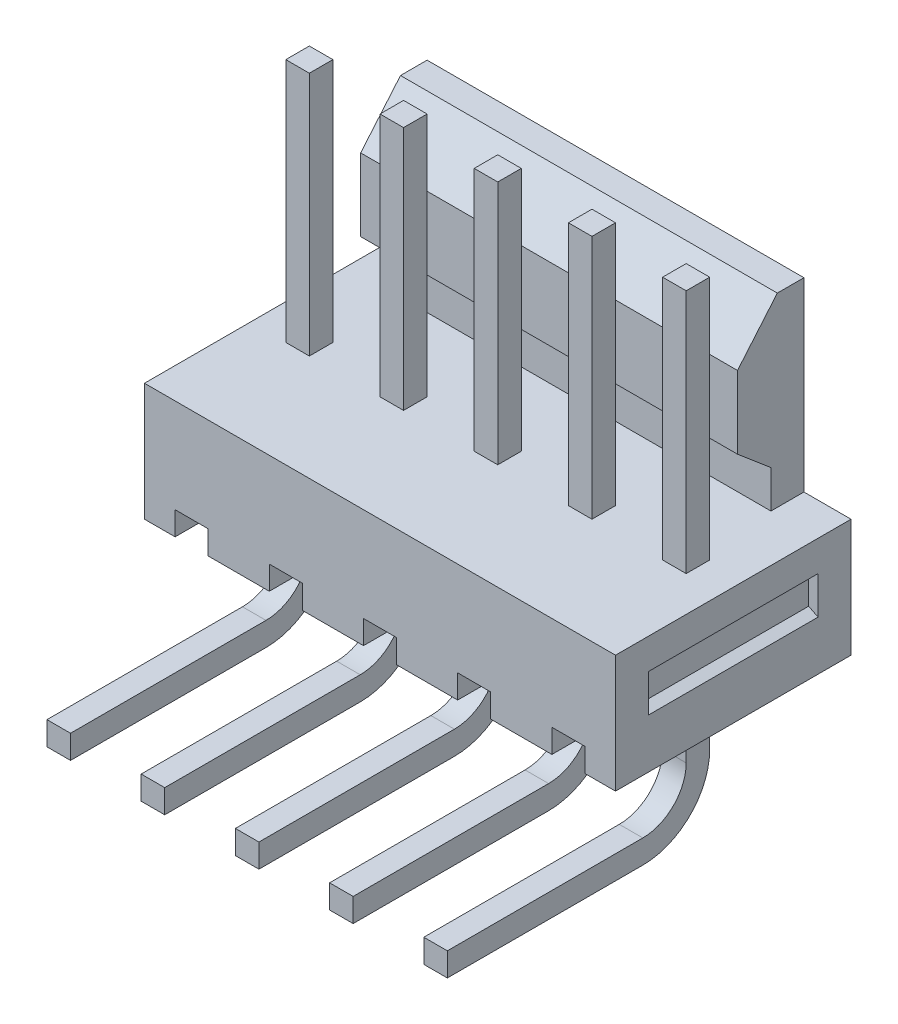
ISO-10303-21;
HEADER;
FILE_DESCRIPTION(('STEP AP214'),'2;1');
FILE_NAME('part.step','',(''),(''),'','','');
FILE_SCHEMA(('AUTOMOTIVE_DESIGN { 1 0 10303 214 1 1 1 1 }'));
ENDSEC;
DATA;
#1=APPLICATION_CONTEXT('core data for automotive mechanical design processes');
#2=APPLICATION_PROTOCOL_DEFINITION('international standard','automotive_design',2000,#1);
#3=PRODUCT_CONTEXT('',#1,'mechanical');
#4=PRODUCT('Part','Part','',(#3));
#5=PRODUCT_RELATED_PRODUCT_CATEGORY('part','',(#4));
#6=PRODUCT_DEFINITION_FORMATION('','',#4);
#7=PRODUCT_DEFINITION_CONTEXT('part definition',#1,'design');
#8=PRODUCT_DEFINITION('design','',#6,#7);
#9=PRODUCT_DEFINITION_SHAPE('','',#8);
#10=(LENGTH_UNIT() NAMED_UNIT(*) SI_UNIT(.MILLI.,.METRE.));
#11=(NAMED_UNIT(*) PLANE_ANGLE_UNIT() SI_UNIT($,.RADIAN.));
#12=(NAMED_UNIT(*) SI_UNIT($,.STERADIAN.) SOLID_ANGLE_UNIT());
#13=UNCERTAINTY_MEASURE_WITH_UNIT(LENGTH_MEASURE(1.E-05),#10,'distance_accuracy_value','');
#14=(GEOMETRIC_REPRESENTATION_CONTEXT(3) GLOBAL_UNCERTAINTY_ASSIGNED_CONTEXT((#13)) GLOBAL_UNIT_ASSIGNED_CONTEXT((#10,
#11,#12)) REPRESENTATION_CONTEXT('',''));
#15=CARTESIAN_POINT('',(0.,0.,0.));
#16=DIRECTION('',(0.,0.,1.));
#17=DIRECTION('',(1.,0.,0.));
#18=AXIS2_PLACEMENT_3D('',#15,#16,#17);
#19=CARTESIAN_POINT('',(-0.3175,-2.8321,1.4859));
#20=DIRECTION('',(1.,0.,0.));
#21=DIRECTION('',(0.,0.,-1.));
#22=AXIS2_PLACEMENT_3D('',#19,#20,#21);
#23=CYLINDRICAL_SURFACE('',#22,1.1684);
#24=CARTESIAN_POINT('',(0.3175,-2.8321,1.4859));
#25=DIRECTION('',(1.,0.,0.));
#26=DIRECTION('',(0.,0.,-1.));
#27=AXIS2_PLACEMENT_3D('',#24,#25,#26);
#28=CIRCLE('',#27,1.1684);
#29=CARTESIAN_POINT('',(0.3175,-2.8321,0.3175));
#30=VERTEX_POINT('',#29);
#31=CARTESIAN_POINT('',(0.3175,-4.0005,1.4859));
#32=VERTEX_POINT('',#31);
#33=EDGE_CURVE('E628',#30,#32,#28,.F.);
#34=ORIENTED_EDGE('',*,*,#33,.F.);
#35=DIRECTION('',(1.,0.,0.));
#36=VECTOR('',#35,1.);
#37=CARTESIAN_POINT('',(-0.3175,-2.8321,0.3175));
#38=LINE('',#37,#36);
#39=CARTESIAN_POINT('',(-0.3175,-2.8321,0.3175));
#40=VERTEX_POINT('',#39);
#41=EDGE_CURVE('E624',#40,#30,#38,.T.);
#42=ORIENTED_EDGE('',*,*,#41,.F.);
#43=CARTESIAN_POINT('',(-0.3175,-2.8321,1.4859));
#44=DIRECTION('',(1.,0.,0.));
#45=DIRECTION('',(0.,0.,-1.));
#46=AXIS2_PLACEMENT_3D('',#43,#44,#45);
#47=CIRCLE('',#46,1.1684);
#48=CARTESIAN_POINT('',(-0.3175,-4.0005,1.4859));
#49=VERTEX_POINT('',#48);
#50=EDGE_CURVE('E20',#40,#49,#47,.F.);
#51=ORIENTED_EDGE('',*,*,#50,.T.);
#52=DIRECTION('',(1.,0.,0.));
#53=VECTOR('',#52,1.);
#54=CARTESIAN_POINT('',(-0.3175,-4.0005,1.4859));
#55=LINE('',#54,#53);
#56=EDGE_CURVE('E633',#32,#49,#55,.F.);
#57=ORIENTED_EDGE('',*,*,#56,.F.);
#58=EDGE_LOOP('',(#34,#42,#51,#57));
#59=FACE_BOUND('',#58,.T.);
#60=ADVANCED_FACE('F17',(#59),#23,.F.);
#61=CARTESIAN_POINT('',(-0.3175,-4.0005,1.4859));
#62=DIRECTION('',(0.,1.,0.));
#63=DIRECTION('',(0.,0.,1.));
#64=AXIS2_PLACEMENT_3D('',#61,#62,#63);
#65=PLANE('',#64);
#66=ORIENTED_EDGE('',*,*,#56,.T.);
#67=DIRECTION('',(0.,0.,-1.));
#68=VECTOR('',#67,1.);
#69=CARTESIAN_POINT('',(-0.3175,-4.0005,3.175));
#70=LINE('',#69,#68);
#71=CARTESIAN_POINT('',(-0.3175,-4.0005,6.7564));
#72=VERTEX_POINT('',#71);
#73=EDGE_CURVE('E644',#49,#72,#70,.F.);
#74=ORIENTED_EDGE('',*,*,#73,.T.);
#75=DIRECTION('',(1.,0.,0.));
#76=VECTOR('',#75,1.);
#77=CARTESIAN_POINT('',(-0.3175,-4.0005,6.7564));
#78=LINE('',#77,#76);
#79=CARTESIAN_POINT('',(0.3175,-4.0005,6.7564));
#80=VERTEX_POINT('',#79);
#81=EDGE_CURVE('E678',#80,#72,#78,.F.);
#82=ORIENTED_EDGE('',*,*,#81,.F.);
#83=DIRECTION('',(0.,0.,-1.));
#84=VECTOR('',#83,1.);
#85=CARTESIAN_POINT('',(0.3175,-4.0005,3.175));
#86=LINE('',#85,#84);
#87=EDGE_CURVE('E685',#32,#80,#86,.F.);
#88=ORIENTED_EDGE('',*,*,#87,.F.);
#89=EDGE_LOOP('',(#66,#74,#82,#88));
#90=FACE_BOUND('',#89,.T.);
#91=ADVANCED_FACE('F784',(#90),#65,.T.);
#92=CARTESIAN_POINT('',(-0.3175,-4.0005,6.7564));
#93=DIRECTION('',(0.,0.,1.));
#94=DIRECTION('',(1.,0.,0.));
#95=AXIS2_PLACEMENT_3D('',#92,#93,#94);
#96=PLANE('',#95);
#97=ORIENTED_EDGE('',*,*,#81,.T.);
#98=DIRECTION('',(0.,1.,0.));
#99=VECTOR('',#98,1.);
#100=CARTESIAN_POINT('',(-0.3175,-0.9525,6.7564));
#101=LINE('',#100,#99);
#102=CARTESIAN_POINT('',(-0.3175,-4.6355,6.7564));
#103=VERTEX_POINT('',#102);
#104=EDGE_CURVE('E693',#72,#103,#101,.F.);
#105=ORIENTED_EDGE('',*,*,#104,.T.);
#106=DIRECTION('',(1.,0.,0.));
#107=VECTOR('',#106,1.);
#108=CARTESIAN_POINT('',(-0.3175,-4.6355,6.7564));
#109=LINE('',#108,#107);
#110=CARTESIAN_POINT('',(0.3175,-4.6355,6.7564));
#111=VERTEX_POINT('',#110);
#112=EDGE_CURVE('E675',#111,#103,#109,.F.);
#113=ORIENTED_EDGE('',*,*,#112,.F.);
#114=DIRECTION('',(0.,1.,0.));
#115=VECTOR('',#114,1.);
#116=CARTESIAN_POINT('',(0.3175,-0.9525,6.7564));
#117=LINE('',#116,#115);
#118=EDGE_CURVE('E681',#80,#111,#117,.F.);
#119=ORIENTED_EDGE('',*,*,#118,.F.);
#120=EDGE_LOOP('',(#97,#105,#113,#119));
#121=FACE_BOUND('',#120,.T.);
#122=ADVANCED_FACE('F788',(#121),#96,.T.);
#123=CARTESIAN_POINT('',(-0.3175,-4.6355,6.7564));
#124=DIRECTION('',(0.,-1.,0.));
#125=DIRECTION('',(0.,0.,-1.));
#126=AXIS2_PLACEMENT_3D('',#123,#124,#125);
#127=PLANE('',#126);
#128=ORIENTED_EDGE('',*,*,#112,.T.);
#129=DIRECTION('',(0.,0.,-1.));
#130=VECTOR('',#129,1.);
#131=CARTESIAN_POINT('',(-0.3175,-4.6355,3.175));
#132=LINE('',#131,#130);
#133=CARTESIAN_POINT('',(-0.3175,-4.6355,1.4859));
#134=VERTEX_POINT('',#133);
#135=EDGE_CURVE('E695',#103,#134,#132,.T.);
#136=ORIENTED_EDGE('',*,*,#135,.T.);
#137=DIRECTION('',(1.,0.,0.));
#138=VECTOR('',#137,1.);
#139=CARTESIAN_POINT('',(-0.3175,-4.6355,1.4859));
#140=LINE('',#139,#138);
#141=CARTESIAN_POINT('',(0.3175,-4.6355,1.4859));
#142=VERTEX_POINT('',#141);
#143=EDGE_CURVE('E669',#142,#134,#140,.F.);
#144=ORIENTED_EDGE('',*,*,#143,.F.);
#145=DIRECTION('',(0.,0.,-1.));
#146=VECTOR('',#145,1.);
#147=CARTESIAN_POINT('',(0.3175,-4.6355,3.175));
#148=LINE('',#147,#146);
#149=EDGE_CURVE('E684',#111,#142,#148,.T.);
#150=ORIENTED_EDGE('',*,*,#149,.F.);
#151=EDGE_LOOP('',(#128,#136,#144,#150));
#152=FACE_BOUND('',#151,.T.);
#153=ADVANCED_FACE('F2508',(#152),#127,.T.);
#154=CARTESIAN_POINT('',(-0.3175,-2.8321,1.4859));
#155=DIRECTION('',(1.,0.,0.));
#156=DIRECTION('',(0.,0.,-1.));
#157=AXIS2_PLACEMENT_3D('',#154,#155,#156);
#158=CYLINDRICAL_SURFACE('',#157,1.8034);
#159=CARTESIAN_POINT('',(0.3175,-2.8321,1.4859));
#160=DIRECTION('',(1.,0.,0.));
#161=DIRECTION('',(0.,0.,-1.));
#162=AXIS2_PLACEMENT_3D('',#159,#160,#161);
#163=CIRCLE('',#162,1.8034);
#164=CARTESIAN_POINT('',(0.3175,-2.8321,-0.3175));
#165=VERTEX_POINT('',#164);
#166=EDGE_CURVE('E768',#142,#165,#163,.T.);
#167=ORIENTED_EDGE('',*,*,#166,.F.);
#168=ORIENTED_EDGE('',*,*,#143,.T.);
#169=CARTESIAN_POINT('',(-0.3175,-2.8321,1.4859));
#170=DIRECTION('',(1.,0.,0.));
#171=DIRECTION('',(0.,0.,-1.));
#172=AXIS2_PLACEMENT_3D('',#169,#170,#171);
#173=CIRCLE('',#172,1.8034);
#174=CARTESIAN_POINT('',(-0.3175,-2.8321,-0.3175));
#175=VERTEX_POINT('',#174);
#176=EDGE_CURVE('E772',#134,#175,#173,.T.);
#177=ORIENTED_EDGE('',*,*,#176,.T.);
#178=DIRECTION('',(-1.,0.,0.));
#179=VECTOR('',#178,1.);
#180=CARTESIAN_POINT('',(-0.3175,-2.8321,-0.3175));
#181=LINE('',#180,#179);
#182=EDGE_CURVE('E666',#165,#175,#181,.T.);
#183=ORIENTED_EDGE('',*,*,#182,.F.);
#184=EDGE_LOOP('',(#167,#168,#177,#183));
#185=FACE_BOUND('',#184,.T.);
#186=ADVANCED_FACE('F797',(#185),#158,.T.);
#187=CARTESIAN_POINT('',(-0.3175,-2.8321,-0.3175));
#188=DIRECTION('',(0.,0.,-1.));
#189=DIRECTION('',(-1.,0.,0.));
#190=AXIS2_PLACEMENT_3D('',#187,#188,#189);
#191=PLANE('',#190);
#192=DIRECTION('',(0.,1.,0.));
#193=VECTOR('',#192,1.);
#194=CARTESIAN_POINT('',(-0.3175,-0.9525,-0.3175));
#195=LINE('',#194,#193);
#196=CARTESIAN_POINT('',(-0.3175,-0.9525,-0.3175));
#197=VERTEX_POINT('',#196);
#198=EDGE_CURVE('E771',#175,#197,#195,.T.);
#199=ORIENTED_EDGE('',*,*,#198,.T.);
#200=DIRECTION('',(-1.,0.,0.));
#201=VECTOR('',#200,1.);
#202=CARTESIAN_POINT('',(-0.3175,-0.9525,-0.3175));
#203=LINE('',#202,#201);
#204=CARTESIAN_POINT('',(0.3175,-0.9525,-0.3175));
#205=VERTEX_POINT('',#204);
#206=EDGE_CURVE('E663',#197,#205,#203,.F.);
#207=ORIENTED_EDGE('',*,*,#206,.T.);
#208=DIRECTION('',(0.,1.,0.));
#209=VECTOR('',#208,1.);
#210=CARTESIAN_POINT('',(0.3175,-0.9525,-0.3175));
#211=LINE('',#210,#209);
#212=EDGE_CURVE('E654',#165,#205,#211,.T.);
#213=ORIENTED_EDGE('',*,*,#212,.F.);
#214=ORIENTED_EDGE('',*,*,#182,.T.);
#215=EDGE_LOOP('',(#199,#207,#213,#214));
#216=FACE_BOUND('',#215,.T.);
#217=ADVANCED_FACE('F792',(#216),#191,.T.);
#218=CARTESIAN_POINT('',(-0.3175,-0.9525,3.175));
#219=DIRECTION('',(1.,0.,0.));
#220=DIRECTION('',(0.,0.,-1.));
#221=AXIS2_PLACEMENT_3D('',#218,#219,#220);
#222=PLANE('',#221);
#223=ORIENTED_EDGE('',*,*,#176,.F.);
#224=ORIENTED_EDGE('',*,*,#135,.F.);
#225=ORIENTED_EDGE('',*,*,#104,.F.);
#226=ORIENTED_EDGE('',*,*,#73,.F.);
#227=ORIENTED_EDGE('',*,*,#50,.F.);
#228=DIRECTION('',(0.,1.,0.));
#229=VECTOR('',#228,1.);
#230=CARTESIAN_POINT('',(-0.3175,-0.9525,0.3175));
#231=LINE('',#230,#229);
#232=CARTESIAN_POINT('',(-0.3175,-0.9525,0.3175));
#233=VERTEX_POINT('',#232);
#234=EDGE_CURVE('E641',#233,#40,#231,.F.);
#235=ORIENTED_EDGE('',*,*,#234,.F.);
#236=DIRECTION('',(0.,0.,-1.));
#237=VECTOR('',#236,1.);
#238=CARTESIAN_POINT('',(-0.3175,-0.9525,3.175));
#239=LINE('',#238,#237);
#240=EDGE_CURVE('E645',#197,#233,#239,.F.);
#241=ORIENTED_EDGE('',*,*,#240,.F.);
#242=ORIENTED_EDGE('',*,*,#198,.F.);
#243=EDGE_LOOP('',(#223,#224,#225,#226,#227,#235,#241,#242));
#244=FACE_BOUND('',#243,.T.);
#245=ADVANCED_FACE('F639',(#244),#222,.F.);
#246=CARTESIAN_POINT('',(0.3175,-0.9525,3.175));
#247=DIRECTION('',(1.,0.,0.));
#248=DIRECTION('',(0.,0.,-1.));
#249=AXIS2_PLACEMENT_3D('',#246,#247,#248);
#250=PLANE('',#249);
#251=ORIENTED_EDGE('',*,*,#212,.T.);
#252=DIRECTION('',(0.,0.,-1.));
#253=VECTOR('',#252,1.);
#254=CARTESIAN_POINT('',(0.3175,-0.9525,3.175));
#255=LINE('',#254,#253);
#256=CARTESIAN_POINT('',(0.3175,-0.9525,0.3175));
#257=VERTEX_POINT('',#256);
#258=EDGE_CURVE('E650',#205,#257,#255,.F.);
#259=ORIENTED_EDGE('',*,*,#258,.T.);
#260=DIRECTION('',(0.,1.,0.));
#261=VECTOR('',#260,1.);
#262=CARTESIAN_POINT('',(0.3175,-0.9525,0.3175));
#263=LINE('',#262,#261);
#264=EDGE_CURVE('E649',#30,#257,#263,.T.);
#265=ORIENTED_EDGE('',*,*,#264,.F.);
#266=ORIENTED_EDGE('',*,*,#33,.T.);
#267=ORIENTED_EDGE('',*,*,#87,.T.);
#268=ORIENTED_EDGE('',*,*,#118,.T.);
#269=ORIENTED_EDGE('',*,*,#149,.T.);
#270=ORIENTED_EDGE('',*,*,#166,.T.);
#271=EDGE_LOOP('',(#251,#259,#265,#266,#267,#268,#269,#270));
#272=FACE_BOUND('',#271,.T.);
#273=ADVANCED_FACE('F801',(#272),#250,.T.);
#274=CARTESIAN_POINT('',(-0.3175,-0.9525,0.3175));
#275=DIRECTION('',(0.,0.,1.));
#276=DIRECTION('',(1.,0.,0.));
#277=AXIS2_PLACEMENT_3D('',#274,#275,#276);
#278=PLANE('',#277);
#279=ORIENTED_EDGE('',*,*,#264,.T.);
#280=DIRECTION('',(1.,0.,0.));
#281=VECTOR('',#280,1.);
#282=CARTESIAN_POINT('',(0.4445,-0.9525,0.3175));
#283=LINE('',#282,#281);
#284=EDGE_CURVE('E648',#257,#233,#283,.F.);
#285=ORIENTED_EDGE('',*,*,#284,.T.);
#286=ORIENTED_EDGE('',*,*,#234,.T.);
#287=ORIENTED_EDGE('',*,*,#41,.T.);
#288=EDGE_LOOP('',(#279,#285,#286,#287));
#289=FACE_BOUND('',#288,.T.);
#290=ADVANCED_FACE('F646',(#289),#278,.T.);
#291=CARTESIAN_POINT('',(0.4445,-0.9525,3.175));
#292=DIRECTION('',(0.,1.,0.));
#293=DIRECTION('',(0.,0.,1.));
#294=AXIS2_PLACEMENT_3D('',#291,#292,#293);
#295=PLANE('',#294);
#296=ORIENTED_EDGE('',*,*,#258,.F.);
#297=ORIENTED_EDGE('',*,*,#206,.F.);
#298=ORIENTED_EDGE('',*,*,#240,.T.);
#299=ORIENTED_EDGE('',*,*,#284,.F.);
#300=EDGE_LOOP('',(#296,#297,#298,#299));
#301=FACE_BOUND('',#300,.T.);
#302=DIRECTION('',(1.,0.,0.));
#303=VECTOR('',#302,1.);
#304=CARTESIAN_POINT('',(0.4445,-0.9525,3.175));
#305=LINE('',#304,#303);
#306=CARTESIAN_POINT('',(-0.4445,-0.9525,3.175));
#307=VERTEX_POINT('',#306);
#308=CARTESIAN_POINT('',(0.4445,-0.9525,3.175));
#309=VERTEX_POINT('',#308);
#310=EDGE_CURVE('E818',#307,#309,#305,.T.);
#311=ORIENTED_EDGE('',*,*,#310,.F.);
#312=DIRECTION('',(0.,0.,1.));
#313=VECTOR('',#312,1.);
#314=CARTESIAN_POINT('',(-0.4445,-0.9525,3.175));
#315=LINE('',#314,#313);
#316=CARTESIAN_POINT('',(-0.4445,-0.9525,-3.175));
#317=VERTEX_POINT('',#316);
#318=EDGE_CURVE('E820',#307,#317,#315,.F.);
#319=ORIENTED_EDGE('',*,*,#318,.T.);
#320=DIRECTION('',(1.,0.,0.));
#321=VECTOR('',#320,1.);
#322=CARTESIAN_POINT('',(0.4445,-0.9525,-3.175));
#323=LINE('',#322,#321);
#324=CARTESIAN_POINT('',(0.4445,-0.9525,-3.175));
#325=VERTEX_POINT('',#324);
#326=EDGE_CURVE('E652',#325,#317,#323,.F.);
#327=ORIENTED_EDGE('',*,*,#326,.F.);
#328=DIRECTION('',(0.,0.,-1.));
#329=VECTOR('',#328,1.);
#330=CARTESIAN_POINT('',(0.4445,-0.9525,3.175));
#331=LINE('',#330,#329);
#332=EDGE_CURVE('E839',#325,#309,#331,.F.);
#333=ORIENTED_EDGE('',*,*,#332,.T.);
#334=EDGE_LOOP('',(#311,#319,#327,#333));
#335=FACE_BOUND('',#334,.T.);
#336=ADVANCED_FACE('F829',(#301,#335),#295,.F.);
#337=CARTESIAN_POINT('',(-0.4445,-0.9525,3.175));
#338=DIRECTION('',(-1.,0.,0.));
#339=DIRECTION('',(0.,0.,1.));
#340=AXIS2_PLACEMENT_3D('',#337,#338,#339);
#341=PLANE('',#340);
#342=ORIENTED_EDGE('',*,*,#318,.F.);
#343=DIRECTION('',(0.,1.,0.));
#344=VECTOR('',#343,1.);
#345=CARTESIAN_POINT('',(-0.4445,-0.9525,3.175));
#346=LINE('',#345,#344);
#347=CARTESIAN_POINT('',(-0.4445,-1.5875,3.175));
#348=VERTEX_POINT('',#347);
#349=EDGE_CURVE('E817',#348,#307,#346,.T.);
#350=ORIENTED_EDGE('',*,*,#349,.F.);
#351=DIRECTION('',(0.,0.,-1.));
#352=VECTOR('',#351,1.);
#353=CARTESIAN_POINT('',(-0.4445,-1.5875,3.175));
#354=LINE('',#353,#352);
#355=CARTESIAN_POINT('',(-0.4445,-1.5875,-3.175));
#356=VERTEX_POINT('',#355);
#357=EDGE_CURVE('E926',#356,#348,#354,.F.);
#358=ORIENTED_EDGE('',*,*,#357,.F.);
#359=DIRECTION('',(0.,1.,0.));
#360=VECTOR('',#359,1.);
#361=CARTESIAN_POINT('',(-0.4445,-0.9525,-3.175));
#362=LINE('',#361,#360);
#363=EDGE_CURVE('E845',#317,#356,#362,.F.);
#364=ORIENTED_EDGE('',*,*,#363,.F.);
#365=EDGE_LOOP('',(#342,#350,#358,#364));
#366=FACE_BOUND('',#365,.T.);
#367=ADVANCED_FACE('F832',(#366),#341,.F.);
#368=CARTESIAN_POINT('',(-2.8575,-2.8321,1.4859));
#369=DIRECTION('',(1.,0.,0.));
#370=DIRECTION('',(0.,0.,-1.));
#371=AXIS2_PLACEMENT_3D('',#368,#369,#370);
#372=CYLINDRICAL_SURFACE('',#371,1.1684);
#373=CARTESIAN_POINT('',(-2.2225,-2.8321,1.4859));
#374=DIRECTION('',(1.,0.,0.));
#375=DIRECTION('',(0.,0.,-1.));
#376=AXIS2_PLACEMENT_3D('',#373,#374,#375);
#377=CIRCLE('',#376,1.1684);
#378=CARTESIAN_POINT('',(-2.2225,-2.8321,0.3175));
#379=VERTEX_POINT('',#378);
#380=CARTESIAN_POINT('',(-2.2225,-4.0005,1.4859));
#381=VERTEX_POINT('',#380);
#382=EDGE_CURVE('E756',#379,#381,#377,.F.);
#383=ORIENTED_EDGE('',*,*,#382,.F.);
#384=DIRECTION('',(1.,0.,0.));
#385=VECTOR('',#384,1.);
#386=CARTESIAN_POINT('',(-2.8575,-2.8321,0.3175));
#387=LINE('',#386,#385);
#388=CARTESIAN_POINT('',(-2.8575,-2.8321,0.3175));
#389=VERTEX_POINT('',#388);
#390=EDGE_CURVE('E846',#389,#379,#387,.T.);
#391=ORIENTED_EDGE('',*,*,#390,.F.);
#392=CARTESIAN_POINT('',(-2.8575,-2.8321,1.4859));
#393=DIRECTION('',(1.,0.,0.));
#394=DIRECTION('',(0.,0.,-1.));
#395=AXIS2_PLACEMENT_3D('',#392,#393,#394);
#396=CIRCLE('',#395,1.1684);
#397=CARTESIAN_POINT('',(-2.8575,-4.0005,1.4859));
#398=VERTEX_POINT('',#397);
#399=EDGE_CURVE('E764',#389,#398,#396,.F.);
#400=ORIENTED_EDGE('',*,*,#399,.T.);
#401=DIRECTION('',(1.,0.,0.));
#402=VECTOR('',#401,1.);
#403=CARTESIAN_POINT('',(-2.8575,-4.0005,1.4859));
#404=LINE('',#403,#402);
#405=EDGE_CURVE('E854',#381,#398,#404,.F.);
#406=ORIENTED_EDGE('',*,*,#405,.F.);
#407=EDGE_LOOP('',(#383,#391,#400,#406));
#408=FACE_BOUND('',#407,.T.);
#409=ADVANCED_FACE('F2459',(#408),#372,.F.);
#410=CARTESIAN_POINT('',(-2.8575,-4.0005,1.4859));
#411=DIRECTION('',(0.,1.,0.));
#412=DIRECTION('',(0.,0.,1.));
#413=AXIS2_PLACEMENT_3D('',#410,#411,#412);
#414=PLANE('',#413);
#415=ORIENTED_EDGE('',*,*,#405,.T.);
#416=DIRECTION('',(0.,0.,-1.));
#417=VECTOR('',#416,1.);
#418=CARTESIAN_POINT('',(-2.8575,-4.0005,3.175));
#419=LINE('',#418,#417);
#420=CARTESIAN_POINT('',(-2.8575,-4.0005,6.7564));
#421=VERTEX_POINT('',#420);
#422=EDGE_CURVE('E766',#398,#421,#419,.F.);
#423=ORIENTED_EDGE('',*,*,#422,.T.);
#424=DIRECTION('',(1.,0.,0.));
#425=VECTOR('',#424,1.);
#426=CARTESIAN_POINT('',(-2.8575,-4.0005,6.7564));
#427=LINE('',#426,#425);
#428=CARTESIAN_POINT('',(-2.2225,-4.0005,6.7564));
#429=VERTEX_POINT('',#428);
#430=EDGE_CURVE('E857',#429,#421,#427,.F.);
#431=ORIENTED_EDGE('',*,*,#430,.F.);
#432=DIRECTION('',(0.,0.,-1.));
#433=VECTOR('',#432,1.);
#434=CARTESIAN_POINT('',(-2.2225,-4.0005,3.175));
#435=LINE('',#434,#433);
#436=EDGE_CURVE('E759',#381,#429,#435,.F.);
#437=ORIENTED_EDGE('',*,*,#436,.F.);
#438=EDGE_LOOP('',(#415,#423,#431,#437));
#439=FACE_BOUND('',#438,.T.);
#440=ADVANCED_FACE('F2451',(#439),#414,.T.);
#441=CARTESIAN_POINT('',(-2.8575,-4.0005,6.7564));
#442=DIRECTION('',(0.,0.,1.));
#443=DIRECTION('',(1.,0.,0.));
#444=AXIS2_PLACEMENT_3D('',#441,#442,#443);
#445=PLANE('',#444);
#446=ORIENTED_EDGE('',*,*,#430,.T.);
#447=DIRECTION('',(0.,1.,0.));
#448=VECTOR('',#447,1.);
#449=CARTESIAN_POINT('',(-2.8575,-0.9525,6.7564));
#450=LINE('',#449,#448);
#451=CARTESIAN_POINT('',(-2.8575,-4.6355,6.7564));
#452=VERTEX_POINT('',#451);
#453=EDGE_CURVE('E851',#421,#452,#450,.F.);
#454=ORIENTED_EDGE('',*,*,#453,.T.);
#455=DIRECTION('',(1.,0.,0.));
#456=VECTOR('',#455,1.);
#457=CARTESIAN_POINT('',(-2.8575,-4.6355,6.7564));
#458=LINE('',#457,#456);
#459=CARTESIAN_POINT('',(-2.2225,-4.6355,6.7564));
#460=VERTEX_POINT('',#459);
#461=EDGE_CURVE('E862',#460,#452,#458,.F.);
#462=ORIENTED_EDGE('',*,*,#461,.F.);
#463=DIRECTION('',(0.,1.,0.));
#464=VECTOR('',#463,1.);
#465=CARTESIAN_POINT('',(-2.2225,-0.9525,6.7564));
#466=LINE('',#465,#464);
#467=EDGE_CURVE('E865',#429,#460,#466,.F.);
#468=ORIENTED_EDGE('',*,*,#467,.F.);
#469=EDGE_LOOP('',(#446,#454,#462,#468));
#470=FACE_BOUND('',#469,.T.);
#471=ADVANCED_FACE('F2443',(#470),#445,.T.);
#472=CARTESIAN_POINT('',(-2.8575,-4.6355,6.7564));
#473=DIRECTION('',(0.,-1.,0.));
#474=DIRECTION('',(0.,0.,-1.));
#475=AXIS2_PLACEMENT_3D('',#472,#473,#474);
#476=PLANE('',#475);
#477=ORIENTED_EDGE('',*,*,#461,.T.);
#478=DIRECTION('',(0.,0.,-1.));
#479=VECTOR('',#478,1.);
#480=CARTESIAN_POINT('',(-2.8575,-4.6355,3.175));
#481=LINE('',#480,#479);
#482=CARTESIAN_POINT('',(-2.8575,-4.6355,1.4859));
#483=VERTEX_POINT('',#482);
#484=EDGE_CURVE('E763',#452,#483,#481,.T.);
#485=ORIENTED_EDGE('',*,*,#484,.T.);
#486=DIRECTION('',(1.,0.,0.));
#487=VECTOR('',#486,1.);
#488=CARTESIAN_POINT('',(-2.8575,-4.6355,1.4859));
#489=LINE('',#488,#487);
#490=CARTESIAN_POINT('',(-2.2225,-4.6355,1.4859));
#491=VERTEX_POINT('',#490);
#492=EDGE_CURVE('E872',#491,#483,#489,.F.);
#493=ORIENTED_EDGE('',*,*,#492,.F.);
#494=DIRECTION('',(0.,0.,-1.));
#495=VECTOR('',#494,1.);
#496=CARTESIAN_POINT('',(-2.2225,-4.6355,3.175));
#497=LINE('',#496,#495);
#498=EDGE_CURVE('E755',#460,#491,#497,.T.);
#499=ORIENTED_EDGE('',*,*,#498,.F.);
#500=EDGE_LOOP('',(#477,#485,#493,#499));
#501=FACE_BOUND('',#500,.T.);
#502=ADVANCED_FACE('F2435',(#501),#476,.T.);
#503=CARTESIAN_POINT('',(-2.8575,-2.8321,1.4859));
#504=DIRECTION('',(1.,0.,0.));
#505=DIRECTION('',(0.,0.,-1.));
#506=AXIS2_PLACEMENT_3D('',#503,#504,#505);
#507=CYLINDRICAL_SURFACE('',#506,1.8034);
#508=CARTESIAN_POINT('',(-2.2225,-2.8321,1.4859));
#509=DIRECTION('',(1.,0.,0.));
#510=DIRECTION('',(0.,0.,-1.));
#511=AXIS2_PLACEMENT_3D('',#508,#509,#510);
#512=CIRCLE('',#511,1.8034);
#513=CARTESIAN_POINT('',(-2.2225,-2.8321,-0.3175));
#514=VERTEX_POINT('',#513);
#515=EDGE_CURVE('E751',#491,#514,#512,.T.);
#516=ORIENTED_EDGE('',*,*,#515,.F.);
#517=ORIENTED_EDGE('',*,*,#492,.T.);
#518=CARTESIAN_POINT('',(-2.8575,-2.8321,1.4859));
#519=DIRECTION('',(1.,0.,0.));
#520=DIRECTION('',(0.,0.,-1.));
#521=AXIS2_PLACEMENT_3D('',#518,#519,#520);
#522=CIRCLE('',#521,1.8034);
#523=CARTESIAN_POINT('',(-2.8575,-2.8321,-0.3175));
#524=VERTEX_POINT('',#523);
#525=EDGE_CURVE('E761',#483,#524,#522,.T.);
#526=ORIENTED_EDGE('',*,*,#525,.T.);
#527=DIRECTION('',(-1.,0.,0.));
#528=VECTOR('',#527,1.);
#529=CARTESIAN_POINT('',(-2.8575,-2.8321,-0.3175));
#530=LINE('',#529,#528);
#531=EDGE_CURVE('E875',#514,#524,#530,.T.);
#532=ORIENTED_EDGE('',*,*,#531,.F.);
#533=EDGE_LOOP('',(#516,#517,#526,#532));
#534=FACE_BOUND('',#533,.T.);
#535=ADVANCED_FACE('F1668',(#534),#507,.T.);
#536=CARTESIAN_POINT('',(-2.8575,-2.8321,-0.3175));
#537=DIRECTION('',(0.,0.,-1.));
#538=DIRECTION('',(-1.,0.,0.));
#539=AXIS2_PLACEMENT_3D('',#536,#537,#538);
#540=PLANE('',#539);
#541=DIRECTION('',(0.,1.,0.));
#542=VECTOR('',#541,1.);
#543=CARTESIAN_POINT('',(-2.8575,-0.9525,-0.3175));
#544=LINE('',#543,#542);
#545=CARTESIAN_POINT('',(-2.8575,-0.9525,-0.3175));
#546=VERTEX_POINT('',#545);
#547=EDGE_CURVE('E760',#524,#546,#544,.T.);
#548=ORIENTED_EDGE('',*,*,#547,.T.);
#549=DIRECTION('',(-1.,0.,0.));
#550=VECTOR('',#549,1.);
#551=CARTESIAN_POINT('',(-2.8575,-0.9525,-0.3175));
#552=LINE('',#551,#550);
#553=CARTESIAN_POINT('',(-2.2225,-0.9525,-0.3175));
#554=VERTEX_POINT('',#553);
#555=EDGE_CURVE('E878',#546,#554,#552,.F.);
#556=ORIENTED_EDGE('',*,*,#555,.T.);
#557=DIRECTION('',(0.,1.,0.));
#558=VECTOR('',#557,1.);
#559=CARTESIAN_POINT('',(-2.2225,-0.9525,-0.3175));
#560=LINE('',#559,#558);
#561=EDGE_CURVE('E754',#514,#554,#560,.T.);
#562=ORIENTED_EDGE('',*,*,#561,.F.);
#563=ORIENTED_EDGE('',*,*,#531,.T.);
#564=EDGE_LOOP('',(#548,#556,#562,#563));
#565=FACE_BOUND('',#564,.T.);
#566=ADVANCED_FACE('F1658',(#565),#540,.T.);
#567=CARTESIAN_POINT('',(0.4445,-1.5875,3.175));
#568=DIRECTION('',(1.,0.,0.));
#569=DIRECTION('',(0.,0.,-1.));
#570=AXIS2_PLACEMENT_3D('',#567,#568,#569);
#571=PLANE('',#570);
#572=ORIENTED_EDGE('',*,*,#332,.F.);
#573=DIRECTION('',(0.,1.,0.));
#574=VECTOR('',#573,1.);
#575=CARTESIAN_POINT('',(0.4445,-1.5875,-3.175));
#576=LINE('',#575,#574);
#577=CARTESIAN_POINT('',(0.4445,-1.5875,-3.175));
#578=VERTEX_POINT('',#577);
#579=EDGE_CURVE('E880',#578,#325,#576,.T.);
#580=ORIENTED_EDGE('',*,*,#579,.F.);
#581=DIRECTION('',(0.,0.,-1.));
#582=VECTOR('',#581,1.);
#583=CARTESIAN_POINT('',(0.4445,-1.5875,3.175));
#584=LINE('',#583,#582);
#585=CARTESIAN_POINT('',(0.4445,-1.5875,3.175));
#586=VERTEX_POINT('',#585);
#587=EDGE_CURVE('E979',#586,#578,#584,.T.);
#588=ORIENTED_EDGE('',*,*,#587,.F.);
#589=DIRECTION('',(0.,1.,0.));
#590=VECTOR('',#589,1.);
#591=CARTESIAN_POINT('',(0.4445,-1.5875,3.175));
#592=LINE('',#591,#590);
#593=EDGE_CURVE('E885',#309,#586,#592,.F.);
#594=ORIENTED_EDGE('',*,*,#593,.F.);
#595=EDGE_LOOP('',(#572,#580,#588,#594));
#596=FACE_BOUND('',#595,.T.);
#597=ADVANCED_FACE('F1655',(#596),#571,.F.);
#598=CARTESIAN_POINT('',(2.2225,-2.8321,1.4859));
#599=DIRECTION('',(1.,0.,0.));
#600=DIRECTION('',(0.,0.,-1.));
#601=AXIS2_PLACEMENT_3D('',#598,#599,#600);
#602=CYLINDRICAL_SURFACE('',#601,1.1684);
#603=CARTESIAN_POINT('',(2.8575,-2.8321,1.4859));
#604=DIRECTION('',(1.,0.,0.));
#605=DIRECTION('',(0.,0.,-1.));
#606=AXIS2_PLACEMENT_3D('',#603,#604,#605);
#607=CIRCLE('',#606,1.1684);
#608=CARTESIAN_POINT('',(2.8575,-2.8321,0.3175));
#609=VERTEX_POINT('',#608);
#610=CARTESIAN_POINT('',(2.8575,-4.0005,1.4859));
#611=VERTEX_POINT('',#610);
#612=EDGE_CURVE('E739',#609,#611,#607,.F.);
#613=ORIENTED_EDGE('',*,*,#612,.F.);
#614=DIRECTION('',(1.,0.,0.));
#615=VECTOR('',#614,1.);
#616=CARTESIAN_POINT('',(2.2225,-2.8321,0.3175));
#617=LINE('',#616,#615);
#618=CARTESIAN_POINT('',(2.2225,-2.8321,0.3175));
#619=VERTEX_POINT('',#618);
#620=EDGE_CURVE('E887',#619,#609,#617,.T.);
#621=ORIENTED_EDGE('',*,*,#620,.F.);
#622=CARTESIAN_POINT('',(2.2225,-2.8321,1.4859));
#623=DIRECTION('',(1.,0.,0.));
#624=DIRECTION('',(0.,0.,-1.));
#625=AXIS2_PLACEMENT_3D('',#622,#623,#624);
#626=CIRCLE('',#625,1.1684);
#627=CARTESIAN_POINT('',(2.2225,-4.0005,1.4859));
#628=VERTEX_POINT('',#627);
#629=EDGE_CURVE('E747',#619,#628,#626,.F.);
#630=ORIENTED_EDGE('',*,*,#629,.T.);
#631=DIRECTION('',(1.,0.,0.));
#632=VECTOR('',#631,1.);
#633=CARTESIAN_POINT('',(2.2225,-4.0005,1.4859));
#634=LINE('',#633,#632);
#635=EDGE_CURVE('E893',#611,#628,#634,.F.);
#636=ORIENTED_EDGE('',*,*,#635,.F.);
#637=EDGE_LOOP('',(#613,#621,#630,#636));
#638=FACE_BOUND('',#637,.T.);
#639=ADVANCED_FACE('F1657',(#638),#602,.F.);
#640=CARTESIAN_POINT('',(2.2225,-4.0005,1.4859));
#641=DIRECTION('',(0.,1.,0.));
#642=DIRECTION('',(0.,0.,1.));
#643=AXIS2_PLACEMENT_3D('',#640,#641,#642);
#644=PLANE('',#643);
#645=ORIENTED_EDGE('',*,*,#635,.T.);
#646=DIRECTION('',(0.,0.,-1.));
#647=VECTOR('',#646,1.);
#648=CARTESIAN_POINT('',(2.2225,-4.0005,3.175));
#649=LINE('',#648,#647);
#650=CARTESIAN_POINT('',(2.2225,-4.0005,6.7564));
#651=VERTEX_POINT('',#650);
#652=EDGE_CURVE('E749',#628,#651,#649,.F.);
#653=ORIENTED_EDGE('',*,*,#652,.T.);
#654=DIRECTION('',(1.,0.,0.));
#655=VECTOR('',#654,1.);
#656=CARTESIAN_POINT('',(2.2225,-4.0005,6.7564));
#657=LINE('',#656,#655);
#658=CARTESIAN_POINT('',(2.8575,-4.0005,6.7564));
#659=VERTEX_POINT('',#658);
#660=EDGE_CURVE('E896',#659,#651,#657,.F.);
#661=ORIENTED_EDGE('',*,*,#660,.F.);
#662=DIRECTION('',(0.,0.,-1.));
#663=VECTOR('',#662,1.);
#664=CARTESIAN_POINT('',(2.8575,-4.0005,3.175));
#665=LINE('',#664,#663);
#666=EDGE_CURVE('E742',#611,#659,#665,.F.);
#667=ORIENTED_EDGE('',*,*,#666,.F.);
#668=EDGE_LOOP('',(#645,#653,#661,#667));
#669=FACE_BOUND('',#668,.T.);
#670=ADVANCED_FACE('F1665',(#669),#644,.T.);
#671=CARTESIAN_POINT('',(2.2225,-4.0005,6.7564));
#672=DIRECTION('',(0.,0.,1.));
#673=DIRECTION('',(1.,0.,0.));
#674=AXIS2_PLACEMENT_3D('',#671,#672,#673);
#675=PLANE('',#674);
#676=ORIENTED_EDGE('',*,*,#660,.T.);
#677=DIRECTION('',(0.,1.,0.));
#678=VECTOR('',#677,1.);
#679=CARTESIAN_POINT('',(2.2225,-0.9525,6.7564));
#680=LINE('',#679,#678);
#681=CARTESIAN_POINT('',(2.2225,-4.6355,6.7564));
#682=VERTEX_POINT('',#681);
#683=EDGE_CURVE('E890',#651,#682,#680,.F.);
#684=ORIENTED_EDGE('',*,*,#683,.T.);
#685=DIRECTION('',(1.,0.,0.));
#686=VECTOR('',#685,1.);
#687=CARTESIAN_POINT('',(2.2225,-4.6355,6.7564));
#688=LINE('',#687,#686);
#689=CARTESIAN_POINT('',(2.8575,-4.6355,6.7564));
#690=VERTEX_POINT('',#689);
#691=EDGE_CURVE('E901',#690,#682,#688,.F.);
#692=ORIENTED_EDGE('',*,*,#691,.F.);
#693=DIRECTION('',(0.,1.,0.));
#694=VECTOR('',#693,1.);
#695=CARTESIAN_POINT('',(2.8575,-0.9525,6.7564));
#696=LINE('',#695,#694);
#697=EDGE_CURVE('E904',#659,#690,#696,.F.);
#698=ORIENTED_EDGE('',*,*,#697,.F.);
#699=EDGE_LOOP('',(#676,#684,#692,#698));
#700=FACE_BOUND('',#699,.T.);
#701=ADVANCED_FACE('F2017',(#700),#675,.T.);
#702=CARTESIAN_POINT('',(2.2225,-4.6355,6.7564));
#703=DIRECTION('',(0.,-1.,0.));
#704=DIRECTION('',(0.,0.,-1.));
#705=AXIS2_PLACEMENT_3D('',#702,#703,#704);
#706=PLANE('',#705);
#707=ORIENTED_EDGE('',*,*,#691,.T.);
#708=DIRECTION('',(0.,0.,-1.));
#709=VECTOR('',#708,1.);
#710=CARTESIAN_POINT('',(2.2225,-4.6355,3.175));
#711=LINE('',#710,#709);
#712=CARTESIAN_POINT('',(2.2225,-4.6355,1.4859));
#713=VERTEX_POINT('',#712);
#714=EDGE_CURVE('E746',#682,#713,#711,.T.);
#715=ORIENTED_EDGE('',*,*,#714,.T.);
#716=DIRECTION('',(1.,0.,0.));
#717=VECTOR('',#716,1.);
#718=CARTESIAN_POINT('',(2.2225,-4.6355,1.4859));
#719=LINE('',#718,#717);
#720=CARTESIAN_POINT('',(2.8575,-4.6355,1.4859));
#721=VERTEX_POINT('',#720);
#722=EDGE_CURVE('E911',#721,#713,#719,.F.);
#723=ORIENTED_EDGE('',*,*,#722,.F.);
#724=DIRECTION('',(0.,0.,-1.));
#725=VECTOR('',#724,1.);
#726=CARTESIAN_POINT('',(2.8575,-4.6355,3.175));
#727=LINE('',#726,#725);
#728=EDGE_CURVE('E738',#690,#721,#727,.T.);
#729=ORIENTED_EDGE('',*,*,#728,.F.);
#730=EDGE_LOOP('',(#707,#715,#723,#729));
#731=FACE_BOUND('',#730,.T.);
#732=ADVANCED_FACE('F2013',(#731),#706,.T.);
#733=CARTESIAN_POINT('',(2.2225,-2.8321,1.4859));
#734=DIRECTION('',(1.,0.,0.));
#735=DIRECTION('',(0.,0.,-1.));
#736=AXIS2_PLACEMENT_3D('',#733,#734,#735);
#737=CYLINDRICAL_SURFACE('',#736,1.8034);
#738=CARTESIAN_POINT('',(2.8575,-2.8321,1.4859));
#739=DIRECTION('',(1.,0.,0.));
#740=DIRECTION('',(0.,0.,-1.));
#741=AXIS2_PLACEMENT_3D('',#738,#739,#740);
#742=CIRCLE('',#741,1.8034);
#743=CARTESIAN_POINT('',(2.8575,-2.8321,-0.3175));
#744=VERTEX_POINT('',#743);
#745=EDGE_CURVE('E734',#721,#744,#742,.T.);
#746=ORIENTED_EDGE('',*,*,#745,.F.);
#747=ORIENTED_EDGE('',*,*,#722,.T.);
#748=CARTESIAN_POINT('',(2.2225,-2.8321,1.4859));
#749=DIRECTION('',(1.,0.,0.));
#750=DIRECTION('',(0.,0.,-1.));
#751=AXIS2_PLACEMENT_3D('',#748,#749,#750);
#752=CIRCLE('',#751,1.8034);
#753=CARTESIAN_POINT('',(2.2225,-2.8321,-0.3175));
#754=VERTEX_POINT('',#753);
#755=EDGE_CURVE('E744',#713,#754,#752,.T.);
#756=ORIENTED_EDGE('',*,*,#755,.T.);
#757=DIRECTION('',(-1.,0.,0.));
#758=VECTOR('',#757,1.);
#759=CARTESIAN_POINT('',(2.2225,-2.8321,-0.3175));
#760=LINE('',#759,#758);
#761=EDGE_CURVE('E914',#744,#754,#760,.T.);
#762=ORIENTED_EDGE('',*,*,#761,.F.);
#763=EDGE_LOOP('',(#746,#747,#756,#762));
#764=FACE_BOUND('',#763,.T.);
#765=ADVANCED_FACE('F2009',(#764),#737,.T.);
#766=CARTESIAN_POINT('',(2.2225,-2.8321,-0.3175));
#767=DIRECTION('',(0.,0.,-1.));
#768=DIRECTION('',(-1.,0.,0.));
#769=AXIS2_PLACEMENT_3D('',#766,#767,#768);
#770=PLANE('',#769);
#771=DIRECTION('',(0.,1.,0.));
#772=VECTOR('',#771,1.);
#773=CARTESIAN_POINT('',(2.2225,-0.9525,-0.3175));
#774=LINE('',#773,#772);
#775=CARTESIAN_POINT('',(2.2225,-0.9525,-0.3175));
#776=VERTEX_POINT('',#775);
#777=EDGE_CURVE('E743',#754,#776,#774,.T.);
#778=ORIENTED_EDGE('',*,*,#777,.T.);
#779=DIRECTION('',(-1.,0.,0.));
#780=VECTOR('',#779,1.);
#781=CARTESIAN_POINT('',(2.2225,-0.9525,-0.3175));
#782=LINE('',#781,#780);
#783=CARTESIAN_POINT('',(2.8575,-0.9525,-0.3175));
#784=VERTEX_POINT('',#783);
#785=EDGE_CURVE('E917',#776,#784,#782,.F.);
#786=ORIENTED_EDGE('',*,*,#785,.T.);
#787=DIRECTION('',(0.,1.,0.));
#788=VECTOR('',#787,1.);
#789=CARTESIAN_POINT('',(2.8575,-0.9525,-0.3175));
#790=LINE('',#789,#788);
#791=EDGE_CURVE('E737',#744,#784,#790,.T.);
#792=ORIENTED_EDGE('',*,*,#791,.F.);
#793=ORIENTED_EDGE('',*,*,#761,.T.);
#794=EDGE_LOOP('',(#778,#786,#792,#793));
#795=FACE_BOUND('',#794,.T.);
#796=ADVANCED_FACE('F2005',(#795),#770,.T.);
#797=CARTESIAN_POINT('',(-6.35,-1.5875,3.175));
#798=DIRECTION('',(0.,-1.,0.));
#799=DIRECTION('',(0.,0.,-1.));
#800=AXIS2_PLACEMENT_3D('',#797,#798,#799);
#801=PLANE('',#800);
#802=DIRECTION('',(1.,0.,0.));
#803=VECTOR('',#802,1.);
#804=CARTESIAN_POINT('',(-6.35,-1.5875,-3.175));
#805=LINE('',#804,#803);
#806=CARTESIAN_POINT('',(-2.0955,-1.5875,-3.175));
#807=VERTEX_POINT('',#806);
#808=EDGE_CURVE('E923',#807,#356,#805,.T.);
#809=ORIENTED_EDGE('',*,*,#808,.T.);
#810=ORIENTED_EDGE('',*,*,#357,.T.);
#811=DIRECTION('',(1.,0.,0.));
#812=VECTOR('',#811,1.);
#813=CARTESIAN_POINT('',(-6.35,-1.5875,3.175));
#814=LINE('',#813,#812);
#815=CARTESIAN_POINT('',(-2.0955,-1.5875,3.175));
#816=VERTEX_POINT('',#815);
#817=EDGE_CURVE('E919',#348,#816,#814,.F.);
#818=ORIENTED_EDGE('',*,*,#817,.T.);
#819=DIRECTION('',(0.,0.,-1.));
#820=VECTOR('',#819,1.);
#821=CARTESIAN_POINT('',(-2.0955,-1.5875,3.175));
#822=LINE('',#821,#820);
#823=EDGE_CURVE('E1015',#816,#807,#822,.T.);
#824=ORIENTED_EDGE('',*,*,#823,.T.);
#825=EDGE_LOOP('',(#809,#810,#818,#824));
#826=FACE_BOUND('',#825,.T.);
#827=ADVANCED_FACE('F2001',(#826),#801,.T.);
#828=CARTESIAN_POINT('',(-2.8575,-0.9525,3.175));
#829=DIRECTION('',(1.,0.,0.));
#830=DIRECTION('',(0.,0.,-1.));
#831=AXIS2_PLACEMENT_3D('',#828,#829,#830);
#832=PLANE('',#831);
#833=ORIENTED_EDGE('',*,*,#525,.F.);
#834=ORIENTED_EDGE('',*,*,#484,.F.);
#835=ORIENTED_EDGE('',*,*,#453,.F.);
#836=ORIENTED_EDGE('',*,*,#422,.F.);
#837=ORIENTED_EDGE('',*,*,#399,.F.);
#838=DIRECTION('',(0.,1.,0.));
#839=VECTOR('',#838,1.);
#840=CARTESIAN_POINT('',(-2.8575,-0.9525,0.3175));
#841=LINE('',#840,#839);
#842=CARTESIAN_POINT('',(-2.8575,-0.9525,0.3175));
#843=VERTEX_POINT('',#842);
#844=EDGE_CURVE('E933',#843,#389,#841,.F.);
#845=ORIENTED_EDGE('',*,*,#844,.F.);
#846=DIRECTION('',(0.,0.,-1.));
#847=VECTOR('',#846,1.);
#848=CARTESIAN_POINT('',(-2.8575,-0.9525,3.175));
#849=LINE('',#848,#847);
#850=EDGE_CURVE('E767',#546,#843,#849,.F.);
#851=ORIENTED_EDGE('',*,*,#850,.F.);
#852=ORIENTED_EDGE('',*,*,#547,.F.);
#853=EDGE_LOOP('',(#833,#834,#835,#836,#837,#845,#851,#852));
#854=FACE_BOUND('',#853,.T.);
#855=ADVANCED_FACE('F1997',(#854),#832,.F.);
#856=CARTESIAN_POINT('',(-2.2225,-0.9525,3.175));
#857=DIRECTION('',(1.,0.,0.));
#858=DIRECTION('',(0.,0.,-1.));
#859=AXIS2_PLACEMENT_3D('',#856,#857,#858);
#860=PLANE('',#859);
#861=ORIENTED_EDGE('',*,*,#561,.T.);
#862=DIRECTION('',(0.,0.,-1.));
#863=VECTOR('',#862,1.);
#864=CARTESIAN_POINT('',(-2.2225,-0.9525,3.175));
#865=LINE('',#864,#863);
#866=CARTESIAN_POINT('',(-2.2225,-0.9525,0.3175));
#867=VERTEX_POINT('',#866);
#868=EDGE_CURVE('E957',#554,#867,#865,.F.);
#869=ORIENTED_EDGE('',*,*,#868,.T.);
#870=DIRECTION('',(0.,1.,0.));
#871=VECTOR('',#870,1.);
#872=CARTESIAN_POINT('',(-2.2225,-0.9525,0.3175));
#873=LINE('',#872,#871);
#874=EDGE_CURVE('E936',#379,#867,#873,.T.);
#875=ORIENTED_EDGE('',*,*,#874,.F.);
#876=ORIENTED_EDGE('',*,*,#382,.T.);
#877=ORIENTED_EDGE('',*,*,#436,.T.);
#878=ORIENTED_EDGE('',*,*,#467,.T.);
#879=ORIENTED_EDGE('',*,*,#498,.T.);
#880=ORIENTED_EDGE('',*,*,#515,.T.);
#881=EDGE_LOOP('',(#861,#869,#875,#876,#877,#878,#879,#880));
#882=FACE_BOUND('',#881,.T.);
#883=ADVANCED_FACE('F1994',(#882),#860,.T.);
#884=CARTESIAN_POINT('',(-6.35,-1.5875,3.175));
#885=DIRECTION('',(0.,-1.,0.));
#886=DIRECTION('',(0.,0.,-1.));
#887=AXIS2_PLACEMENT_3D('',#884,#885,#886);
#888=PLANE('',#887);
#889=DIRECTION('',(1.,0.,0.));
#890=VECTOR('',#889,1.);
#891=CARTESIAN_POINT('',(-6.35,-1.5875,-3.175));
#892=LINE('',#891,#890);
#893=CARTESIAN_POINT('',(2.0955,-1.5875,-3.175));
#894=VERTEX_POINT('',#893);
#895=EDGE_CURVE('E982',#578,#894,#892,.T.);
#896=ORIENTED_EDGE('',*,*,#895,.T.);
#897=DIRECTION('',(0.,0.,1.));
#898=VECTOR('',#897,1.);
#899=CARTESIAN_POINT('',(2.0955,-1.5875,3.175));
#900=LINE('',#899,#898);
#901=CARTESIAN_POINT('',(2.0955,-1.5875,3.175));
#902=VERTEX_POINT('',#901);
#903=EDGE_CURVE('E964',#894,#902,#900,.T.);
#904=ORIENTED_EDGE('',*,*,#903,.T.);
#905=DIRECTION('',(1.,0.,0.));
#906=VECTOR('',#905,1.);
#907=CARTESIAN_POINT('',(-6.35,-1.5875,3.175));
#908=LINE('',#907,#906);
#909=EDGE_CURVE('E959',#902,#586,#908,.F.);
#910=ORIENTED_EDGE('',*,*,#909,.T.);
#911=ORIENTED_EDGE('',*,*,#587,.T.);
#912=EDGE_LOOP('',(#896,#904,#910,#911));
#913=FACE_BOUND('',#912,.T.);
#914=ADVANCED_FACE('F1653',(#913),#888,.T.);
#915=CARTESIAN_POINT('',(2.2225,-0.9525,3.175));
#916=DIRECTION('',(1.,0.,0.));
#917=DIRECTION('',(0.,0.,-1.));
#918=AXIS2_PLACEMENT_3D('',#915,#916,#917);
#919=PLANE('',#918);
#920=ORIENTED_EDGE('',*,*,#755,.F.);
#921=ORIENTED_EDGE('',*,*,#714,.F.);
#922=ORIENTED_EDGE('',*,*,#683,.F.);
#923=ORIENTED_EDGE('',*,*,#652,.F.);
#924=ORIENTED_EDGE('',*,*,#629,.F.);
#925=DIRECTION('',(0.,1.,0.));
#926=VECTOR('',#925,1.);
#927=CARTESIAN_POINT('',(2.2225,-0.9525,0.3175));
#928=LINE('',#927,#926);
#929=CARTESIAN_POINT('',(2.2225,-0.9525,0.3175));
#930=VERTEX_POINT('',#929);
#931=EDGE_CURVE('E989',#930,#619,#928,.F.);
#932=ORIENTED_EDGE('',*,*,#931,.F.);
#933=DIRECTION('',(0.,0.,-1.));
#934=VECTOR('',#933,1.);
#935=CARTESIAN_POINT('',(2.2225,-0.9525,3.175));
#936=LINE('',#935,#934);
#937=EDGE_CURVE('E750',#776,#930,#936,.F.);
#938=ORIENTED_EDGE('',*,*,#937,.F.);
#939=ORIENTED_EDGE('',*,*,#777,.F.);
#940=EDGE_LOOP('',(#920,#921,#922,#923,#924,#932,#938,#939));
#941=FACE_BOUND('',#940,.T.);
#942=ADVANCED_FACE('F1987',(#941),#919,.F.);
#943=CARTESIAN_POINT('',(2.8575,-0.9525,3.175));
#944=DIRECTION('',(1.,0.,0.));
#945=DIRECTION('',(0.,0.,-1.));
#946=AXIS2_PLACEMENT_3D('',#943,#944,#945);
#947=PLANE('',#946);
#948=ORIENTED_EDGE('',*,*,#791,.T.);
#949=DIRECTION('',(0.,0.,-1.));
#950=VECTOR('',#949,1.);
#951=CARTESIAN_POINT('',(2.8575,-0.9525,3.175));
#952=LINE('',#951,#950);
#953=CARTESIAN_POINT('',(2.8575,-0.9525,0.3175));
#954=VERTEX_POINT('',#953);
#955=EDGE_CURVE('E1013',#784,#954,#952,.F.);
#956=ORIENTED_EDGE('',*,*,#955,.T.);
#957=DIRECTION('',(0.,1.,0.));
#958=VECTOR('',#957,1.);
#959=CARTESIAN_POINT('',(2.8575,-0.9525,0.3175));
#960=LINE('',#959,#958);
#961=EDGE_CURVE('E992',#609,#954,#960,.T.);
#962=ORIENTED_EDGE('',*,*,#961,.F.);
#963=ORIENTED_EDGE('',*,*,#612,.T.);
#964=ORIENTED_EDGE('',*,*,#666,.T.);
#965=ORIENTED_EDGE('',*,*,#697,.T.);
#966=ORIENTED_EDGE('',*,*,#728,.T.);
#967=ORIENTED_EDGE('',*,*,#745,.T.);
#968=EDGE_LOOP('',(#948,#956,#962,#963,#964,#965,#966,#967));
#969=FACE_BOUND('',#968,.T.);
#970=ADVANCED_FACE('F1983',(#969),#947,.T.);
#971=CARTESIAN_POINT('',(-2.0955,-1.5875,3.175));
#972=DIRECTION('',(1.,0.,0.));
#973=DIRECTION('',(0.,0.,-1.));
#974=AXIS2_PLACEMENT_3D('',#971,#972,#973);
#975=PLANE('',#974);
#976=DIRECTION('',(0.,0.,1.));
#977=VECTOR('',#976,1.);
#978=CARTESIAN_POINT('',(-2.0955,-0.9525,3.175));
#979=LINE('',#978,#977);
#980=CARTESIAN_POINT('',(-2.0955,-0.9525,3.175));
#981=VERTEX_POINT('',#980);
#982=CARTESIAN_POINT('',(-2.0955,-0.9525,-3.175));
#983=VERTEX_POINT('',#982);
#984=EDGE_CURVE('E954',#981,#983,#979,.F.);
#985=ORIENTED_EDGE('',*,*,#984,.T.);
#986=DIRECTION('',(0.,1.,0.));
#987=VECTOR('',#986,1.);
#988=CARTESIAN_POINT('',(-2.0955,-1.5875,-3.175));
#989=LINE('',#988,#987);
#990=EDGE_CURVE('E1035',#807,#983,#989,.T.);
#991=ORIENTED_EDGE('',*,*,#990,.F.);
#992=ORIENTED_EDGE('',*,*,#823,.F.);
#993=DIRECTION('',(0.,1.,0.));
#994=VECTOR('',#993,1.);
#995=CARTESIAN_POINT('',(-2.0955,-1.5875,3.175));
#996=LINE('',#995,#994);
#997=EDGE_CURVE('E937',#981,#816,#996,.F.);
#998=ORIENTED_EDGE('',*,*,#997,.F.);
#999=EDGE_LOOP('',(#985,#991,#992,#998));
#1000=FACE_BOUND('',#999,.T.);
#1001=ADVANCED_FACE('F1979',(#1000),#975,.F.);
#1002=CARTESIAN_POINT('',(-2.8575,-0.9525,0.3175));
#1003=DIRECTION('',(0.,0.,1.));
#1004=DIRECTION('',(1.,0.,0.));
#1005=AXIS2_PLACEMENT_3D('',#1002,#1003,#1004);
#1006=PLANE('',#1005);
#1007=ORIENTED_EDGE('',*,*,#874,.T.);
#1008=DIRECTION('',(1.,0.,0.));
#1009=VECTOR('',#1008,1.);
#1010=CARTESIAN_POINT('',(-2.0955,-0.9525,0.3175));
#1011=LINE('',#1010,#1009);
#1012=EDGE_CURVE('E950',#867,#843,#1011,.F.);
#1013=ORIENTED_EDGE('',*,*,#1012,.T.);
#1014=ORIENTED_EDGE('',*,*,#844,.T.);
#1015=ORIENTED_EDGE('',*,*,#390,.T.);
#1016=EDGE_LOOP('',(#1007,#1013,#1014,#1015));
#1017=FACE_BOUND('',#1016,.T.);
#1018=ADVANCED_FACE('F1976',(#1017),#1006,.T.);
#1019=CARTESIAN_POINT('',(2.0955,-0.9525,3.175));
#1020=DIRECTION('',(-1.,0.,0.));
#1021=DIRECTION('',(0.,0.,1.));
#1022=AXIS2_PLACEMENT_3D('',#1019,#1020,#1021);
#1023=PLANE('',#1022);
#1024=DIRECTION('',(0.,0.,1.));
#1025=VECTOR('',#1024,1.);
#1026=CARTESIAN_POINT('',(2.0955,-0.9525,3.175));
#1027=LINE('',#1026,#1025);
#1028=CARTESIAN_POINT('',(2.0955,-0.9525,-3.175));
#1029=VERTEX_POINT('',#1028);
#1030=CARTESIAN_POINT('',(2.0955,-0.9525,3.175));
#1031=VERTEX_POINT('',#1030);
#1032=EDGE_CURVE('E1051',#1029,#1031,#1027,.T.);
#1033=ORIENTED_EDGE('',*,*,#1032,.T.);
#1034=DIRECTION('',(0.,1.,0.));
#1035=VECTOR('',#1034,1.);
#1036=CARTESIAN_POINT('',(2.0955,-0.9525,3.175));
#1037=LINE('',#1036,#1035);
#1038=EDGE_CURVE('E1041',#902,#1031,#1037,.T.);
#1039=ORIENTED_EDGE('',*,*,#1038,.F.);
#1040=ORIENTED_EDGE('',*,*,#903,.F.);
#1041=DIRECTION('',(0.,1.,0.));
#1042=VECTOR('',#1041,1.);
#1043=CARTESIAN_POINT('',(2.0955,-0.9525,-3.175));
#1044=LINE('',#1043,#1042);
#1045=EDGE_CURVE('E993',#1029,#894,#1044,.F.);
#1046=ORIENTED_EDGE('',*,*,#1045,.F.);
#1047=EDGE_LOOP('',(#1033,#1039,#1040,#1046));
#1048=FACE_BOUND('',#1047,.T.);
#1049=ADVANCED_FACE('F1649',(#1048),#1023,.F.);
#1050=CARTESIAN_POINT('',(2.2225,-0.9525,0.3175));
#1051=DIRECTION('',(0.,0.,1.));
#1052=DIRECTION('',(1.,0.,0.));
#1053=AXIS2_PLACEMENT_3D('',#1050,#1051,#1052);
#1054=PLANE('',#1053);
#1055=ORIENTED_EDGE('',*,*,#961,.T.);
#1056=DIRECTION('',(1.,0.,0.));
#1057=VECTOR('',#1056,1.);
#1058=CARTESIAN_POINT('',(2.9845,-0.9525,0.3175));
#1059=LINE('',#1058,#1057);
#1060=EDGE_CURVE('E1006',#954,#930,#1059,.F.);
#1061=ORIENTED_EDGE('',*,*,#1060,.T.);
#1062=ORIENTED_EDGE('',*,*,#931,.T.);
#1063=ORIENTED_EDGE('',*,*,#620,.T.);
#1064=EDGE_LOOP('',(#1055,#1061,#1062,#1063));
#1065=FACE_BOUND('',#1064,.T.);
#1066=ADVANCED_FACE('F1969',(#1065),#1054,.T.);
#1067=CARTESIAN_POINT('',(-2.0955,-0.9525,3.175));
#1068=DIRECTION('',(0.,1.,0.));
#1069=DIRECTION('',(0.,0.,1.));
#1070=AXIS2_PLACEMENT_3D('',#1067,#1068,#1069);
#1071=PLANE('',#1070);
#1072=ORIENTED_EDGE('',*,*,#868,.F.);
#1073=ORIENTED_EDGE('',*,*,#555,.F.);
#1074=ORIENTED_EDGE('',*,*,#850,.T.);
#1075=ORIENTED_EDGE('',*,*,#1012,.F.);
#1076=EDGE_LOOP('',(#1072,#1073,#1074,#1075));
#1077=FACE_BOUND('',#1076,.T.);
#1078=DIRECTION('',(1.,0.,0.));
#1079=VECTOR('',#1078,1.);
#1080=CARTESIAN_POINT('',(-2.0955,-0.9525,3.175));
#1081=LINE('',#1080,#1079);
#1082=CARTESIAN_POINT('',(-2.9845,-0.9525,3.175));
#1083=VERTEX_POINT('',#1082);
#1084=EDGE_CURVE('E1046',#1083,#981,#1081,.T.);
#1085=ORIENTED_EDGE('',*,*,#1084,.F.);
#1086=DIRECTION('',(0.,0.,1.));
#1087=VECTOR('',#1086,1.);
#1088=CARTESIAN_POINT('',(-2.9845,-0.9525,3.175));
#1089=LINE('',#1088,#1087);
#1090=CARTESIAN_POINT('',(-2.9845,-0.9525,-3.175));
#1091=VERTEX_POINT('',#1090);
#1092=EDGE_CURVE('E1056',#1083,#1091,#1089,.F.);
#1093=ORIENTED_EDGE('',*,*,#1092,.T.);
#1094=DIRECTION('',(1.,0.,0.));
#1095=VECTOR('',#1094,1.);
#1096=CARTESIAN_POINT('',(-2.0955,-0.9525,-3.175));
#1097=LINE('',#1096,#1095);
#1098=EDGE_CURVE('E1020',#983,#1091,#1097,.F.);
#1099=ORIENTED_EDGE('',*,*,#1098,.F.);
#1100=ORIENTED_EDGE('',*,*,#984,.F.);
#1101=EDGE_LOOP('',(#1085,#1093,#1099,#1100));
#1102=FACE_BOUND('',#1101,.T.);
#1103=ADVANCED_FACE('F1965',(#1077,#1102),#1071,.F.);
#1104=CARTESIAN_POINT('',(2.9845,-0.9525,3.175));
#1105=DIRECTION('',(0.,1.,0.));
#1106=DIRECTION('',(0.,0.,1.));
#1107=AXIS2_PLACEMENT_3D('',#1104,#1105,#1106);
#1108=PLANE('',#1107);
#1109=ORIENTED_EDGE('',*,*,#955,.F.);
#1110=ORIENTED_EDGE('',*,*,#785,.F.);
#1111=ORIENTED_EDGE('',*,*,#937,.T.);
#1112=ORIENTED_EDGE('',*,*,#1060,.F.);
#1113=EDGE_LOOP('',(#1109,#1110,#1111,#1112));
#1114=FACE_BOUND('',#1113,.T.);
#1115=DIRECTION('',(1.,0.,0.));
#1116=VECTOR('',#1115,1.);
#1117=CARTESIAN_POINT('',(2.9845,-0.9525,3.175));
#1118=LINE('',#1117,#1116);
#1119=CARTESIAN_POINT('',(2.9845,-0.9525,3.175));
#1120=VERTEX_POINT('',#1119);
#1121=EDGE_CURVE('E1010',#1031,#1120,#1118,.T.);
#1122=ORIENTED_EDGE('',*,*,#1121,.F.);
#1123=ORIENTED_EDGE('',*,*,#1032,.F.);
#1124=DIRECTION('',(1.,0.,0.));
#1125=VECTOR('',#1124,1.);
#1126=CARTESIAN_POINT('',(2.9845,-0.9525,-3.175));
#1127=LINE('',#1126,#1125);
#1128=CARTESIAN_POINT('',(2.9845,-0.9525,-3.175));
#1129=VERTEX_POINT('',#1128);
#1130=EDGE_CURVE('E953',#1129,#1029,#1127,.F.);
#1131=ORIENTED_EDGE('',*,*,#1130,.F.);
#1132=DIRECTION('',(0.,0.,-1.));
#1133=VECTOR('',#1132,1.);
#1134=CARTESIAN_POINT('',(2.9845,-0.9525,3.175));
#1135=LINE('',#1134,#1133);
#1136=EDGE_CURVE('E1097',#1129,#1120,#1135,.F.);
#1137=ORIENTED_EDGE('',*,*,#1136,.T.);
#1138=EDGE_LOOP('',(#1122,#1123,#1131,#1137));
#1139=FACE_BOUND('',#1138,.T.);
#1140=ADVANCED_FACE('F1643',(#1114,#1139),#1108,.F.);
#1141=CARTESIAN_POINT('',(-2.9845,-0.9525,3.175));
#1142=DIRECTION('',(-1.,0.,0.));
#1143=DIRECTION('',(0.,0.,1.));
#1144=AXIS2_PLACEMENT_3D('',#1141,#1142,#1143);
#1145=PLANE('',#1144);
#1146=ORIENTED_EDGE('',*,*,#1092,.F.);
#1147=DIRECTION('',(0.,1.,0.));
#1148=VECTOR('',#1147,1.);
#1149=CARTESIAN_POINT('',(-2.9845,-0.9525,3.175));
#1150=LINE('',#1149,#1148);
#1151=CARTESIAN_POINT('',(-2.9845,-1.5875,3.175));
#1152=VERTEX_POINT('',#1151);
#1153=EDGE_CURVE('E1009',#1152,#1083,#1150,.T.);
#1154=ORIENTED_EDGE('',*,*,#1153,.F.);
#1155=DIRECTION('',(0.,0.,-1.));
#1156=VECTOR('',#1155,1.);
#1157=CARTESIAN_POINT('',(-2.9845,-1.5875,3.175));
#1158=LINE('',#1157,#1156);
#1159=CARTESIAN_POINT('',(-2.9845,-1.5875,-3.175));
#1160=VERTEX_POINT('',#1159);
#1161=EDGE_CURVE('E1141',#1160,#1152,#1158,.F.);
#1162=ORIENTED_EDGE('',*,*,#1161,.F.);
#1163=DIRECTION('',(0.,1.,0.));
#1164=VECTOR('',#1163,1.);
#1165=CARTESIAN_POINT('',(-2.9845,-0.9525,-3.175));
#1166=LINE('',#1165,#1164);
#1167=EDGE_CURVE('E1059',#1091,#1160,#1166,.F.);
#1168=ORIENTED_EDGE('',*,*,#1167,.F.);
#1169=EDGE_LOOP('',(#1146,#1154,#1162,#1168));
#1170=FACE_BOUND('',#1169,.T.);
#1171=ADVANCED_FACE('F1958',(#1170),#1145,.F.);
#1172=CARTESIAN_POINT('',(-5.3975,-2.8321,-0.3175));
#1173=DIRECTION('',(0.,0.,-1.));
#1174=DIRECTION('',(-1.,0.,0.));
#1175=AXIS2_PLACEMENT_3D('',#1172,#1173,#1174);
#1176=PLANE('',#1175);
#1177=DIRECTION('',(1.,0.,0.));
#1178=VECTOR('',#1177,1.);
#1179=CARTESIAN_POINT('',(-5.3975,-2.8321,-0.3175));
#1180=LINE('',#1179,#1178);
#1181=CARTESIAN_POINT('',(-5.3975,-2.8321,-0.3175));
#1182=VERTEX_POINT('',#1181);
#1183=CARTESIAN_POINT('',(-4.7625,-2.8321,-0.3175));
#1184=VERTEX_POINT('',#1183);
#1185=EDGE_CURVE('E1090',#1182,#1184,#1180,.T.);
#1186=ORIENTED_EDGE('',*,*,#1185,.F.);
#1187=DIRECTION('',(0.,1.,0.));
#1188=VECTOR('',#1187,1.);
#1189=CARTESIAN_POINT('',(-5.3975,-0.9525,-0.3175));
#1190=LINE('',#1189,#1188);
#1191=CARTESIAN_POINT('',(-5.3975,-0.9525,-0.3175));
#1192=VERTEX_POINT('',#1191);
#1193=EDGE_CURVE('E1166',#1182,#1192,#1190,.T.);
#1194=ORIENTED_EDGE('',*,*,#1193,.T.);
#1195=DIRECTION('',(-1.,0.,0.));
#1196=VECTOR('',#1195,1.);
#1197=CARTESIAN_POINT('',(-5.3975,-0.9525,-0.3175));
#1198=LINE('',#1197,#1196);
#1199=CARTESIAN_POINT('',(-4.7625,-0.9525,-0.3175));
#1200=VERTEX_POINT('',#1199);
#1201=EDGE_CURVE('E1061',#1192,#1200,#1198,.F.);
#1202=ORIENTED_EDGE('',*,*,#1201,.T.);
#1203=DIRECTION('',(0.,1.,0.));
#1204=VECTOR('',#1203,1.);
#1205=CARTESIAN_POINT('',(-4.7625,-0.9525,-0.3175));
#1206=LINE('',#1205,#1204);
#1207=EDGE_CURVE('E727',#1184,#1200,#1206,.T.);
#1208=ORIENTED_EDGE('',*,*,#1207,.F.);
#1209=EDGE_LOOP('',(#1186,#1194,#1202,#1208));
#1210=FACE_BOUND('',#1209,.T.);
#1211=ADVANCED_FACE('F1954',(#1210),#1176,.T.);
#1212=CARTESIAN_POINT('',(-5.3975,-2.8321,1.4859));
#1213=DIRECTION('',(1.,0.,0.));
#1214=DIRECTION('',(0.,0.,-1.));
#1215=AXIS2_PLACEMENT_3D('',#1212,#1213,#1214);
#1216=CYLINDRICAL_SURFACE('',#1215,1.1684);
#1217=CARTESIAN_POINT('',(-4.7625,-2.8321,1.4859));
#1218=DIRECTION('',(1.,0.,0.));
#1219=DIRECTION('',(0.,0.,-1.));
#1220=AXIS2_PLACEMENT_3D('',#1217,#1218,#1219);
#1221=CIRCLE('',#1220,1.1684);
#1222=CARTESIAN_POINT('',(-4.7625,-2.8321,0.3175));
#1223=VERTEX_POINT('',#1222);
#1224=CARTESIAN_POINT('',(-4.7625,-4.0005,1.4859));
#1225=VERTEX_POINT('',#1224);
#1226=EDGE_CURVE('E729',#1223,#1225,#1221,.F.);
#1227=ORIENTED_EDGE('',*,*,#1226,.F.);
#1228=DIRECTION('',(1.,0.,0.));
#1229=VECTOR('',#1228,1.);
#1230=CARTESIAN_POINT('',(-5.3975,-2.8321,0.3175));
#1231=LINE('',#1230,#1229);
#1232=CARTESIAN_POINT('',(-5.3975,-2.8321,0.3175));
#1233=VERTEX_POINT('',#1232);
#1234=EDGE_CURVE('E1071',#1233,#1223,#1231,.T.);
#1235=ORIENTED_EDGE('',*,*,#1234,.F.);
#1236=CARTESIAN_POINT('',(-5.3975,-2.8321,1.4859));
#1237=DIRECTION('',(1.,0.,0.));
#1238=DIRECTION('',(0.,0.,-1.));
#1239=AXIS2_PLACEMENT_3D('',#1236,#1237,#1238);
#1240=CIRCLE('',#1239,1.1684);
#1241=CARTESIAN_POINT('',(-5.3975,-4.0005,1.4859));
#1242=VERTEX_POINT('',#1241);
#1243=EDGE_CURVE('E720',#1233,#1242,#1240,.F.);
#1244=ORIENTED_EDGE('',*,*,#1243,.T.);
#1245=DIRECTION('',(1.,0.,0.));
#1246=VECTOR('',#1245,1.);
#1247=CARTESIAN_POINT('',(-5.3975,-4.0005,1.4859));
#1248=LINE('',#1247,#1246);
#1249=EDGE_CURVE('E1073',#1225,#1242,#1248,.F.);
#1250=ORIENTED_EDGE('',*,*,#1249,.F.);
#1251=EDGE_LOOP('',(#1227,#1235,#1244,#1250));
#1252=FACE_BOUND('',#1251,.T.);
#1253=ADVANCED_FACE('F1950',(#1252),#1216,.F.);
#1254=CARTESIAN_POINT('',(-5.3975,-4.0005,1.4859));
#1255=DIRECTION('',(0.,1.,0.));
#1256=DIRECTION('',(0.,0.,1.));
#1257=AXIS2_PLACEMENT_3D('',#1254,#1255,#1256);
#1258=PLANE('',#1257);
#1259=ORIENTED_EDGE('',*,*,#1249,.T.);
#1260=DIRECTION('',(0.,0.,-1.));
#1261=VECTOR('',#1260,1.);
#1262=CARTESIAN_POINT('',(-5.3975,-4.0005,3.175));
#1263=LINE('',#1262,#1261);
#1264=CARTESIAN_POINT('',(-5.3975,-4.0005,6.7564));
#1265=VERTEX_POINT('',#1264);
#1266=EDGE_CURVE('E722',#1242,#1265,#1263,.F.);
#1267=ORIENTED_EDGE('',*,*,#1266,.T.);
#1268=DIRECTION('',(1.,0.,0.));
#1269=VECTOR('',#1268,1.);
#1270=CARTESIAN_POINT('',(-5.3975,-4.0005,6.7564));
#1271=LINE('',#1270,#1269);
#1272=CARTESIAN_POINT('',(-4.7625,-4.0005,6.7564));
#1273=VERTEX_POINT('',#1272);
#1274=EDGE_CURVE('E1076',#1273,#1265,#1271,.F.);
#1275=ORIENTED_EDGE('',*,*,#1274,.F.);
#1276=DIRECTION('',(0.,0.,-1.));
#1277=VECTOR('',#1276,1.);
#1278=CARTESIAN_POINT('',(-4.7625,-4.0005,3.175));
#1279=LINE('',#1278,#1277);
#1280=EDGE_CURVE('E732',#1225,#1273,#1279,.F.);
#1281=ORIENTED_EDGE('',*,*,#1280,.F.);
#1282=EDGE_LOOP('',(#1259,#1267,#1275,#1281));
#1283=FACE_BOUND('',#1282,.T.);
#1284=ADVANCED_FACE('F1946',(#1283),#1258,.T.);
#1285=CARTESIAN_POINT('',(-5.3975,-4.0005,6.7564));
#1286=DIRECTION('',(0.,0.,1.));
#1287=DIRECTION('',(1.,0.,0.));
#1288=AXIS2_PLACEMENT_3D('',#1285,#1286,#1287);
#1289=PLANE('',#1288);
#1290=ORIENTED_EDGE('',*,*,#1274,.T.);
#1291=DIRECTION('',(0.,1.,0.));
#1292=VECTOR('',#1291,1.);
#1293=CARTESIAN_POINT('',(-5.3975,-0.9525,6.7564));
#1294=LINE('',#1293,#1292);
#1295=CARTESIAN_POINT('',(-5.3975,-4.6355,6.7564));
#1296=VERTEX_POINT('',#1295);
#1297=EDGE_CURVE('E1084',#1265,#1296,#1294,.F.);
#1298=ORIENTED_EDGE('',*,*,#1297,.T.);
#1299=DIRECTION('',(1.,0.,0.));
#1300=VECTOR('',#1299,1.);
#1301=CARTESIAN_POINT('',(-5.3975,-4.6355,6.7564));
#1302=LINE('',#1301,#1300);
#1303=CARTESIAN_POINT('',(-4.7625,-4.6355,6.7564));
#1304=VERTEX_POINT('',#1303);
#1305=EDGE_CURVE('E1081',#1304,#1296,#1302,.F.);
#1306=ORIENTED_EDGE('',*,*,#1305,.F.);
#1307=DIRECTION('',(0.,1.,0.));
#1308=VECTOR('',#1307,1.);
#1309=CARTESIAN_POINT('',(-4.7625,-0.9525,6.7564));
#1310=LINE('',#1309,#1308);
#1311=EDGE_CURVE('E1064',#1273,#1304,#1310,.F.);
#1312=ORIENTED_EDGE('',*,*,#1311,.F.);
#1313=EDGE_LOOP('',(#1290,#1298,#1306,#1312));
#1314=FACE_BOUND('',#1313,.T.);
#1315=ADVANCED_FACE('F1942',(#1314),#1289,.T.);
#1316=CARTESIAN_POINT('',(-5.3975,-4.6355,6.7564));
#1317=DIRECTION('',(0.,-1.,0.));
#1318=DIRECTION('',(0.,0.,-1.));
#1319=AXIS2_PLACEMENT_3D('',#1316,#1317,#1318);
#1320=PLANE('',#1319);
#1321=ORIENTED_EDGE('',*,*,#1305,.T.);
#1322=DIRECTION('',(0.,0.,-1.));
#1323=VECTOR('',#1322,1.);
#1324=CARTESIAN_POINT('',(-5.3975,-4.6355,3.175));
#1325=LINE('',#1324,#1323);
#1326=CARTESIAN_POINT('',(-5.3975,-4.6355,1.4859));
#1327=VERTEX_POINT('',#1326);
#1328=EDGE_CURVE('E719',#1296,#1327,#1325,.T.);
#1329=ORIENTED_EDGE('',*,*,#1328,.T.);
#1330=DIRECTION('',(1.,0.,0.));
#1331=VECTOR('',#1330,1.);
#1332=CARTESIAN_POINT('',(-5.3975,-4.6355,1.4859));
#1333=LINE('',#1332,#1331);
#1334=CARTESIAN_POINT('',(-4.7625,-4.6355,1.4859));
#1335=VERTEX_POINT('',#1334);
#1336=EDGE_CURVE('E1092',#1335,#1327,#1333,.F.);
#1337=ORIENTED_EDGE('',*,*,#1336,.F.);
#1338=DIRECTION('',(0.,0.,-1.));
#1339=VECTOR('',#1338,1.);
#1340=CARTESIAN_POINT('',(-4.7625,-4.6355,3.175));
#1341=LINE('',#1340,#1339);
#1342=EDGE_CURVE('E728',#1304,#1335,#1341,.T.);
#1343=ORIENTED_EDGE('',*,*,#1342,.F.);
#1344=EDGE_LOOP('',(#1321,#1329,#1337,#1343));
#1345=FACE_BOUND('',#1344,.T.);
#1346=ADVANCED_FACE('F1938',(#1345),#1320,.T.);
#1347=CARTESIAN_POINT('',(-5.3975,-2.8321,1.4859));
#1348=DIRECTION('',(1.,0.,0.));
#1349=DIRECTION('',(0.,0.,-1.));
#1350=AXIS2_PLACEMENT_3D('',#1347,#1348,#1349);
#1351=CYLINDRICAL_SURFACE('',#1350,1.8034);
#1352=CARTESIAN_POINT('',(-4.7625,-2.8321,1.4859));
#1353=DIRECTION('',(1.,0.,0.));
#1354=DIRECTION('',(0.,0.,-1.));
#1355=AXIS2_PLACEMENT_3D('',#1352,#1353,#1354);
#1356=CIRCLE('',#1355,1.8034);
#1357=EDGE_CURVE('E724',#1335,#1184,#1356,.T.);
#1358=ORIENTED_EDGE('',*,*,#1357,.F.);
#1359=ORIENTED_EDGE('',*,*,#1336,.T.);
#1360=CARTESIAN_POINT('',(-5.3975,-2.8321,1.4859));
#1361=DIRECTION('',(1.,0.,0.));
#1362=DIRECTION('',(0.,0.,-1.));
#1363=AXIS2_PLACEMENT_3D('',#1360,#1361,#1362);
#1364=CIRCLE('',#1363,1.8034);
#1365=EDGE_CURVE('E715',#1327,#1182,#1364,.T.);
#1366=ORIENTED_EDGE('',*,*,#1365,.T.);
#1367=ORIENTED_EDGE('',*,*,#1185,.T.);
#1368=EDGE_LOOP('',(#1358,#1359,#1366,#1367));
#1369=FACE_BOUND('',#1368,.T.);
#1370=ADVANCED_FACE('F1935',(#1369),#1351,.T.);
#1371=CARTESIAN_POINT('',(2.9845,-1.5875,3.175));
#1372=DIRECTION('',(1.,0.,0.));
#1373=DIRECTION('',(0.,0.,-1.));
#1374=AXIS2_PLACEMENT_3D('',#1371,#1372,#1373);
#1375=PLANE('',#1374);
#1376=ORIENTED_EDGE('',*,*,#1136,.F.);
#1377=DIRECTION('',(0.,1.,0.));
#1378=VECTOR('',#1377,1.);
#1379=CARTESIAN_POINT('',(2.9845,-1.5875,-3.175));
#1380=LINE('',#1379,#1378);
#1381=CARTESIAN_POINT('',(2.9845,-1.5875,-3.175));
#1382=VERTEX_POINT('',#1381);
#1383=EDGE_CURVE('E1095',#1382,#1129,#1380,.T.);
#1384=ORIENTED_EDGE('',*,*,#1383,.F.);
#1385=DIRECTION('',(0.,0.,-1.));
#1386=VECTOR('',#1385,1.);
#1387=CARTESIAN_POINT('',(2.9845,-1.5875,3.175));
#1388=LINE('',#1387,#1386);
#1389=CARTESIAN_POINT('',(2.9845,-1.5875,3.175));
#1390=VERTEX_POINT('',#1389);
#1391=EDGE_CURVE('E1194',#1390,#1382,#1388,.T.);
#1392=ORIENTED_EDGE('',*,*,#1391,.F.);
#1393=DIRECTION('',(0.,1.,0.));
#1394=VECTOR('',#1393,1.);
#1395=CARTESIAN_POINT('',(2.9845,-1.5875,3.175));
#1396=LINE('',#1395,#1394);
#1397=EDGE_CURVE('E1100',#1120,#1390,#1396,.F.);
#1398=ORIENTED_EDGE('',*,*,#1397,.F.);
#1399=EDGE_LOOP('',(#1376,#1384,#1392,#1398));
#1400=FACE_BOUND('',#1399,.T.);
#1401=ADVANCED_FACE('F1645',(#1400),#1375,.F.);
#1402=CARTESIAN_POINT('',(4.7625,-2.8321,1.4859));
#1403=DIRECTION('',(1.,0.,0.));
#1404=DIRECTION('',(0.,0.,-1.));
#1405=AXIS2_PLACEMENT_3D('',#1402,#1403,#1404);
#1406=CYLINDRICAL_SURFACE('',#1405,1.1684);
#1407=CARTESIAN_POINT('',(5.3975,-2.8321,1.4859));
#1408=DIRECTION('',(1.,0.,0.));
#1409=DIRECTION('',(0.,0.,-1.));
#1410=AXIS2_PLACEMENT_3D('',#1407,#1408,#1409);
#1411=CIRCLE('',#1410,1.1684);
#1412=CARTESIAN_POINT('',(5.3975,-2.8321,0.3175));
#1413=VERTEX_POINT('',#1412);
#1414=CARTESIAN_POINT('',(5.3975,-4.0005,1.4859));
#1415=VERTEX_POINT('',#1414);
#1416=EDGE_CURVE('E703',#1413,#1415,#1411,.F.);
#1417=ORIENTED_EDGE('',*,*,#1416,.F.);
#1418=DIRECTION('',(1.,0.,0.));
#1419=VECTOR('',#1418,1.);
#1420=CARTESIAN_POINT('',(4.7625,-2.8321,0.3175));
#1421=LINE('',#1420,#1419);
#1422=CARTESIAN_POINT('',(4.7625,-2.8321,0.3175));
#1423=VERTEX_POINT('',#1422);
#1424=EDGE_CURVE('E1102',#1423,#1413,#1421,.T.);
#1425=ORIENTED_EDGE('',*,*,#1424,.F.);
#1426=CARTESIAN_POINT('',(4.7625,-2.8321,1.4859));
#1427=DIRECTION('',(1.,0.,0.));
#1428=DIRECTION('',(0.,0.,-1.));
#1429=AXIS2_PLACEMENT_3D('',#1426,#1427,#1428);
#1430=CIRCLE('',#1429,1.1684);
#1431=CARTESIAN_POINT('',(4.7625,-4.0005,1.4859));
#1432=VERTEX_POINT('',#1431);
#1433=EDGE_CURVE('E711',#1423,#1432,#1430,.F.);
#1434=ORIENTED_EDGE('',*,*,#1433,.T.);
#1435=DIRECTION('',(1.,0.,0.));
#1436=VECTOR('',#1435,1.);
#1437=CARTESIAN_POINT('',(4.7625,-4.0005,1.4859));
#1438=LINE('',#1437,#1436);
#1439=EDGE_CURVE('E1108',#1415,#1432,#1438,.F.);
#1440=ORIENTED_EDGE('',*,*,#1439,.F.);
#1441=EDGE_LOOP('',(#1417,#1425,#1434,#1440));
#1442=FACE_BOUND('',#1441,.T.);
#1443=ADVANCED_FACE('F1928',(#1442),#1406,.F.);
#1444=CARTESIAN_POINT('',(4.7625,-4.0005,1.4859));
#1445=DIRECTION('',(0.,1.,0.));
#1446=DIRECTION('',(0.,0.,1.));
#1447=AXIS2_PLACEMENT_3D('',#1444,#1445,#1446);
#1448=PLANE('',#1447);
#1449=ORIENTED_EDGE('',*,*,#1439,.T.);
#1450=DIRECTION('',(0.,0.,-1.));
#1451=VECTOR('',#1450,1.);
#1452=CARTESIAN_POINT('',(4.7625,-4.0005,3.175));
#1453=LINE('',#1452,#1451);
#1454=CARTESIAN_POINT('',(4.7625,-4.0005,6.7564));
#1455=VERTEX_POINT('',#1454);
#1456=EDGE_CURVE('E713',#1432,#1455,#1453,.F.);
#1457=ORIENTED_EDGE('',*,*,#1456,.T.);
#1458=DIRECTION('',(1.,0.,0.));
#1459=VECTOR('',#1458,1.);
#1460=CARTESIAN_POINT('',(4.7625,-4.0005,6.7564));
#1461=LINE('',#1460,#1459);
#1462=CARTESIAN_POINT('',(5.3975,-4.0005,6.7564));
#1463=VERTEX_POINT('',#1462);
#1464=EDGE_CURVE('E1111',#1463,#1455,#1461,.F.);
#1465=ORIENTED_EDGE('',*,*,#1464,.F.);
#1466=DIRECTION('',(0.,0.,-1.));
#1467=VECTOR('',#1466,1.);
#1468=CARTESIAN_POINT('',(5.3975,-4.0005,3.175));
#1469=LINE('',#1468,#1467);
#1470=EDGE_CURVE('E706',#1415,#1463,#1469,.F.);
#1471=ORIENTED_EDGE('',*,*,#1470,.F.);
#1472=EDGE_LOOP('',(#1449,#1457,#1465,#1471));
#1473=FACE_BOUND('',#1472,.T.);
#1474=ADVANCED_FACE('F1924',(#1473),#1448,.T.);
#1475=CARTESIAN_POINT('',(4.7625,-4.0005,6.7564));
#1476=DIRECTION('',(0.,0.,1.));
#1477=DIRECTION('',(1.,0.,0.));
#1478=AXIS2_PLACEMENT_3D('',#1475,#1476,#1477);
#1479=PLANE('',#1478);
#1480=ORIENTED_EDGE('',*,*,#1464,.T.);
#1481=DIRECTION('',(0.,1.,0.));
#1482=VECTOR('',#1481,1.);
#1483=CARTESIAN_POINT('',(4.7625,-0.9525,6.7564));
#1484=LINE('',#1483,#1482);
#1485=CARTESIAN_POINT('',(4.7625,-4.6355,6.7564));
#1486=VERTEX_POINT('',#1485);
#1487=EDGE_CURVE('E1105',#1455,#1486,#1484,.F.);
#1488=ORIENTED_EDGE('',*,*,#1487,.T.);
#1489=DIRECTION('',(1.,0.,0.));
#1490=VECTOR('',#1489,1.);
#1491=CARTESIAN_POINT('',(4.7625,-4.6355,6.7564));
#1492=LINE('',#1491,#1490);
#1493=CARTESIAN_POINT('',(5.3975,-4.6355,6.7564));
#1494=VERTEX_POINT('',#1493);
#1495=EDGE_CURVE('E1116',#1494,#1486,#1492,.F.);
#1496=ORIENTED_EDGE('',*,*,#1495,.F.);
#1497=DIRECTION('',(0.,1.,0.));
#1498=VECTOR('',#1497,1.);
#1499=CARTESIAN_POINT('',(5.3975,-0.9525,6.7564));
#1500=LINE('',#1499,#1498);
#1501=EDGE_CURVE('E1119',#1463,#1494,#1500,.F.);
#1502=ORIENTED_EDGE('',*,*,#1501,.F.);
#1503=EDGE_LOOP('',(#1480,#1488,#1496,#1502));
#1504=FACE_BOUND('',#1503,.T.);
#1505=ADVANCED_FACE('F1920',(#1504),#1479,.T.);
#1506=CARTESIAN_POINT('',(4.7625,-4.6355,6.7564));
#1507=DIRECTION('',(0.,-1.,0.));
#1508=DIRECTION('',(0.,0.,-1.));
#1509=AXIS2_PLACEMENT_3D('',#1506,#1507,#1508);
#1510=PLANE('',#1509);
#1511=ORIENTED_EDGE('',*,*,#1495,.T.);
#1512=DIRECTION('',(0.,0.,-1.));
#1513=VECTOR('',#1512,1.);
#1514=CARTESIAN_POINT('',(4.7625,-4.6355,3.175));
#1515=LINE('',#1514,#1513);
#1516=CARTESIAN_POINT('',(4.7625,-4.6355,1.4859));
#1517=VERTEX_POINT('',#1516);
#1518=EDGE_CURVE('E710',#1486,#1517,#1515,.T.);
#1519=ORIENTED_EDGE('',*,*,#1518,.T.);
#1520=DIRECTION('',(1.,0.,0.));
#1521=VECTOR('',#1520,1.);
#1522=CARTESIAN_POINT('',(4.7625,-4.6355,1.4859));
#1523=LINE('',#1522,#1521);
#1524=CARTESIAN_POINT('',(5.3975,-4.6355,1.4859));
#1525=VERTEX_POINT('',#1524);
#1526=EDGE_CURVE('E1126',#1525,#1517,#1523,.F.);
#1527=ORIENTED_EDGE('',*,*,#1526,.F.);
#1528=DIRECTION('',(0.,0.,-1.));
#1529=VECTOR('',#1528,1.);
#1530=CARTESIAN_POINT('',(5.3975,-4.6355,3.175));
#1531=LINE('',#1530,#1529);
#1532=EDGE_CURVE('E702',#1494,#1525,#1531,.T.);
#1533=ORIENTED_EDGE('',*,*,#1532,.F.);
#1534=EDGE_LOOP('',(#1511,#1519,#1527,#1533));
#1535=FACE_BOUND('',#1534,.T.);
#1536=ADVANCED_FACE('F1916',(#1535),#1510,.T.);
#1537=CARTESIAN_POINT('',(4.7625,-2.8321,1.4859));
#1538=DIRECTION('',(1.,0.,0.));
#1539=DIRECTION('',(0.,0.,-1.));
#1540=AXIS2_PLACEMENT_3D('',#1537,#1538,#1539);
#1541=CYLINDRICAL_SURFACE('',#1540,1.8034);
#1542=CARTESIAN_POINT('',(5.3975,-2.8321,1.4859));
#1543=DIRECTION('',(1.,0.,0.));
#1544=DIRECTION('',(0.,0.,-1.));
#1545=AXIS2_PLACEMENT_3D('',#1542,#1543,#1544);
#1546=CIRCLE('',#1545,1.8034);
#1547=CARTESIAN_POINT('',(5.3975,-2.8321,-0.3175));
#1548=VERTEX_POINT('',#1547);
#1549=EDGE_CURVE('E698',#1525,#1548,#1546,.T.);
#1550=ORIENTED_EDGE('',*,*,#1549,.F.);
#1551=ORIENTED_EDGE('',*,*,#1526,.T.);
#1552=CARTESIAN_POINT('',(4.7625,-2.8321,1.4859));
#1553=DIRECTION('',(1.,0.,0.));
#1554=DIRECTION('',(0.,0.,-1.));
#1555=AXIS2_PLACEMENT_3D('',#1552,#1553,#1554);
#1556=CIRCLE('',#1555,1.8034);
#1557=CARTESIAN_POINT('',(4.7625,-2.8321,-0.3175));
#1558=VERTEX_POINT('',#1557);
#1559=EDGE_CURVE('E708',#1517,#1558,#1556,.T.);
#1560=ORIENTED_EDGE('',*,*,#1559,.T.);
#1561=DIRECTION('',(-1.,0.,0.));
#1562=VECTOR('',#1561,1.);
#1563=CARTESIAN_POINT('',(4.7625,-2.8321,-0.3175));
#1564=LINE('',#1563,#1562);
#1565=EDGE_CURVE('E1129',#1548,#1558,#1564,.T.);
#1566=ORIENTED_EDGE('',*,*,#1565,.F.);
#1567=EDGE_LOOP('',(#1550,#1551,#1560,#1566));
#1568=FACE_BOUND('',#1567,.T.);
#1569=ADVANCED_FACE('F1912',(#1568),#1541,.T.);
#1570=CARTESIAN_POINT('',(4.7625,-2.8321,-0.3175));
#1571=DIRECTION('',(0.,0.,-1.));
#1572=DIRECTION('',(-1.,0.,0.));
#1573=AXIS2_PLACEMENT_3D('',#1570,#1571,#1572);
#1574=PLANE('',#1573);
#1575=DIRECTION('',(0.,1.,0.));
#1576=VECTOR('',#1575,1.);
#1577=CARTESIAN_POINT('',(4.7625,-0.9525,-0.3175));
#1578=LINE('',#1577,#1576);
#1579=CARTESIAN_POINT('',(4.7625,-0.9525,-0.3175));
#1580=VERTEX_POINT('',#1579);
#1581=EDGE_CURVE('E707',#1558,#1580,#1578,.T.);
#1582=ORIENTED_EDGE('',*,*,#1581,.T.);
#1583=DIRECTION('',(-1.,0.,0.));
#1584=VECTOR('',#1583,1.);
#1585=CARTESIAN_POINT('',(4.7625,-0.9525,-0.3175));
#1586=LINE('',#1585,#1584);
#1587=CARTESIAN_POINT('',(5.3975,-0.9525,-0.3175));
#1588=VERTEX_POINT('',#1587);
#1589=EDGE_CURVE('E1132',#1580,#1588,#1586,.F.);
#1590=ORIENTED_EDGE('',*,*,#1589,.T.);
#1591=DIRECTION('',(0.,1.,0.));
#1592=VECTOR('',#1591,1.);
#1593=CARTESIAN_POINT('',(5.3975,-0.9525,-0.3175));
#1594=LINE('',#1593,#1592);
#1595=EDGE_CURVE('E701',#1548,#1588,#1594,.T.);
#1596=ORIENTED_EDGE('',*,*,#1595,.F.);
#1597=ORIENTED_EDGE('',*,*,#1565,.T.);
#1598=EDGE_LOOP('',(#1582,#1590,#1596,#1597));
#1599=FACE_BOUND('',#1598,.T.);
#1600=ADVANCED_FACE('F1908',(#1599),#1574,.T.);
#1601=CARTESIAN_POINT('',(-6.35,-1.5875,3.175));
#1602=DIRECTION('',(0.,-1.,0.));
#1603=DIRECTION('',(0.,0.,-1.));
#1604=AXIS2_PLACEMENT_3D('',#1601,#1602,#1603);
#1605=PLANE('',#1604);
#1606=DIRECTION('',(1.,0.,0.));
#1607=VECTOR('',#1606,1.);
#1608=CARTESIAN_POINT('',(-6.35,-1.5875,-3.175));
#1609=LINE('',#1608,#1607);
#1610=CARTESIAN_POINT('',(-4.6355,-1.5875,-3.175));
#1611=VERTEX_POINT('',#1610);
#1612=EDGE_CURVE('E1138',#1611,#1160,#1609,.T.);
#1613=ORIENTED_EDGE('',*,*,#1612,.T.);
#1614=ORIENTED_EDGE('',*,*,#1161,.T.);
#1615=DIRECTION('',(1.,0.,0.));
#1616=VECTOR('',#1615,1.);
#1617=CARTESIAN_POINT('',(-6.35,-1.5875,3.175));
#1618=LINE('',#1617,#1616);
#1619=CARTESIAN_POINT('',(-4.6355,-1.5875,3.175));
#1620=VERTEX_POINT('',#1619);
#1621=EDGE_CURVE('E1134',#1152,#1620,#1618,.F.);
#1622=ORIENTED_EDGE('',*,*,#1621,.T.);
#1623=DIRECTION('',(0.,0.,-1.));
#1624=VECTOR('',#1623,1.);
#1625=CARTESIAN_POINT('',(-4.6355,-1.5875,3.175));
#1626=LINE('',#1625,#1624);
#1627=EDGE_CURVE('E1230',#1620,#1611,#1626,.T.);
#1628=ORIENTED_EDGE('',*,*,#1627,.T.);
#1629=EDGE_LOOP('',(#1613,#1614,#1622,#1628));
#1630=FACE_BOUND('',#1629,.T.);
#1631=ADVANCED_FACE('F1904',(#1630),#1605,.T.);
#1632=CARTESIAN_POINT('',(-4.7625,-0.9525,3.175));
#1633=DIRECTION('',(1.,0.,0.));
#1634=DIRECTION('',(0.,0.,-1.));
#1635=AXIS2_PLACEMENT_3D('',#1632,#1633,#1634);
#1636=PLANE('',#1635);
#1637=ORIENTED_EDGE('',*,*,#1357,.T.);
#1638=ORIENTED_EDGE('',*,*,#1207,.T.);
#1639=DIRECTION('',(0.,0.,-1.));
#1640=VECTOR('',#1639,1.);
#1641=CARTESIAN_POINT('',(-4.7625,-0.9525,3.175));
#1642=LINE('',#1641,#1640);
#1643=CARTESIAN_POINT('',(-4.7625,-0.9525,0.3175));
#1644=VERTEX_POINT('',#1643);
#1645=EDGE_CURVE('E733',#1200,#1644,#1642,.F.);
#1646=ORIENTED_EDGE('',*,*,#1645,.T.);
#1647=DIRECTION('',(0.,1.,0.));
#1648=VECTOR('',#1647,1.);
#1649=CARTESIAN_POINT('',(-4.7625,-0.9525,0.3175));
#1650=LINE('',#1649,#1648);
#1651=EDGE_CURVE('E1149',#1223,#1644,#1650,.T.);
#1652=ORIENTED_EDGE('',*,*,#1651,.F.);
#1653=ORIENTED_EDGE('',*,*,#1226,.T.);
#1654=ORIENTED_EDGE('',*,*,#1280,.T.);
#1655=ORIENTED_EDGE('',*,*,#1311,.T.);
#1656=ORIENTED_EDGE('',*,*,#1342,.T.);
#1657=EDGE_LOOP('',(#1637,#1638,#1646,#1652,#1653,#1654,#1655,#1656));
#1658=FACE_BOUND('',#1657,.T.);
#1659=ADVANCED_FACE('F1900',(#1658),#1636,.T.);
#1660=CARTESIAN_POINT('',(-5.3975,-0.9525,3.175));
#1661=DIRECTION('',(1.,0.,0.));
#1662=DIRECTION('',(0.,0.,-1.));
#1663=AXIS2_PLACEMENT_3D('',#1660,#1661,#1662);
#1664=PLANE('',#1663);
#1665=ORIENTED_EDGE('',*,*,#1328,.F.);
#1666=ORIENTED_EDGE('',*,*,#1297,.F.);
#1667=ORIENTED_EDGE('',*,*,#1266,.F.);
#1668=ORIENTED_EDGE('',*,*,#1243,.F.);
#1669=DIRECTION('',(0.,1.,0.));
#1670=VECTOR('',#1669,1.);
#1671=CARTESIAN_POINT('',(-5.3975,-0.9525,0.3175));
#1672=LINE('',#1671,#1670);
#1673=CARTESIAN_POINT('',(-5.3975,-0.9525,0.3175));
#1674=VERTEX_POINT('',#1673);
#1675=EDGE_CURVE('E1152',#1674,#1233,#1672,.F.);
#1676=ORIENTED_EDGE('',*,*,#1675,.F.);
#1677=DIRECTION('',(0.,0.,-1.));
#1678=VECTOR('',#1677,1.);
#1679=CARTESIAN_POINT('',(-5.3975,-0.9525,3.175));
#1680=LINE('',#1679,#1678);
#1681=EDGE_CURVE('E723',#1192,#1674,#1680,.F.);
#1682=ORIENTED_EDGE('',*,*,#1681,.F.);
#1683=ORIENTED_EDGE('',*,*,#1193,.F.);
#1684=ORIENTED_EDGE('',*,*,#1365,.F.);
#1685=EDGE_LOOP('',(#1665,#1666,#1667,#1668,#1676,#1682,#1683,#1684));
#1686=FACE_BOUND('',#1685,.T.);
#1687=ADVANCED_FACE('F1897',(#1686),#1664,.F.);
#1688=CARTESIAN_POINT('',(-6.35,-1.5875,3.175));
#1689=DIRECTION('',(0.,-1.,0.));
#1690=DIRECTION('',(0.,0.,-1.));
#1691=AXIS2_PLACEMENT_3D('',#1688,#1689,#1690);
#1692=PLANE('',#1691);
#1693=DIRECTION('',(1.,0.,0.));
#1694=VECTOR('',#1693,1.);
#1695=CARTESIAN_POINT('',(-6.35,-1.5875,-3.175));
#1696=LINE('',#1695,#1694);
#1697=CARTESIAN_POINT('',(4.6355,-1.5875,-3.175));
#1698=VERTEX_POINT('',#1697);
#1699=EDGE_CURVE('E1197',#1382,#1698,#1696,.T.);
#1700=ORIENTED_EDGE('',*,*,#1699,.T.);
#1701=DIRECTION('',(0.,0.,1.));
#1702=VECTOR('',#1701,1.);
#1703=CARTESIAN_POINT('',(4.6355,-1.5875,3.175));
#1704=LINE('',#1703,#1702);
#1705=CARTESIAN_POINT('',(4.6355,-1.5875,3.175));
#1706=VERTEX_POINT('',#1705);
#1707=EDGE_CURVE('E1181',#1698,#1706,#1704,.T.);
#1708=ORIENTED_EDGE('',*,*,#1707,.T.);
#1709=DIRECTION('',(1.,0.,0.));
#1710=VECTOR('',#1709,1.);
#1711=CARTESIAN_POINT('',(-6.35,-1.5875,3.175));
#1712=LINE('',#1711,#1710);
#1713=EDGE_CURVE('E718',#1706,#1390,#1712,.F.);
#1714=ORIENTED_EDGE('',*,*,#1713,.T.);
#1715=ORIENTED_EDGE('',*,*,#1391,.T.);
#1716=EDGE_LOOP('',(#1700,#1708,#1714,#1715));
#1717=FACE_BOUND('',#1716,.T.);
#1718=ADVANCED_FACE('F1634',(#1717),#1692,.T.);
#1719=CARTESIAN_POINT('',(4.7625,-0.9525,3.175));
#1720=DIRECTION('',(1.,0.,0.));
#1721=DIRECTION('',(0.,0.,-1.));
#1722=AXIS2_PLACEMENT_3D('',#1719,#1720,#1721);
#1723=PLANE('',#1722);
#1724=ORIENTED_EDGE('',*,*,#1559,.F.);
#1725=ORIENTED_EDGE('',*,*,#1518,.F.);
#1726=ORIENTED_EDGE('',*,*,#1487,.F.);
#1727=ORIENTED_EDGE('',*,*,#1456,.F.);
#1728=ORIENTED_EDGE('',*,*,#1433,.F.);
#1729=DIRECTION('',(0.,1.,0.));
#1730=VECTOR('',#1729,1.);
#1731=CARTESIAN_POINT('',(4.7625,-0.9525,0.3175));
#1732=LINE('',#1731,#1730);
#1733=CARTESIAN_POINT('',(4.7625,-0.9525,0.3175));
#1734=VERTEX_POINT('',#1733);
#1735=EDGE_CURVE('E1204',#1734,#1423,#1732,.F.);
#1736=ORIENTED_EDGE('',*,*,#1735,.F.);
#1737=DIRECTION('',(0.,0.,-1.));
#1738=VECTOR('',#1737,1.);
#1739=CARTESIAN_POINT('',(4.7625,-0.9525,3.175));
#1740=LINE('',#1739,#1738);
#1741=EDGE_CURVE('E714',#1580,#1734,#1740,.F.);
#1742=ORIENTED_EDGE('',*,*,#1741,.F.);
#1743=ORIENTED_EDGE('',*,*,#1581,.F.);
#1744=EDGE_LOOP('',(#1724,#1725,#1726,#1727,#1728,#1736,#1742,#1743));
#1745=FACE_BOUND('',#1744,.T.);
#1746=ADVANCED_FACE('F1890',(#1745),#1723,.F.);
#1747=CARTESIAN_POINT('',(5.3975,-0.9525,3.175));
#1748=DIRECTION('',(1.,0.,0.));
#1749=DIRECTION('',(0.,0.,-1.));
#1750=AXIS2_PLACEMENT_3D('',#1747,#1748,#1749);
#1751=PLANE('',#1750);
#1752=ORIENTED_EDGE('',*,*,#1595,.T.);
#1753=DIRECTION('',(0.,0.,-1.));
#1754=VECTOR('',#1753,1.);
#1755=CARTESIAN_POINT('',(5.3975,-0.9525,3.175));
#1756=LINE('',#1755,#1754);
#1757=CARTESIAN_POINT('',(5.3975,-0.9525,0.3175));
#1758=VERTEX_POINT('',#1757);
#1759=EDGE_CURVE('E1228',#1588,#1758,#1756,.F.);
#1760=ORIENTED_EDGE('',*,*,#1759,.T.);
#1761=DIRECTION('',(0.,1.,0.));
#1762=VECTOR('',#1761,1.);
#1763=CARTESIAN_POINT('',(5.3975,-0.9525,0.3175));
#1764=LINE('',#1763,#1762);
#1765=EDGE_CURVE('E1207',#1413,#1758,#1764,.T.);
#1766=ORIENTED_EDGE('',*,*,#1765,.F.);
#1767=ORIENTED_EDGE('',*,*,#1416,.T.);
#1768=ORIENTED_EDGE('',*,*,#1470,.T.);
#1769=ORIENTED_EDGE('',*,*,#1501,.T.);
#1770=ORIENTED_EDGE('',*,*,#1532,.T.);
#1771=ORIENTED_EDGE('',*,*,#1549,.T.);
#1772=EDGE_LOOP('',(#1752,#1760,#1766,#1767,#1768,#1769,#1770,#1771));
#1773=FACE_BOUND('',#1772,.T.);
#1774=ADVANCED_FACE('F1886',(#1773),#1751,.T.);
#1775=CARTESIAN_POINT('',(-4.6355,-1.5875,3.175));
#1776=DIRECTION('',(1.,0.,0.));
#1777=DIRECTION('',(0.,0.,-1.));
#1778=AXIS2_PLACEMENT_3D('',#1775,#1776,#1777);
#1779=PLANE('',#1778);
#1780=DIRECTION('',(0.,0.,1.));
#1781=VECTOR('',#1780,1.);
#1782=CARTESIAN_POINT('',(-4.6355,-0.9525,3.175));
#1783=LINE('',#1782,#1781);
#1784=CARTESIAN_POINT('',(-4.6355,-0.9525,3.175));
#1785=VERTEX_POINT('',#1784);
#1786=CARTESIAN_POINT('',(-4.6355,-0.9525,-3.175));
#1787=VERTEX_POINT('',#1786);
#1788=EDGE_CURVE('E1173',#1785,#1787,#1783,.F.);
#1789=ORIENTED_EDGE('',*,*,#1788,.T.);
#1790=DIRECTION('',(0.,1.,0.));
#1791=VECTOR('',#1790,1.);
#1792=CARTESIAN_POINT('',(-4.6355,-1.5875,-3.175));
#1793=LINE('',#1792,#1791);
#1794=EDGE_CURVE('E1250',#1611,#1787,#1793,.T.);
#1795=ORIENTED_EDGE('',*,*,#1794,.F.);
#1796=ORIENTED_EDGE('',*,*,#1627,.F.);
#1797=DIRECTION('',(0.,1.,0.));
#1798=VECTOR('',#1797,1.);
#1799=CARTESIAN_POINT('',(-4.6355,-1.5875,3.175));
#1800=LINE('',#1799,#1798);
#1801=EDGE_CURVE('E1153',#1785,#1620,#1800,.F.);
#1802=ORIENTED_EDGE('',*,*,#1801,.F.);
#1803=EDGE_LOOP('',(#1789,#1795,#1796,#1802));
#1804=FACE_BOUND('',#1803,.T.);
#1805=ADVANCED_FACE('F1882',(#1804),#1779,.F.);
#1806=CARTESIAN_POINT('',(-5.3975,-0.9525,0.3175));
#1807=DIRECTION('',(0.,0.,1.));
#1808=DIRECTION('',(1.,0.,0.));
#1809=AXIS2_PLACEMENT_3D('',#1806,#1807,#1808);
#1810=PLANE('',#1809);
#1811=DIRECTION('',(1.,0.,0.));
#1812=VECTOR('',#1811,1.);
#1813=CARTESIAN_POINT('',(-4.6355,-0.9525,0.3175));
#1814=LINE('',#1813,#1812);
#1815=EDGE_CURVE('E1169',#1644,#1674,#1814,.F.);
#1816=ORIENTED_EDGE('',*,*,#1815,.T.);
#1817=ORIENTED_EDGE('',*,*,#1675,.T.);
#1818=ORIENTED_EDGE('',*,*,#1234,.T.);
#1819=ORIENTED_EDGE('',*,*,#1651,.T.);
#1820=EDGE_LOOP('',(#1816,#1817,#1818,#1819));
#1821=FACE_BOUND('',#1820,.T.);
#1822=ADVANCED_FACE('F1879',(#1821),#1810,.T.);
#1823=CARTESIAN_POINT('',(4.6355,-0.9525,3.175));
#1824=DIRECTION('',(-1.,0.,0.));
#1825=DIRECTION('',(0.,0.,1.));
#1826=AXIS2_PLACEMENT_3D('',#1823,#1824,#1825);
#1827=PLANE('',#1826);
#1828=DIRECTION('',(0.,0.,1.));
#1829=VECTOR('',#1828,1.);
#1830=CARTESIAN_POINT('',(4.6355,-0.9525,3.175));
#1831=LINE('',#1830,#1829);
#1832=CARTESIAN_POINT('',(4.6355,-0.9525,-3.175));
#1833=VERTEX_POINT('',#1832);
#1834=CARTESIAN_POINT('',(4.6355,-0.9525,3.175));
#1835=VERTEX_POINT('',#1834);
#1836=EDGE_CURVE('E1276',#1833,#1835,#1831,.T.);
#1837=ORIENTED_EDGE('',*,*,#1836,.T.);
#1838=DIRECTION('',(0.,1.,0.));
#1839=VECTOR('',#1838,1.);
#1840=CARTESIAN_POINT('',(4.6355,-0.9525,3.175));
#1841=LINE('',#1840,#1839);
#1842=EDGE_CURVE('E1256',#1706,#1835,#1841,.T.);
#1843=ORIENTED_EDGE('',*,*,#1842,.F.);
#1844=ORIENTED_EDGE('',*,*,#1707,.F.);
#1845=DIRECTION('',(0.,1.,0.));
#1846=VECTOR('',#1845,1.);
#1847=CARTESIAN_POINT('',(4.6355,-0.9525,-3.175));
#1848=LINE('',#1847,#1846);
#1849=EDGE_CURVE('E1208',#1833,#1698,#1848,.F.);
#1850=ORIENTED_EDGE('',*,*,#1849,.F.);
#1851=EDGE_LOOP('',(#1837,#1843,#1844,#1850));
#1852=FACE_BOUND('',#1851,.T.);
#1853=ADVANCED_FACE('F1632',(#1852),#1827,.F.);
#1854=CARTESIAN_POINT('',(4.7625,-0.9525,0.3175));
#1855=DIRECTION('',(0.,0.,1.));
#1856=DIRECTION('',(1.,0.,0.));
#1857=AXIS2_PLACEMENT_3D('',#1854,#1855,#1856);
#1858=PLANE('',#1857);
#1859=ORIENTED_EDGE('',*,*,#1765,.T.);
#1860=DIRECTION('',(1.,0.,0.));
#1861=VECTOR('',#1860,1.);
#1862=CARTESIAN_POINT('',(5.5245,-0.9525,0.3175));
#1863=LINE('',#1862,#1861);
#1864=EDGE_CURVE('E1221',#1758,#1734,#1863,.F.);
#1865=ORIENTED_EDGE('',*,*,#1864,.T.);
#1866=ORIENTED_EDGE('',*,*,#1735,.T.);
#1867=ORIENTED_EDGE('',*,*,#1424,.T.);
#1868=EDGE_LOOP('',(#1859,#1865,#1866,#1867));
#1869=FACE_BOUND('',#1868,.T.);
#1870=ADVANCED_FACE('F1872',(#1869),#1858,.T.);
#1871=CARTESIAN_POINT('',(-4.7625,-0.9525,3.175));
#1872=DIRECTION('',(1.,0.,0.));
#1873=DIRECTION('',(0.,0.,-1.));
#1874=AXIS2_PLACEMENT_3D('',#1871,#1872,#1873);
#1875=PLANE('',#1874);
#1876=DIRECTION('',(0.,1.,0.));
#1877=VECTOR('',#1876,1.);
#1878=CARTESIAN_POINT('',(-4.7625,8.1915,0.3175));
#1879=LINE('',#1878,#1877);
#1880=CARTESIAN_POINT('',(-4.7625,1.5875,0.3175));
#1881=VERTEX_POINT('',#1880);
#1882=CARTESIAN_POINT('',(-4.7625,8.1915,0.3175));
#1883=VERTEX_POINT('',#1882);
#1884=EDGE_CURVE('E1290',#1881,#1883,#1879,.T.);
#1885=ORIENTED_EDGE('',*,*,#1884,.F.);
#1886=DIRECTION('',(0.,0.,-1.));
#1887=VECTOR('',#1886,1.);
#1888=CARTESIAN_POINT('',(-4.7625,1.5875,3.175));
#1889=LINE('',#1888,#1887);
#1890=CARTESIAN_POINT('',(-4.7625,1.5875,-0.3175));
#1891=VERTEX_POINT('',#1890);
#1892=EDGE_CURVE('E1235',#1881,#1891,#1889,.T.);
#1893=ORIENTED_EDGE('',*,*,#1892,.T.);
#1894=DIRECTION('',(0.,1.,0.));
#1895=VECTOR('',#1894,1.);
#1896=CARTESIAN_POINT('',(-4.7625,1.5875,-0.3175));
#1897=LINE('',#1896,#1895);
#1898=CARTESIAN_POINT('',(-4.7625,8.1915,-0.3175));
#1899=VERTEX_POINT('',#1898);
#1900=EDGE_CURVE('E1224',#1899,#1891,#1897,.F.);
#1901=ORIENTED_EDGE('',*,*,#1900,.F.);
#1902=DIRECTION('',(0.,0.,1.));
#1903=VECTOR('',#1902,1.);
#1904=CARTESIAN_POINT('',(-4.7625,8.1915,-0.3175));
#1905=LINE('',#1904,#1903);
#1906=EDGE_CURVE('E1284',#1883,#1899,#1905,.F.);
#1907=ORIENTED_EDGE('',*,*,#1906,.F.);
#1908=EDGE_LOOP('',(#1885,#1893,#1901,#1907));
#1909=FACE_BOUND('',#1908,.T.);
#1910=ADVANCED_FACE('F1868',(#1909),#1875,.T.);
#1911=CARTESIAN_POINT('',(-2.2225,-0.9525,3.175));
#1912=DIRECTION('',(1.,0.,0.));
#1913=DIRECTION('',(0.,0.,-1.));
#1914=AXIS2_PLACEMENT_3D('',#1911,#1912,#1913);
#1915=PLANE('',#1914);
#1916=DIRECTION('',(0.,1.,0.));
#1917=VECTOR('',#1916,1.);
#1918=CARTESIAN_POINT('',(-2.2225,8.1915,0.3175));
#1919=LINE('',#1918,#1917);
#1920=CARTESIAN_POINT('',(-2.2225,1.5875,0.3175));
#1921=VERTEX_POINT('',#1920);
#1922=CARTESIAN_POINT('',(-2.2225,8.1915,0.3175));
#1923=VERTEX_POINT('',#1922);
#1924=EDGE_CURVE('E1310',#1921,#1923,#1919,.T.);
#1925=ORIENTED_EDGE('',*,*,#1924,.F.);
#1926=DIRECTION('',(0.,0.,-1.));
#1927=VECTOR('',#1926,1.);
#1928=CARTESIAN_POINT('',(-2.2225,1.5875,3.175));
#1929=LINE('',#1928,#1927);
#1930=CARTESIAN_POINT('',(-2.2225,1.5875,-0.3175));
#1931=VERTEX_POINT('',#1930);
#1932=EDGE_CURVE('E1261',#1921,#1931,#1929,.T.);
#1933=ORIENTED_EDGE('',*,*,#1932,.T.);
#1934=DIRECTION('',(0.,1.,0.));
#1935=VECTOR('',#1934,1.);
#1936=CARTESIAN_POINT('',(-2.2225,1.5875,-0.3175));
#1937=LINE('',#1936,#1935);
#1938=CARTESIAN_POINT('',(-2.2225,8.1915,-0.3175));
#1939=VERTEX_POINT('',#1938);
#1940=EDGE_CURVE('E1299',#1939,#1931,#1937,.F.);
#1941=ORIENTED_EDGE('',*,*,#1940,.F.);
#1942=DIRECTION('',(0.,0.,1.));
#1943=VECTOR('',#1942,1.);
#1944=CARTESIAN_POINT('',(-2.2225,8.1915,-0.3175));
#1945=LINE('',#1944,#1943);
#1946=EDGE_CURVE('E1304',#1923,#1939,#1945,.F.);
#1947=ORIENTED_EDGE('',*,*,#1946,.F.);
#1948=EDGE_LOOP('',(#1925,#1933,#1941,#1947));
#1949=FACE_BOUND('',#1948,.T.);
#1950=ADVANCED_FACE('F1864',(#1949),#1915,.T.);
#1951=CARTESIAN_POINT('',(0.3175,-0.9525,3.175));
#1952=DIRECTION('',(1.,0.,0.));
#1953=DIRECTION('',(0.,0.,-1.));
#1954=AXIS2_PLACEMENT_3D('',#1951,#1952,#1953);
#1955=PLANE('',#1954);
#1956=DIRECTION('',(0.,1.,0.));
#1957=VECTOR('',#1956,1.);
#1958=CARTESIAN_POINT('',(0.3175,8.1915,0.3175));
#1959=LINE('',#1958,#1957);
#1960=CARTESIAN_POINT('',(0.3175,1.5875,0.3175));
#1961=VERTEX_POINT('',#1960);
#1962=CARTESIAN_POINT('',(0.3175,8.1915,0.3175));
#1963=VERTEX_POINT('',#1962);
#1964=EDGE_CURVE('E1330',#1961,#1963,#1959,.T.);
#1965=ORIENTED_EDGE('',*,*,#1964,.F.);
#1966=DIRECTION('',(0.,0.,-1.));
#1967=VECTOR('',#1966,1.);
#1968=CARTESIAN_POINT('',(0.3175,1.5875,3.175));
#1969=LINE('',#1968,#1967);
#1970=CARTESIAN_POINT('',(0.3175,1.5875,-0.3175));
#1971=VERTEX_POINT('',#1970);
#1972=EDGE_CURVE('E1263',#1961,#1971,#1969,.T.);
#1973=ORIENTED_EDGE('',*,*,#1972,.T.);
#1974=DIRECTION('',(0.,1.,0.));
#1975=VECTOR('',#1974,1.);
#1976=CARTESIAN_POINT('',(0.3175,1.5875,-0.3175));
#1977=LINE('',#1976,#1975);
#1978=CARTESIAN_POINT('',(0.3175,8.1915,-0.3175));
#1979=VERTEX_POINT('',#1978);
#1980=EDGE_CURVE('E1319',#1979,#1971,#1977,.F.);
#1981=ORIENTED_EDGE('',*,*,#1980,.F.);
#1982=DIRECTION('',(0.,0.,1.));
#1983=VECTOR('',#1982,1.);
#1984=CARTESIAN_POINT('',(0.3175,8.1915,-0.3175));
#1985=LINE('',#1984,#1983);
#1986=EDGE_CURVE('E1324',#1963,#1979,#1985,.F.);
#1987=ORIENTED_EDGE('',*,*,#1986,.F.);
#1988=EDGE_LOOP('',(#1965,#1973,#1981,#1987));
#1989=FACE_BOUND('',#1988,.T.);
#1990=ADVANCED_FACE('F1860',(#1989),#1955,.T.);
#1991=CARTESIAN_POINT('',(2.8575,-0.9525,3.175));
#1992=DIRECTION('',(1.,0.,0.));
#1993=DIRECTION('',(0.,0.,-1.));
#1994=AXIS2_PLACEMENT_3D('',#1991,#1992,#1993);
#1995=PLANE('',#1994);
#1996=DIRECTION('',(0.,1.,0.));
#1997=VECTOR('',#1996,1.);
#1998=CARTESIAN_POINT('',(2.8575,8.1915,0.3175));
#1999=LINE('',#1998,#1997);
#2000=CARTESIAN_POINT('',(2.8575,1.5875,0.3175));
#2001=VERTEX_POINT('',#2000);
#2002=CARTESIAN_POINT('',(2.8575,8.1915,0.3175));
#2003=VERTEX_POINT('',#2002);
#2004=EDGE_CURVE('E1350',#2001,#2003,#1999,.T.);
#2005=ORIENTED_EDGE('',*,*,#2004,.F.);
#2006=DIRECTION('',(0.,0.,-1.));
#2007=VECTOR('',#2006,1.);
#2008=CARTESIAN_POINT('',(2.8575,1.5875,3.175));
#2009=LINE('',#2008,#2007);
#2010=CARTESIAN_POINT('',(2.8575,1.5875,-0.3175));
#2011=VERTEX_POINT('',#2010);
#2012=EDGE_CURVE('E1265',#2001,#2011,#2009,.T.);
#2013=ORIENTED_EDGE('',*,*,#2012,.T.);
#2014=DIRECTION('',(0.,1.,0.));
#2015=VECTOR('',#2014,1.);
#2016=CARTESIAN_POINT('',(2.8575,1.5875,-0.3175));
#2017=LINE('',#2016,#2015);
#2018=CARTESIAN_POINT('',(2.8575,8.1915,-0.3175));
#2019=VERTEX_POINT('',#2018);
#2020=EDGE_CURVE('E1339',#2019,#2011,#2017,.F.);
#2021=ORIENTED_EDGE('',*,*,#2020,.F.);
#2022=DIRECTION('',(0.,0.,1.));
#2023=VECTOR('',#2022,1.);
#2024=CARTESIAN_POINT('',(2.8575,8.1915,-0.3175));
#2025=LINE('',#2024,#2023);
#2026=EDGE_CURVE('E1344',#2003,#2019,#2025,.F.);
#2027=ORIENTED_EDGE('',*,*,#2026,.F.);
#2028=EDGE_LOOP('',(#2005,#2013,#2021,#2027));
#2029=FACE_BOUND('',#2028,.T.);
#2030=ADVANCED_FACE('F1856',(#2029),#1995,.T.);
#2031=CARTESIAN_POINT('',(5.3975,-0.9525,3.175));
#2032=DIRECTION('',(1.,0.,0.));
#2033=DIRECTION('',(0.,0.,-1.));
#2034=AXIS2_PLACEMENT_3D('',#2031,#2032,#2033);
#2035=PLANE('',#2034);
#2036=DIRECTION('',(0.,1.,0.));
#2037=VECTOR('',#2036,1.);
#2038=CARTESIAN_POINT('',(5.3975,8.1915,0.3175));
#2039=LINE('',#2038,#2037);
#2040=CARTESIAN_POINT('',(5.3975,1.5875,0.3175));
#2041=VERTEX_POINT('',#2040);
#2042=CARTESIAN_POINT('',(5.3975,8.1915,0.3175));
#2043=VERTEX_POINT('',#2042);
#2044=EDGE_CURVE('E1370',#2041,#2043,#2039,.T.);
#2045=ORIENTED_EDGE('',*,*,#2044,.F.);
#2046=DIRECTION('',(0.,0.,-1.));
#2047=VECTOR('',#2046,1.);
#2048=CARTESIAN_POINT('',(5.3975,1.5875,3.175));
#2049=LINE('',#2048,#2047);
#2050=CARTESIAN_POINT('',(5.3975,1.5875,-0.3175));
#2051=VERTEX_POINT('',#2050);
#2052=EDGE_CURVE('E1267',#2041,#2051,#2049,.T.);
#2053=ORIENTED_EDGE('',*,*,#2052,.T.);
#2054=DIRECTION('',(0.,1.,0.));
#2055=VECTOR('',#2054,1.);
#2056=CARTESIAN_POINT('',(5.3975,1.5875,-0.3175));
#2057=LINE('',#2056,#2055);
#2058=CARTESIAN_POINT('',(5.3975,8.1915,-0.3175));
#2059=VERTEX_POINT('',#2058);
#2060=EDGE_CURVE('E1359',#2059,#2051,#2057,.F.);
#2061=ORIENTED_EDGE('',*,*,#2060,.F.);
#2062=DIRECTION('',(0.,0.,1.));
#2063=VECTOR('',#2062,1.);
#2064=CARTESIAN_POINT('',(5.3975,8.1915,-0.3175));
#2065=LINE('',#2064,#2063);
#2066=EDGE_CURVE('E1364',#2043,#2059,#2065,.F.);
#2067=ORIENTED_EDGE('',*,*,#2066,.F.);
#2068=EDGE_LOOP('',(#2045,#2053,#2061,#2067));
#2069=FACE_BOUND('',#2068,.T.);
#2070=ADVANCED_FACE('F1852',(#2069),#2035,.T.);
#2071=CARTESIAN_POINT('',(-4.6355,-0.9525,3.175));
#2072=DIRECTION('',(0.,1.,0.));
#2073=DIRECTION('',(0.,0.,1.));
#2074=AXIS2_PLACEMENT_3D('',#2071,#2072,#2073);
#2075=PLANE('',#2074);
#2076=ORIENTED_EDGE('',*,*,#1645,.F.);
#2077=ORIENTED_EDGE('',*,*,#1201,.F.);
#2078=ORIENTED_EDGE('',*,*,#1681,.T.);
#2079=ORIENTED_EDGE('',*,*,#1815,.F.);
#2080=EDGE_LOOP('',(#2076,#2077,#2078,#2079));
#2081=FACE_BOUND('',#2080,.T.);
#2082=DIRECTION('',(1.,0.,0.));
#2083=VECTOR('',#2082,1.);
#2084=CARTESIAN_POINT('',(-4.6355,-0.9525,3.175));
#2085=LINE('',#2084,#2083);
#2086=CARTESIAN_POINT('',(-5.5245,-0.9525,3.175));
#2087=VERTEX_POINT('',#2086);
#2088=EDGE_CURVE('E1271',#2087,#1785,#2085,.T.);
#2089=ORIENTED_EDGE('',*,*,#2088,.F.);
#2090=DIRECTION('',(0.,0.,1.));
#2091=VECTOR('',#2090,1.);
#2092=CARTESIAN_POINT('',(-5.5245,-0.9525,3.175));
#2093=LINE('',#2092,#2091);
#2094=CARTESIAN_POINT('',(-5.5245,-0.9525,-3.175));
#2095=VERTEX_POINT('',#2094);
#2096=EDGE_CURVE('E1381',#2087,#2095,#2093,.F.);
#2097=ORIENTED_EDGE('',*,*,#2096,.T.);
#2098=DIRECTION('',(1.,0.,0.));
#2099=VECTOR('',#2098,1.);
#2100=CARTESIAN_POINT('',(-4.6355,-0.9525,-3.175));
#2101=LINE('',#2100,#2099);
#2102=EDGE_CURVE('E1269',#1787,#2095,#2101,.F.);
#2103=ORIENTED_EDGE('',*,*,#2102,.F.);
#2104=ORIENTED_EDGE('',*,*,#1788,.F.);
#2105=EDGE_LOOP('',(#2089,#2097,#2103,#2104));
#2106=FACE_BOUND('',#2105,.T.);
#2107=ADVANCED_FACE('F1848',(#2081,#2106),#2075,.F.);
#2108=CARTESIAN_POINT('',(5.5245,-0.9525,3.175));
#2109=DIRECTION('',(0.,1.,0.));
#2110=DIRECTION('',(0.,0.,1.));
#2111=AXIS2_PLACEMENT_3D('',#2108,#2109,#2110);
#2112=PLANE('',#2111);
#2113=ORIENTED_EDGE('',*,*,#1759,.F.);
#2114=ORIENTED_EDGE('',*,*,#1589,.F.);
#2115=ORIENTED_EDGE('',*,*,#1741,.T.);
#2116=ORIENTED_EDGE('',*,*,#1864,.F.);
#2117=EDGE_LOOP('',(#2113,#2114,#2115,#2116));
#2118=FACE_BOUND('',#2117,.T.);
#2119=DIRECTION('',(1.,0.,0.));
#2120=VECTOR('',#2119,1.);
#2121=CARTESIAN_POINT('',(5.5245,-0.9525,3.175));
#2122=LINE('',#2121,#2120);
#2123=CARTESIAN_POINT('',(5.5245,-0.9525,3.175));
#2124=VERTEX_POINT('',#2123);
#2125=EDGE_CURVE('E1225',#1835,#2124,#2122,.T.);
#2126=ORIENTED_EDGE('',*,*,#2125,.F.);
#2127=ORIENTED_EDGE('',*,*,#1836,.F.);
#2128=DIRECTION('',(1.,0.,0.));
#2129=VECTOR('',#2128,1.);
#2130=CARTESIAN_POINT('',(5.5245,-0.9525,-3.175));
#2131=LINE('',#2130,#2129);
#2132=CARTESIAN_POINT('',(5.5245,-0.9525,-3.175));
#2133=VERTEX_POINT('',#2132);
#2134=EDGE_CURVE('E1172',#2133,#1833,#2131,.F.);
#2135=ORIENTED_EDGE('',*,*,#2134,.F.);
#2136=DIRECTION('',(0.,0.,-1.));
#2137=VECTOR('',#2136,1.);
#2138=CARTESIAN_POINT('',(5.5245,-0.9525,3.175));
#2139=LINE('',#2138,#2137);
#2140=EDGE_CURVE('E1392',#2133,#2124,#2139,.F.);
#2141=ORIENTED_EDGE('',*,*,#2140,.T.);
#2142=EDGE_LOOP('',(#2126,#2127,#2135,#2141));
#2143=FACE_BOUND('',#2142,.T.);
#2144=ADVANCED_FACE('F1627',(#2118,#2143),#2112,.F.);
#2145=CARTESIAN_POINT('',(-5.3975,1.5875,-0.3175));
#2146=DIRECTION('',(0.,0.,-1.));
#2147=DIRECTION('',(-1.,0.,0.));
#2148=AXIS2_PLACEMENT_3D('',#2145,#2146,#2147);
#2149=PLANE('',#2148);
#2150=ORIENTED_EDGE('',*,*,#1900,.T.);
#2151=DIRECTION('',(-1.,0.,0.));
#2152=VECTOR('',#2151,1.);
#2153=CARTESIAN_POINT('',(-5.3975,1.5875,-0.3175));
#2154=LINE('',#2153,#2152);
#2155=CARTESIAN_POINT('',(-5.3975,1.5875,-0.3175));
#2156=VERTEX_POINT('',#2155);
#2157=EDGE_CURVE('E1282',#1891,#2156,#2154,.T.);
#2158=ORIENTED_EDGE('',*,*,#2157,.T.);
#2159=DIRECTION('',(0.,1.,0.));
#2160=VECTOR('',#2159,1.);
#2161=CARTESIAN_POINT('',(-5.3975,-0.9525,-0.3175));
#2162=LINE('',#2161,#2160);
#2163=CARTESIAN_POINT('',(-5.3975,8.1915,-0.3175));
#2164=VERTEX_POINT('',#2163);
#2165=EDGE_CURVE('E1405',#2156,#2164,#2162,.T.);
#2166=ORIENTED_EDGE('',*,*,#2165,.T.);
#2167=DIRECTION('',(1.,0.,0.));
#2168=VECTOR('',#2167,1.);
#2169=CARTESIAN_POINT('',(-5.3975,8.1915,-0.3175));
#2170=LINE('',#2169,#2168);
#2171=EDGE_CURVE('E1287',#1899,#2164,#2170,.F.);
#2172=ORIENTED_EDGE('',*,*,#2171,.F.);
#2173=EDGE_LOOP('',(#2150,#2158,#2166,#2172));
#2174=FACE_BOUND('',#2173,.T.);
#2175=ADVANCED_FACE('F1841',(#2174),#2149,.T.);
#2176=CARTESIAN_POINT('',(-5.3975,8.1915,-0.3175));
#2177=DIRECTION('',(0.,1.,0.));
#2178=DIRECTION('',(0.,0.,1.));
#2179=AXIS2_PLACEMENT_3D('',#2176,#2177,#2178);
#2180=PLANE('',#2179);
#2181=ORIENTED_EDGE('',*,*,#2171,.T.);
#2182=DIRECTION('',(0.,0.,-1.));
#2183=VECTOR('',#2182,1.);
#2184=CARTESIAN_POINT('',(-5.3975,8.1915,3.175));
#2185=LINE('',#2184,#2183);
#2186=CARTESIAN_POINT('',(-5.3975,8.1915,0.3175));
#2187=VERTEX_POINT('',#2186);
#2188=EDGE_CURVE('E1407',#2164,#2187,#2185,.F.);
#2189=ORIENTED_EDGE('',*,*,#2188,.T.);
#2190=DIRECTION('',(1.,0.,0.));
#2191=VECTOR('',#2190,1.);
#2192=CARTESIAN_POINT('',(-5.3975,8.1915,0.3175));
#2193=LINE('',#2192,#2191);
#2194=EDGE_CURVE('E1293',#1883,#2187,#2193,.F.);
#2195=ORIENTED_EDGE('',*,*,#2194,.F.);
#2196=ORIENTED_EDGE('',*,*,#1906,.T.);
#2197=EDGE_LOOP('',(#2181,#2189,#2195,#2196));
#2198=FACE_BOUND('',#2197,.T.);
#2199=ADVANCED_FACE('F1837',(#2198),#2180,.T.);
#2200=CARTESIAN_POINT('',(-5.3975,8.1915,0.3175));
#2201=DIRECTION('',(0.,0.,1.));
#2202=DIRECTION('',(1.,0.,0.));
#2203=AXIS2_PLACEMENT_3D('',#2200,#2201,#2202);
#2204=PLANE('',#2203);
#2205=DIRECTION('',(0.,1.,0.));
#2206=VECTOR('',#2205,1.);
#2207=CARTESIAN_POINT('',(-5.3975,-0.9525,0.3175));
#2208=LINE('',#2207,#2206);
#2209=CARTESIAN_POINT('',(-5.3975,1.5875,0.3175));
#2210=VERTEX_POINT('',#2209);
#2211=EDGE_CURVE('E1409',#2187,#2210,#2208,.F.);
#2212=ORIENTED_EDGE('',*,*,#2211,.T.);
#2213=DIRECTION('',(1.,0.,0.));
#2214=VECTOR('',#2213,1.);
#2215=CARTESIAN_POINT('',(-5.3975,1.5875,0.3175));
#2216=LINE('',#2215,#2214);
#2217=EDGE_CURVE('E1296',#2210,#1881,#2216,.T.);
#2218=ORIENTED_EDGE('',*,*,#2217,.T.);
#2219=ORIENTED_EDGE('',*,*,#1884,.T.);
#2220=ORIENTED_EDGE('',*,*,#2194,.T.);
#2221=EDGE_LOOP('',(#2212,#2218,#2219,#2220));
#2222=FACE_BOUND('',#2221,.T.);
#2223=ADVANCED_FACE('F1833',(#2222),#2204,.T.);
#2224=CARTESIAN_POINT('',(-2.8575,1.5875,-0.3175));
#2225=DIRECTION('',(0.,0.,-1.));
#2226=DIRECTION('',(-1.,0.,0.));
#2227=AXIS2_PLACEMENT_3D('',#2224,#2225,#2226);
#2228=PLANE('',#2227);
#2229=ORIENTED_EDGE('',*,*,#1940,.T.);
#2230=DIRECTION('',(-1.,0.,0.));
#2231=VECTOR('',#2230,1.);
#2232=CARTESIAN_POINT('',(-2.8575,1.5875,-0.3175));
#2233=LINE('',#2232,#2231);
#2234=CARTESIAN_POINT('',(-2.8575,1.5875,-0.3175));
#2235=VERTEX_POINT('',#2234);
#2236=EDGE_CURVE('E1302',#1931,#2235,#2233,.T.);
#2237=ORIENTED_EDGE('',*,*,#2236,.T.);
#2238=DIRECTION('',(0.,1.,0.));
#2239=VECTOR('',#2238,1.);
#2240=CARTESIAN_POINT('',(-2.8575,-0.9525,-0.3175));
#2241=LINE('',#2240,#2239);
#2242=CARTESIAN_POINT('',(-2.8575,8.1915,-0.3175));
#2243=VERTEX_POINT('',#2242);
#2244=EDGE_CURVE('E1412',#2235,#2243,#2241,.T.);
#2245=ORIENTED_EDGE('',*,*,#2244,.T.);
#2246=DIRECTION('',(1.,0.,0.));
#2247=VECTOR('',#2246,1.);
#2248=CARTESIAN_POINT('',(-2.8575,8.1915,-0.3175));
#2249=LINE('',#2248,#2247);
#2250=EDGE_CURVE('E1307',#1939,#2243,#2249,.F.);
#2251=ORIENTED_EDGE('',*,*,#2250,.F.);
#2252=EDGE_LOOP('',(#2229,#2237,#2245,#2251));
#2253=FACE_BOUND('',#2252,.T.);
#2254=ADVANCED_FACE('F1829',(#2253),#2228,.T.);
#2255=CARTESIAN_POINT('',(-2.8575,8.1915,-0.3175));
#2256=DIRECTION('',(0.,1.,0.));
#2257=DIRECTION('',(0.,0.,1.));
#2258=AXIS2_PLACEMENT_3D('',#2255,#2256,#2257);
#2259=PLANE('',#2258);
#2260=ORIENTED_EDGE('',*,*,#2250,.T.);
#2261=DIRECTION('',(0.,0.,-1.));
#2262=VECTOR('',#2261,1.);
#2263=CARTESIAN_POINT('',(-2.8575,8.1915,3.175));
#2264=LINE('',#2263,#2262);
#2265=CARTESIAN_POINT('',(-2.8575,8.1915,0.3175));
#2266=VERTEX_POINT('',#2265);
#2267=EDGE_CURVE('E1414',#2243,#2266,#2264,.F.);
#2268=ORIENTED_EDGE('',*,*,#2267,.T.);
#2269=DIRECTION('',(1.,0.,0.));
#2270=VECTOR('',#2269,1.);
#2271=CARTESIAN_POINT('',(-2.8575,8.1915,0.3175));
#2272=LINE('',#2271,#2270);
#2273=EDGE_CURVE('E1313',#1923,#2266,#2272,.F.);
#2274=ORIENTED_EDGE('',*,*,#2273,.F.);
#2275=ORIENTED_EDGE('',*,*,#1946,.T.);
#2276=EDGE_LOOP('',(#2260,#2268,#2274,#2275));
#2277=FACE_BOUND('',#2276,.T.);
#2278=ADVANCED_FACE('F1825',(#2277),#2259,.T.);
#2279=CARTESIAN_POINT('',(-2.8575,8.1915,0.3175));
#2280=DIRECTION('',(0.,0.,1.));
#2281=DIRECTION('',(1.,0.,0.));
#2282=AXIS2_PLACEMENT_3D('',#2279,#2280,#2281);
#2283=PLANE('',#2282);
#2284=DIRECTION('',(0.,1.,0.));
#2285=VECTOR('',#2284,1.);
#2286=CARTESIAN_POINT('',(-2.8575,-0.9525,0.3175));
#2287=LINE('',#2286,#2285);
#2288=CARTESIAN_POINT('',(-2.8575,1.5875,0.3175));
#2289=VERTEX_POINT('',#2288);
#2290=EDGE_CURVE('E1416',#2266,#2289,#2287,.F.);
#2291=ORIENTED_EDGE('',*,*,#2290,.T.);
#2292=DIRECTION('',(1.,0.,0.));
#2293=VECTOR('',#2292,1.);
#2294=CARTESIAN_POINT('',(-2.8575,1.5875,0.3175));
#2295=LINE('',#2294,#2293);
#2296=EDGE_CURVE('E1316',#2289,#1921,#2295,.T.);
#2297=ORIENTED_EDGE('',*,*,#2296,.T.);
#2298=ORIENTED_EDGE('',*,*,#1924,.T.);
#2299=ORIENTED_EDGE('',*,*,#2273,.T.);
#2300=EDGE_LOOP('',(#2291,#2297,#2298,#2299));
#2301=FACE_BOUND('',#2300,.T.);
#2302=ADVANCED_FACE('F1821',(#2301),#2283,.T.);
#2303=CARTESIAN_POINT('',(-0.3175,1.5875,-0.3175));
#2304=DIRECTION('',(0.,0.,-1.));
#2305=DIRECTION('',(-1.,0.,0.));
#2306=AXIS2_PLACEMENT_3D('',#2303,#2304,#2305);
#2307=PLANE('',#2306);
#2308=ORIENTED_EDGE('',*,*,#1980,.T.);
#2309=DIRECTION('',(-1.,0.,0.));
#2310=VECTOR('',#2309,1.);
#2311=CARTESIAN_POINT('',(-0.3175,1.5875,-0.3175));
#2312=LINE('',#2311,#2310);
#2313=CARTESIAN_POINT('',(-0.3175,1.5875,-0.3175));
#2314=VERTEX_POINT('',#2313);
#2315=EDGE_CURVE('E1322',#1971,#2314,#2312,.T.);
#2316=ORIENTED_EDGE('',*,*,#2315,.T.);
#2317=DIRECTION('',(0.,1.,0.));
#2318=VECTOR('',#2317,1.);
#2319=CARTESIAN_POINT('',(-0.3175,-0.9525,-0.3175));
#2320=LINE('',#2319,#2318);
#2321=CARTESIAN_POINT('',(-0.3175,8.1915,-0.3175));
#2322=VERTEX_POINT('',#2321);
#2323=EDGE_CURVE('E1419',#2314,#2322,#2320,.T.);
#2324=ORIENTED_EDGE('',*,*,#2323,.T.);
#2325=DIRECTION('',(1.,0.,0.));
#2326=VECTOR('',#2325,1.);
#2327=CARTESIAN_POINT('',(-0.3175,8.1915,-0.3175));
#2328=LINE('',#2327,#2326);
#2329=EDGE_CURVE('E1327',#1979,#2322,#2328,.F.);
#2330=ORIENTED_EDGE('',*,*,#2329,.F.);
#2331=EDGE_LOOP('',(#2308,#2316,#2324,#2330));
#2332=FACE_BOUND('',#2331,.T.);
#2333=ADVANCED_FACE('F1817',(#2332),#2307,.T.);
#2334=CARTESIAN_POINT('',(-0.3175,8.1915,-0.3175));
#2335=DIRECTION('',(0.,1.,0.));
#2336=DIRECTION('',(0.,0.,1.));
#2337=AXIS2_PLACEMENT_3D('',#2334,#2335,#2336);
#2338=PLANE('',#2337);
#2339=ORIENTED_EDGE('',*,*,#2329,.T.);
#2340=DIRECTION('',(0.,0.,-1.));
#2341=VECTOR('',#2340,1.);
#2342=CARTESIAN_POINT('',(-0.3175,8.1915,3.175));
#2343=LINE('',#2342,#2341);
#2344=CARTESIAN_POINT('',(-0.3175,8.1915,0.3175));
#2345=VERTEX_POINT('',#2344);
#2346=EDGE_CURVE('E1421',#2322,#2345,#2343,.F.);
#2347=ORIENTED_EDGE('',*,*,#2346,.T.);
#2348=DIRECTION('',(1.,0.,0.));
#2349=VECTOR('',#2348,1.);
#2350=CARTESIAN_POINT('',(-0.3175,8.1915,0.3175));
#2351=LINE('',#2350,#2349);
#2352=EDGE_CURVE('E1333',#1963,#2345,#2351,.F.);
#2353=ORIENTED_EDGE('',*,*,#2352,.F.);
#2354=ORIENTED_EDGE('',*,*,#1986,.T.);
#2355=EDGE_LOOP('',(#2339,#2347,#2353,#2354));
#2356=FACE_BOUND('',#2355,.T.);
#2357=ADVANCED_FACE('F1813',(#2356),#2338,.T.);
#2358=CARTESIAN_POINT('',(-0.3175,8.1915,0.3175));
#2359=DIRECTION('',(0.,0.,1.));
#2360=DIRECTION('',(1.,0.,0.));
#2361=AXIS2_PLACEMENT_3D('',#2358,#2359,#2360);
#2362=PLANE('',#2361);
#2363=DIRECTION('',(0.,1.,0.));
#2364=VECTOR('',#2363,1.);
#2365=CARTESIAN_POINT('',(-0.3175,-0.9525,0.3175));
#2366=LINE('',#2365,#2364);
#2367=CARTESIAN_POINT('',(-0.3175,1.5875,0.3175));
#2368=VERTEX_POINT('',#2367);
#2369=EDGE_CURVE('E1423',#2345,#2368,#2366,.F.);
#2370=ORIENTED_EDGE('',*,*,#2369,.T.);
#2371=DIRECTION('',(1.,0.,0.));
#2372=VECTOR('',#2371,1.);
#2373=CARTESIAN_POINT('',(-0.3175,1.5875,0.3175));
#2374=LINE('',#2373,#2372);
#2375=EDGE_CURVE('E1336',#2368,#1961,#2374,.T.);
#2376=ORIENTED_EDGE('',*,*,#2375,.T.);
#2377=ORIENTED_EDGE('',*,*,#1964,.T.);
#2378=ORIENTED_EDGE('',*,*,#2352,.T.);
#2379=EDGE_LOOP('',(#2370,#2376,#2377,#2378));
#2380=FACE_BOUND('',#2379,.T.);
#2381=ADVANCED_FACE('F1809',(#2380),#2362,.T.);
#2382=CARTESIAN_POINT('',(2.2225,1.5875,-0.3175));
#2383=DIRECTION('',(0.,0.,-1.));
#2384=DIRECTION('',(-1.,0.,0.));
#2385=AXIS2_PLACEMENT_3D('',#2382,#2383,#2384);
#2386=PLANE('',#2385);
#2387=ORIENTED_EDGE('',*,*,#2020,.T.);
#2388=DIRECTION('',(-1.,0.,0.));
#2389=VECTOR('',#2388,1.);
#2390=CARTESIAN_POINT('',(2.2225,1.5875,-0.3175));
#2391=LINE('',#2390,#2389);
#2392=CARTESIAN_POINT('',(2.2225,1.5875,-0.3175));
#2393=VERTEX_POINT('',#2392);
#2394=EDGE_CURVE('E1342',#2011,#2393,#2391,.T.);
#2395=ORIENTED_EDGE('',*,*,#2394,.T.);
#2396=DIRECTION('',(0.,1.,0.));
#2397=VECTOR('',#2396,1.);
#2398=CARTESIAN_POINT('',(2.2225,-0.9525,-0.3175));
#2399=LINE('',#2398,#2397);
#2400=CARTESIAN_POINT('',(2.2225,8.1915,-0.3175));
#2401=VERTEX_POINT('',#2400);
#2402=EDGE_CURVE('E1426',#2393,#2401,#2399,.T.);
#2403=ORIENTED_EDGE('',*,*,#2402,.T.);
#2404=DIRECTION('',(1.,0.,0.));
#2405=VECTOR('',#2404,1.);
#2406=CARTESIAN_POINT('',(2.2225,8.1915,-0.3175));
#2407=LINE('',#2406,#2405);
#2408=EDGE_CURVE('E1347',#2019,#2401,#2407,.F.);
#2409=ORIENTED_EDGE('',*,*,#2408,.F.);
#2410=EDGE_LOOP('',(#2387,#2395,#2403,#2409));
#2411=FACE_BOUND('',#2410,.T.);
#2412=ADVANCED_FACE('F1805',(#2411),#2386,.T.);
#2413=CARTESIAN_POINT('',(2.2225,8.1915,-0.3175));
#2414=DIRECTION('',(0.,1.,0.));
#2415=DIRECTION('',(0.,0.,1.));
#2416=AXIS2_PLACEMENT_3D('',#2413,#2414,#2415);
#2417=PLANE('',#2416);
#2418=ORIENTED_EDGE('',*,*,#2408,.T.);
#2419=DIRECTION('',(0.,0.,-1.));
#2420=VECTOR('',#2419,1.);
#2421=CARTESIAN_POINT('',(2.2225,8.1915,3.175));
#2422=LINE('',#2421,#2420);
#2423=CARTESIAN_POINT('',(2.2225,8.1915,0.3175));
#2424=VERTEX_POINT('',#2423);
#2425=EDGE_CURVE('E1428',#2401,#2424,#2422,.F.);
#2426=ORIENTED_EDGE('',*,*,#2425,.T.);
#2427=DIRECTION('',(1.,0.,0.));
#2428=VECTOR('',#2427,1.);
#2429=CARTESIAN_POINT('',(2.2225,8.1915,0.3175));
#2430=LINE('',#2429,#2428);
#2431=EDGE_CURVE('E1353',#2003,#2424,#2430,.F.);
#2432=ORIENTED_EDGE('',*,*,#2431,.F.);
#2433=ORIENTED_EDGE('',*,*,#2026,.T.);
#2434=EDGE_LOOP('',(#2418,#2426,#2432,#2433));
#2435=FACE_BOUND('',#2434,.T.);
#2436=ADVANCED_FACE('F1801',(#2435),#2417,.T.);
#2437=CARTESIAN_POINT('',(2.2225,8.1915,0.3175));
#2438=DIRECTION('',(0.,0.,1.));
#2439=DIRECTION('',(1.,0.,0.));
#2440=AXIS2_PLACEMENT_3D('',#2437,#2438,#2439);
#2441=PLANE('',#2440);
#2442=DIRECTION('',(0.,1.,0.));
#2443=VECTOR('',#2442,1.);
#2444=CARTESIAN_POINT('',(2.2225,-0.9525,0.3175));
#2445=LINE('',#2444,#2443);
#2446=CARTESIAN_POINT('',(2.2225,1.5875,0.3175));
#2447=VERTEX_POINT('',#2446);
#2448=EDGE_CURVE('E1430',#2424,#2447,#2445,.F.);
#2449=ORIENTED_EDGE('',*,*,#2448,.T.);
#2450=DIRECTION('',(1.,0.,0.));
#2451=VECTOR('',#2450,1.);
#2452=CARTESIAN_POINT('',(2.2225,1.5875,0.3175));
#2453=LINE('',#2452,#2451);
#2454=EDGE_CURVE('E1356',#2447,#2001,#2453,.T.);
#2455=ORIENTED_EDGE('',*,*,#2454,.T.);
#2456=ORIENTED_EDGE('',*,*,#2004,.T.);
#2457=ORIENTED_EDGE('',*,*,#2431,.T.);
#2458=EDGE_LOOP('',(#2449,#2455,#2456,#2457));
#2459=FACE_BOUND('',#2458,.T.);
#2460=ADVANCED_FACE('F1797',(#2459),#2441,.T.);
#2461=CARTESIAN_POINT('',(4.7625,1.5875,-0.3175));
#2462=DIRECTION('',(0.,0.,-1.));
#2463=DIRECTION('',(-1.,0.,0.));
#2464=AXIS2_PLACEMENT_3D('',#2461,#2462,#2463);
#2465=PLANE('',#2464);
#2466=ORIENTED_EDGE('',*,*,#2060,.T.);
#2467=DIRECTION('',(-1.,0.,0.));
#2468=VECTOR('',#2467,1.);
#2469=CARTESIAN_POINT('',(4.7625,1.5875,-0.3175));
#2470=LINE('',#2469,#2468);
#2471=CARTESIAN_POINT('',(4.7625,1.5875,-0.3175));
#2472=VERTEX_POINT('',#2471);
#2473=EDGE_CURVE('E1362',#2051,#2472,#2470,.T.);
#2474=ORIENTED_EDGE('',*,*,#2473,.T.);
#2475=DIRECTION('',(0.,1.,0.));
#2476=VECTOR('',#2475,1.);
#2477=CARTESIAN_POINT('',(4.7625,-0.9525,-0.3175));
#2478=LINE('',#2477,#2476);
#2479=CARTESIAN_POINT('',(4.7625,8.1915,-0.3175));
#2480=VERTEX_POINT('',#2479);
#2481=EDGE_CURVE('E1433',#2472,#2480,#2478,.T.);
#2482=ORIENTED_EDGE('',*,*,#2481,.T.);
#2483=DIRECTION('',(1.,0.,0.));
#2484=VECTOR('',#2483,1.);
#2485=CARTESIAN_POINT('',(4.7625,8.1915,-0.3175));
#2486=LINE('',#2485,#2484);
#2487=EDGE_CURVE('E1367',#2059,#2480,#2486,.F.);
#2488=ORIENTED_EDGE('',*,*,#2487,.F.);
#2489=EDGE_LOOP('',(#2466,#2474,#2482,#2488));
#2490=FACE_BOUND('',#2489,.T.);
#2491=ADVANCED_FACE('F1793',(#2490),#2465,.T.);
#2492=CARTESIAN_POINT('',(4.7625,8.1915,-0.3175));
#2493=DIRECTION('',(0.,1.,0.));
#2494=DIRECTION('',(0.,0.,1.));
#2495=AXIS2_PLACEMENT_3D('',#2492,#2493,#2494);
#2496=PLANE('',#2495);
#2497=ORIENTED_EDGE('',*,*,#2487,.T.);
#2498=DIRECTION('',(0.,0.,-1.));
#2499=VECTOR('',#2498,1.);
#2500=CARTESIAN_POINT('',(4.7625,8.1915,3.175));
#2501=LINE('',#2500,#2499);
#2502=CARTESIAN_POINT('',(4.7625,8.1915,0.3175));
#2503=VERTEX_POINT('',#2502);
#2504=EDGE_CURVE('E1435',#2480,#2503,#2501,.F.);
#2505=ORIENTED_EDGE('',*,*,#2504,.T.);
#2506=DIRECTION('',(1.,0.,0.));
#2507=VECTOR('',#2506,1.);
#2508=CARTESIAN_POINT('',(4.7625,8.1915,0.3175));
#2509=LINE('',#2508,#2507);
#2510=EDGE_CURVE('E1373',#2043,#2503,#2509,.F.);
#2511=ORIENTED_EDGE('',*,*,#2510,.F.);
#2512=ORIENTED_EDGE('',*,*,#2066,.T.);
#2513=EDGE_LOOP('',(#2497,#2505,#2511,#2512));
#2514=FACE_BOUND('',#2513,.T.);
#2515=ADVANCED_FACE('F1789',(#2514),#2496,.T.);
#2516=CARTESIAN_POINT('',(4.7625,8.1915,0.3175));
#2517=DIRECTION('',(0.,0.,1.));
#2518=DIRECTION('',(1.,0.,0.));
#2519=AXIS2_PLACEMENT_3D('',#2516,#2517,#2518);
#2520=PLANE('',#2519);
#2521=DIRECTION('',(0.,1.,0.));
#2522=VECTOR('',#2521,1.);
#2523=CARTESIAN_POINT('',(4.7625,-0.9525,0.3175));
#2524=LINE('',#2523,#2522);
#2525=CARTESIAN_POINT('',(4.7625,1.5875,0.3175));
#2526=VERTEX_POINT('',#2525);
#2527=EDGE_CURVE('E1437',#2503,#2526,#2524,.F.);
#2528=ORIENTED_EDGE('',*,*,#2527,.T.);
#2529=DIRECTION('',(1.,0.,0.));
#2530=VECTOR('',#2529,1.);
#2531=CARTESIAN_POINT('',(4.7625,1.5875,0.3175));
#2532=LINE('',#2531,#2530);
#2533=EDGE_CURVE('E1376',#2526,#2041,#2532,.T.);
#2534=ORIENTED_EDGE('',*,*,#2533,.T.);
#2535=ORIENTED_EDGE('',*,*,#2044,.T.);
#2536=ORIENTED_EDGE('',*,*,#2510,.T.);
#2537=EDGE_LOOP('',(#2528,#2534,#2535,#2536));
#2538=FACE_BOUND('',#2537,.T.);
#2539=ADVANCED_FACE('F1785',(#2538),#2520,.T.);
#2540=CARTESIAN_POINT('',(-5.5245,-0.9525,3.175));
#2541=DIRECTION('',(-1.,0.,0.));
#2542=DIRECTION('',(0.,0.,1.));
#2543=AXIS2_PLACEMENT_3D('',#2540,#2541,#2542);
#2544=PLANE('',#2543);
#2545=ORIENTED_EDGE('',*,*,#2096,.F.);
#2546=DIRECTION('',(0.,1.,0.));
#2547=VECTOR('',#2546,1.);
#2548=CARTESIAN_POINT('',(-5.5245,-0.9525,3.175));
#2549=LINE('',#2548,#2547);
#2550=CARTESIAN_POINT('',(-5.5245,-1.5875,3.175));
#2551=VERTEX_POINT('',#2550);
#2552=EDGE_CURVE('E1379',#2551,#2087,#2549,.T.);
#2553=ORIENTED_EDGE('',*,*,#2552,.F.);
#2554=DIRECTION('',(0.,0.,-1.));
#2555=VECTOR('',#2554,1.);
#2556=CARTESIAN_POINT('',(-5.5245,-1.5875,3.175));
#2557=LINE('',#2556,#2555);
#2558=CARTESIAN_POINT('',(-5.5245,-1.5875,-3.175));
#2559=VERTEX_POINT('',#2558);
#2560=EDGE_CURVE('E1445',#2559,#2551,#2557,.F.);
#2561=ORIENTED_EDGE('',*,*,#2560,.F.);
#2562=DIRECTION('',(0.,1.,0.));
#2563=VECTOR('',#2562,1.);
#2564=CARTESIAN_POINT('',(-5.5245,-0.9525,-3.175));
#2565=LINE('',#2564,#2563);
#2566=EDGE_CURVE('E1384',#2095,#2559,#2565,.F.);
#2567=ORIENTED_EDGE('',*,*,#2566,.F.);
#2568=EDGE_LOOP('',(#2545,#2553,#2561,#2567));
#2569=FACE_BOUND('',#2568,.T.);
#2570=ADVANCED_FACE('F1781',(#2569),#2544,.F.);
#2571=CARTESIAN_POINT('',(-6.096,-0.127,-2.286));
#2572=DIRECTION('',(1.,0.,0.));
#2573=DIRECTION('',(0.,0.,-1.));
#2574=AXIS2_PLACEMENT_3D('',#2571,#2572,#2573);
#2575=PLANE('',#2574);
#2576=DIRECTION('',(0.,1.,0.));
#2577=VECTOR('',#2576,1.);
#2578=CARTESIAN_POINT('',(-6.096,0.,2.286));
#2579=LINE('',#2578,#2577);
#2580=CARTESIAN_POINT('',(-6.096,-0.127,2.286));
#2581=VERTEX_POINT('',#2580);
#2582=CARTESIAN_POINT('',(-6.096,0.635,2.286));
#2583=VERTEX_POINT('',#2582);
#2584=EDGE_CURVE('E1459',#2581,#2583,#2579,.T.);
#2585=ORIENTED_EDGE('',*,*,#2584,.T.);
#2586=DIRECTION('',(0.,0.,1.));
#2587=VECTOR('',#2586,1.);
#2588=CARTESIAN_POINT('',(-6.096,0.635,-2.286));
#2589=LINE('',#2588,#2587);
#2590=CARTESIAN_POINT('',(-6.096,0.635,-2.286));
#2591=VERTEX_POINT('',#2590);
#2592=EDGE_CURVE('E1464',#2583,#2591,#2589,.F.);
#2593=ORIENTED_EDGE('',*,*,#2592,.T.);
#2594=DIRECTION('',(0.,1.,0.));
#2595=VECTOR('',#2594,1.);
#2596=CARTESIAN_POINT('',(-6.096,0.,-2.286));
#2597=LINE('',#2596,#2595);
#2598=CARTESIAN_POINT('',(-6.096,-0.127,-2.286));
#2599=VERTEX_POINT('',#2598);
#2600=EDGE_CURVE('E1448',#2599,#2591,#2597,.T.);
#2601=ORIENTED_EDGE('',*,*,#2600,.F.);
#2602=DIRECTION('',(0.,0.,1.));
#2603=VECTOR('',#2602,1.);
#2604=CARTESIAN_POINT('',(-6.096,-0.127,-2.286));
#2605=LINE('',#2604,#2603);
#2606=EDGE_CURVE('E1454',#2599,#2581,#2605,.T.);
#2607=ORIENTED_EDGE('',*,*,#2606,.T.);
#2608=EDGE_LOOP('',(#2585,#2593,#2601,#2607));
#2609=FACE_BOUND('',#2608,.T.);
#2610=ADVANCED_FACE('F1777',(#2609),#2575,.F.);
#2611=CARTESIAN_POINT('',(-5.08,3.3655,-1.3843));
#2612=DIRECTION('',(0.,-0.763794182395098,0.645459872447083));
#2613=DIRECTION('',(0.,-0.645459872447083,-0.763794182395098));
#2614=AXIS2_PLACEMENT_3D('',#2611,#2612,#2613);
#2615=PLANE('',#2614);
#2616=DIRECTION('',(1.,0.,0.));
#2617=VECTOR('',#2616,1.);
#2618=CARTESIAN_POINT('',(-5.08,3.3655,-1.3843));
#2619=LINE('',#2618,#2617);
#2620=CARTESIAN_POINT('',(-5.08,3.3655,-1.3843));
#2621=VERTEX_POINT('',#2620);
#2622=CARTESIAN_POINT('',(5.08,3.3655,-1.3843));
#2623=VERTEX_POINT('',#2622);
#2624=EDGE_CURVE('E1470',#2621,#2623,#2619,.T.);
#2625=ORIENTED_EDGE('',*,*,#2624,.F.);
#2626=DIRECTION('',(0.,-0.645459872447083,-0.763794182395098));
#2627=VECTOR('',#2626,1.);
#2628=CARTESIAN_POINT('',(-5.08,3.3655,-1.3843));
#2629=LINE('',#2628,#2627);
#2630=CARTESIAN_POINT('',(-5.08,2.60349999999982,-2.28599999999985));
#2631=VERTEX_POINT('',#2630);
#2632=EDGE_CURVE('E1388',#2621,#2631,#2629,.T.);
#2633=ORIENTED_EDGE('',*,*,#2632,.T.);
#2634=DIRECTION('',(1.,0.,0.));
#2635=VECTOR('',#2634,1.);
#2636=CARTESIAN_POINT('',(-5.08,2.6035,-2.286));
#2637=LINE('',#2636,#2635);
#2638=CARTESIAN_POINT('',(5.08,2.60349999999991,-2.28599999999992));
#2639=VERTEX_POINT('',#2638);
#2640=EDGE_CURVE('E1400',#2639,#2631,#2637,.F.);
#2641=ORIENTED_EDGE('',*,*,#2640,.F.);
#2642=DIRECTION('',(0.,-0.645459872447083,-0.763794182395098));
#2643=VECTOR('',#2642,1.);
#2644=CARTESIAN_POINT('',(5.08,3.3655,-1.3843));
#2645=LINE('',#2644,#2643);
#2646=EDGE_CURVE('E1386',#2639,#2623,#2645,.F.);
#2647=ORIENTED_EDGE('',*,*,#2646,.T.);
#2648=EDGE_LOOP('',(#2625,#2633,#2641,#2647));
#2649=FACE_BOUND('',#2648,.T.);
#2650=ADVANCED_FACE('F1774',(#2649),#2615,.T.);
#2651=CARTESIAN_POINT('',(5.5245,-1.5875,3.175));
#2652=DIRECTION('',(1.,0.,0.));
#2653=DIRECTION('',(0.,0.,-1.));
#2654=AXIS2_PLACEMENT_3D('',#2651,#2652,#2653);
#2655=PLANE('',#2654);
#2656=ORIENTED_EDGE('',*,*,#2140,.F.);
#2657=DIRECTION('',(0.,1.,0.));
#2658=VECTOR('',#2657,1.);
#2659=CARTESIAN_POINT('',(5.5245,-1.5875,-3.175));
#2660=LINE('',#2659,#2658);
#2661=CARTESIAN_POINT('',(5.5245,-1.5875,-3.175));
#2662=VERTEX_POINT('',#2661);
#2663=EDGE_CURVE('E1390',#2662,#2133,#2660,.T.);
#2664=ORIENTED_EDGE('',*,*,#2663,.F.);
#2665=DIRECTION('',(0.,0.,-1.));
#2666=VECTOR('',#2665,1.);
#2667=CARTESIAN_POINT('',(5.5245,-1.5875,3.175));
#2668=LINE('',#2667,#2666);
#2669=CARTESIAN_POINT('',(5.5245,-1.5875,3.175));
#2670=VERTEX_POINT('',#2669);
#2671=EDGE_CURVE('E1477',#2670,#2662,#2668,.T.);
#2672=ORIENTED_EDGE('',*,*,#2671,.F.);
#2673=DIRECTION('',(0.,1.,0.));
#2674=VECTOR('',#2673,1.);
#2675=CARTESIAN_POINT('',(5.5245,-1.5875,3.175));
#2676=LINE('',#2675,#2674);
#2677=EDGE_CURVE('E1395',#2124,#2670,#2676,.F.);
#2678=ORIENTED_EDGE('',*,*,#2677,.F.);
#2679=EDGE_LOOP('',(#2656,#2664,#2672,#2678));
#2680=FACE_BOUND('',#2679,.T.);
#2681=ADVANCED_FACE('F1618',(#2680),#2655,.F.);
#2682=CARTESIAN_POINT('',(-5.08,2.6035,-2.286));
#2683=DIRECTION('',(0.,0.,1.));
#2684=DIRECTION('',(1.,0.,0.));
#2685=AXIS2_PLACEMENT_3D('',#2682,#2683,#2684);
#2686=PLANE('',#2685);
#2687=DIRECTION('',(0.,1.,0.));
#2688=VECTOR('',#2687,1.);
#2689=CARTESIAN_POINT('',(-5.08,2.6035,-2.286));
#2690=LINE('',#2689,#2688);
#2691=CARTESIAN_POINT('',(-5.08,1.5875,-2.286));
#2692=VERTEX_POINT('',#2691);
#2693=EDGE_CURVE('E1403',#2631,#2692,#2690,.F.);
#2694=ORIENTED_EDGE('',*,*,#2693,.T.);
#2695=DIRECTION('',(1.,0.,0.));
#2696=VECTOR('',#2695,1.);
#2697=CARTESIAN_POINT('',(-6.35,1.5875,-2.286));
#2698=LINE('',#2697,#2696);
#2699=CARTESIAN_POINT('',(5.08,1.5875,-2.286));
#2700=VERTEX_POINT('',#2699);
#2701=EDGE_CURVE('E1483',#2700,#2692,#2698,.F.);
#2702=ORIENTED_EDGE('',*,*,#2701,.F.);
#2703=DIRECTION('',(0.,1.,0.));
#2704=VECTOR('',#2703,1.);
#2705=CARTESIAN_POINT('',(5.08,2.6035,-2.286));
#2706=LINE('',#2705,#2704);
#2707=EDGE_CURVE('E1397',#2700,#2639,#2706,.T.);
#2708=ORIENTED_EDGE('',*,*,#2707,.T.);
#2709=ORIENTED_EDGE('',*,*,#2640,.T.);
#2710=EDGE_LOOP('',(#2694,#2702,#2708,#2709));
#2711=FACE_BOUND('',#2710,.T.);
#2712=ADVANCED_FACE('F1767',(#2711),#2686,.T.);
#2713=CARTESIAN_POINT('',(-5.3975,-0.9525,3.175));
#2714=DIRECTION('',(1.,0.,0.));
#2715=DIRECTION('',(0.,0.,-1.));
#2716=AXIS2_PLACEMENT_3D('',#2713,#2714,#2715);
#2717=PLANE('',#2716);
#2718=ORIENTED_EDGE('',*,*,#2188,.F.);
#2719=ORIENTED_EDGE('',*,*,#2165,.F.);
#2720=DIRECTION('',(0.,0.,1.));
#2721=VECTOR('',#2720,1.);
#2722=CARTESIAN_POINT('',(-5.3975,1.5875,-3.175));
#2723=LINE('',#2722,#2721);
#2724=EDGE_CURVE('E1486',#2210,#2156,#2723,.F.);
#2725=ORIENTED_EDGE('',*,*,#2724,.F.);
#2726=ORIENTED_EDGE('',*,*,#2211,.F.);
#2727=EDGE_LOOP('',(#2718,#2719,#2725,#2726));
#2728=FACE_BOUND('',#2727,.T.);
#2729=ADVANCED_FACE('F1763',(#2728),#2717,.F.);
#2730=CARTESIAN_POINT('',(-2.8575,-0.9525,3.175));
#2731=DIRECTION('',(1.,0.,0.));
#2732=DIRECTION('',(0.,0.,-1.));
#2733=AXIS2_PLACEMENT_3D('',#2730,#2731,#2732);
#2734=PLANE('',#2733);
#2735=ORIENTED_EDGE('',*,*,#2267,.F.);
#2736=ORIENTED_EDGE('',*,*,#2244,.F.);
#2737=DIRECTION('',(0.,0.,1.));
#2738=VECTOR('',#2737,1.);
#2739=CARTESIAN_POINT('',(-2.8575,1.5875,-3.175));
#2740=LINE('',#2739,#2738);
#2741=EDGE_CURVE('E1489',#2289,#2235,#2740,.F.);
#2742=ORIENTED_EDGE('',*,*,#2741,.F.);
#2743=ORIENTED_EDGE('',*,*,#2290,.F.);
#2744=EDGE_LOOP('',(#2735,#2736,#2742,#2743));
#2745=FACE_BOUND('',#2744,.T.);
#2746=ADVANCED_FACE('F1759',(#2745),#2734,.F.);
#2747=CARTESIAN_POINT('',(-0.3175,-0.9525,3.175));
#2748=DIRECTION('',(1.,0.,0.));
#2749=DIRECTION('',(0.,0.,-1.));
#2750=AXIS2_PLACEMENT_3D('',#2747,#2748,#2749);
#2751=PLANE('',#2750);
#2752=ORIENTED_EDGE('',*,*,#2346,.F.);
#2753=ORIENTED_EDGE('',*,*,#2323,.F.);
#2754=DIRECTION('',(0.,0.,1.));
#2755=VECTOR('',#2754,1.);
#2756=CARTESIAN_POINT('',(-0.3175,1.5875,-3.175));
#2757=LINE('',#2756,#2755);
#2758=EDGE_CURVE('E1492',#2368,#2314,#2757,.F.);
#2759=ORIENTED_EDGE('',*,*,#2758,.F.);
#2760=ORIENTED_EDGE('',*,*,#2369,.F.);
#2761=EDGE_LOOP('',(#2752,#2753,#2759,#2760));
#2762=FACE_BOUND('',#2761,.T.);
#2763=ADVANCED_FACE('F1755',(#2762),#2751,.F.);
#2764=CARTESIAN_POINT('',(2.2225,-0.9525,3.175));
#2765=DIRECTION('',(1.,0.,0.));
#2766=DIRECTION('',(0.,0.,-1.));
#2767=AXIS2_PLACEMENT_3D('',#2764,#2765,#2766);
#2768=PLANE('',#2767);
#2769=ORIENTED_EDGE('',*,*,#2425,.F.);
#2770=ORIENTED_EDGE('',*,*,#2402,.F.);
#2771=DIRECTION('',(0.,0.,1.));
#2772=VECTOR('',#2771,1.);
#2773=CARTESIAN_POINT('',(2.2225,1.5875,-3.175));
#2774=LINE('',#2773,#2772);
#2775=EDGE_CURVE('E1495',#2447,#2393,#2774,.F.);
#2776=ORIENTED_EDGE('',*,*,#2775,.F.);
#2777=ORIENTED_EDGE('',*,*,#2448,.F.);
#2778=EDGE_LOOP('',(#2769,#2770,#2776,#2777));
#2779=FACE_BOUND('',#2778,.T.);
#2780=ADVANCED_FACE('F1751',(#2779),#2768,.F.);
#2781=CARTESIAN_POINT('',(4.7625,-0.9525,3.175));
#2782=DIRECTION('',(1.,0.,0.));
#2783=DIRECTION('',(0.,0.,-1.));
#2784=AXIS2_PLACEMENT_3D('',#2781,#2782,#2783);
#2785=PLANE('',#2784);
#2786=ORIENTED_EDGE('',*,*,#2504,.F.);
#2787=ORIENTED_EDGE('',*,*,#2481,.F.);
#2788=DIRECTION('',(0.,0.,1.));
#2789=VECTOR('',#2788,1.);
#2790=CARTESIAN_POINT('',(4.7625,1.5875,-3.175));
#2791=LINE('',#2790,#2789);
#2792=EDGE_CURVE('E1498',#2526,#2472,#2791,.F.);
#2793=ORIENTED_EDGE('',*,*,#2792,.F.);
#2794=ORIENTED_EDGE('',*,*,#2527,.F.);
#2795=EDGE_LOOP('',(#2786,#2787,#2793,#2794));
#2796=FACE_BOUND('',#2795,.T.);
#2797=ADVANCED_FACE('F1747',(#2796),#2785,.F.);
#2798=CARTESIAN_POINT('',(6.096,0.635,-2.286));
#2799=DIRECTION('',(-1.,0.,0.));
#2800=DIRECTION('',(0.,0.,1.));
#2801=AXIS2_PLACEMENT_3D('',#2798,#2799,#2800);
#2802=PLANE('',#2801);
#2803=DIRECTION('',(0.,1.,0.));
#2804=VECTOR('',#2803,1.);
#2805=CARTESIAN_POINT('',(6.096,0.,2.286));
#2806=LINE('',#2805,#2804);
#2807=CARTESIAN_POINT('',(6.096,0.635,2.286));
#2808=VERTEX_POINT('',#2807);
#2809=CARTESIAN_POINT('',(6.096,-0.127,2.286));
#2810=VERTEX_POINT('',#2809);
#2811=EDGE_CURVE('E1512',#2808,#2810,#2806,.F.);
#2812=ORIENTED_EDGE('',*,*,#2811,.T.);
#2813=DIRECTION('',(0.,0.,1.));
#2814=VECTOR('',#2813,1.);
#2815=CARTESIAN_POINT('',(6.096,-0.127,-2.286));
#2816=LINE('',#2815,#2814);
#2817=CARTESIAN_POINT('',(6.096,-0.127,-2.286));
#2818=VERTEX_POINT('',#2817);
#2819=EDGE_CURVE('E1509',#2810,#2818,#2816,.F.);
#2820=ORIENTED_EDGE('',*,*,#2819,.T.);
#2821=DIRECTION('',(0.,1.,0.));
#2822=VECTOR('',#2821,1.);
#2823=CARTESIAN_POINT('',(6.096,0.635,-2.286));
#2824=LINE('',#2823,#2822);
#2825=CARTESIAN_POINT('',(6.096,0.635,-2.286));
#2826=VERTEX_POINT('',#2825);
#2827=EDGE_CURVE('E1440',#2826,#2818,#2824,.F.);
#2828=ORIENTED_EDGE('',*,*,#2827,.F.);
#2829=DIRECTION('',(0.,0.,1.));
#2830=VECTOR('',#2829,1.);
#2831=CARTESIAN_POINT('',(6.096,0.635,-2.286));
#2832=LINE('',#2831,#2830);
#2833=EDGE_CURVE('E1516',#2826,#2808,#2832,.T.);
#2834=ORIENTED_EDGE('',*,*,#2833,.T.);
#2835=EDGE_LOOP('',(#2812,#2820,#2828,#2834));
#2836=FACE_BOUND('',#2835,.T.);
#2837=ADVANCED_FACE('F1743',(#2836),#2802,.F.);
#2838=CARTESIAN_POINT('',(-6.35,-1.5875,3.175));
#2839=DIRECTION('',(0.,-1.,0.));
#2840=DIRECTION('',(0.,0.,-1.));
#2841=AXIS2_PLACEMENT_3D('',#2838,#2839,#2840);
#2842=PLANE('',#2841);
#2843=DIRECTION('',(1.,0.,0.));
#2844=VECTOR('',#2843,1.);
#2845=CARTESIAN_POINT('',(-6.35,-1.5875,-3.175));
#2846=LINE('',#2845,#2844);
#2847=CARTESIAN_POINT('',(-6.35,-1.5875,-3.175));
#2848=VERTEX_POINT('',#2847);
#2849=EDGE_CURVE('E1442',#2848,#2559,#2846,.T.);
#2850=ORIENTED_EDGE('',*,*,#2849,.T.);
#2851=ORIENTED_EDGE('',*,*,#2560,.T.);
#2852=DIRECTION('',(1.,0.,0.));
#2853=VECTOR('',#2852,1.);
#2854=CARTESIAN_POINT('',(-6.35,-1.5875,3.175));
#2855=LINE('',#2854,#2853);
#2856=CARTESIAN_POINT('',(-6.35,-1.5875,3.175));
#2857=VERTEX_POINT('',#2856);
#2858=EDGE_CURVE('E1506',#2857,#2551,#2855,.T.);
#2859=ORIENTED_EDGE('',*,*,#2858,.F.);
#2860=DIRECTION('',(0.,0.,-1.));
#2861=VECTOR('',#2860,1.);
#2862=CARTESIAN_POINT('',(-6.35,-1.5875,0.));
#2863=LINE('',#2862,#2861);
#2864=EDGE_CURVE('E1529',#2857,#2848,#2863,.T.);
#2865=ORIENTED_EDGE('',*,*,#2864,.T.);
#2866=EDGE_LOOP('',(#2850,#2851,#2859,#2865));
#2867=FACE_BOUND('',#2866,.T.);
#2868=ADVANCED_FACE('F1739',(#2867),#2842,.T.);
#2869=CARTESIAN_POINT('',(0.,0.,-2.286));
#2870=DIRECTION('',(0.,0.,1.));
#2871=DIRECTION('',(1.,0.,0.));
#2872=AXIS2_PLACEMENT_3D('',#2869,#2870,#2871);
#2873=PLANE('',#2872);
#2874=DIRECTION('',(-0.894427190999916,0.447213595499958,0.));
#2875=VECTOR('',#2874,1.);
#2876=CARTESIAN_POINT('',(-6.096,0.635,-2.286));
#2877=LINE('',#2876,#2875);
#2878=CARTESIAN_POINT('',(-6.35,0.762,-2.286));
#2879=VERTEX_POINT('',#2878);
#2880=EDGE_CURVE('E1466',#2591,#2879,#2877,.T.);
#2881=ORIENTED_EDGE('',*,*,#2880,.T.);
#2882=DIRECTION('',(0.,1.,0.));
#2883=VECTOR('',#2882,1.);
#2884=CARTESIAN_POINT('',(-6.35,0.,-2.286));
#2885=LINE('',#2884,#2883);
#2886=CARTESIAN_POINT('',(-6.35,-0.254,-2.286));
#2887=VERTEX_POINT('',#2886);
#2888=EDGE_CURVE('E1535',#2879,#2887,#2885,.F.);
#2889=ORIENTED_EDGE('',*,*,#2888,.T.);
#2890=DIRECTION('',(0.894427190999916,0.447213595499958,0.));
#2891=VECTOR('',#2890,1.);
#2892=CARTESIAN_POINT('',(-6.35,-0.254,-2.286));
#2893=LINE('',#2892,#2891);
#2894=EDGE_CURVE('E1451',#2887,#2599,#2893,.T.);
#2895=ORIENTED_EDGE('',*,*,#2894,.T.);
#2896=ORIENTED_EDGE('',*,*,#2600,.T.);
#2897=EDGE_LOOP('',(#2881,#2889,#2895,#2896));
#2898=FACE_BOUND('',#2897,.T.);
#2899=ADVANCED_FACE('F1735',(#2898),#2873,.T.);
#2900=CARTESIAN_POINT('',(-6.35,-0.254,-2.286));
#2901=DIRECTION('',(0.447213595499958,-0.894427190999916,0.));
#2902=DIRECTION('',(0.894427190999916,0.447213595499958,0.));
#2903=AXIS2_PLACEMENT_3D('',#2900,#2901,#2902);
#2904=PLANE('',#2903);
#2905=ORIENTED_EDGE('',*,*,#2606,.F.);
#2906=ORIENTED_EDGE('',*,*,#2894,.F.);
#2907=DIRECTION('',(0.,0.,-1.));
#2908=VECTOR('',#2907,1.);
#2909=CARTESIAN_POINT('',(-6.35,-0.254,0.));
#2910=LINE('',#2909,#2908);
#2911=CARTESIAN_POINT('',(-6.35,-0.254,2.286));
#2912=VERTEX_POINT('',#2911);
#2913=EDGE_CURVE('E1537',#2887,#2912,#2910,.F.);
#2914=ORIENTED_EDGE('',*,*,#2913,.T.);
#2915=DIRECTION('',(0.894427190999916,0.447213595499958,0.));
#2916=VECTOR('',#2915,1.);
#2917=CARTESIAN_POINT('',(-6.35,-0.254,2.286));
#2918=LINE('',#2917,#2916);
#2919=EDGE_CURVE('E1456',#2912,#2581,#2918,.T.);
#2920=ORIENTED_EDGE('',*,*,#2919,.T.);
#2921=EDGE_LOOP('',(#2905,#2906,#2914,#2920));
#2922=FACE_BOUND('',#2921,.T.);
#2923=ADVANCED_FACE('F1731',(#2922),#2904,.F.);
#2924=CARTESIAN_POINT('',(0.,0.,2.286));
#2925=DIRECTION('',(0.,0.,1.));
#2926=DIRECTION('',(1.,0.,0.));
#2927=AXIS2_PLACEMENT_3D('',#2924,#2925,#2926);
#2928=PLANE('',#2927);
#2929=ORIENTED_EDGE('',*,*,#2584,.F.);
#2930=ORIENTED_EDGE('',*,*,#2919,.F.);
#2931=DIRECTION('',(0.,1.,0.));
#2932=VECTOR('',#2931,1.);
#2933=CARTESIAN_POINT('',(-6.35,0.,2.286));
#2934=LINE('',#2933,#2932);
#2935=CARTESIAN_POINT('',(-6.35,0.762,2.286));
#2936=VERTEX_POINT('',#2935);
#2937=EDGE_CURVE('E1539',#2912,#2936,#2934,.T.);
#2938=ORIENTED_EDGE('',*,*,#2937,.T.);
#2939=DIRECTION('',(-0.894427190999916,0.447213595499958,0.));
#2940=VECTOR('',#2939,1.);
#2941=CARTESIAN_POINT('',(-6.096,0.635,2.286));
#2942=LINE('',#2941,#2940);
#2943=EDGE_CURVE('E1461',#2936,#2583,#2942,.F.);
#2944=ORIENTED_EDGE('',*,*,#2943,.T.);
#2945=EDGE_LOOP('',(#2929,#2930,#2938,#2944));
#2946=FACE_BOUND('',#2945,.T.);
#2947=ADVANCED_FACE('F1727',(#2946),#2928,.F.);
#2948=CARTESIAN_POINT('',(-6.096,0.635,-2.286));
#2949=DIRECTION('',(0.447213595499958,0.894427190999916,0.));
#2950=DIRECTION('',(-0.894427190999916,0.447213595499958,0.));
#2951=AXIS2_PLACEMENT_3D('',#2948,#2949,#2950);
#2952=PLANE('',#2951);
#2953=ORIENTED_EDGE('',*,*,#2592,.F.);
#2954=ORIENTED_EDGE('',*,*,#2943,.F.);
#2955=DIRECTION('',(0.,0.,-1.));
#2956=VECTOR('',#2955,1.);
#2957=CARTESIAN_POINT('',(-6.35,0.762,0.));
#2958=LINE('',#2957,#2956);
#2959=EDGE_CURVE('E1541',#2936,#2879,#2958,.T.);
#2960=ORIENTED_EDGE('',*,*,#2959,.T.);
#2961=ORIENTED_EDGE('',*,*,#2880,.F.);
#2962=EDGE_LOOP('',(#2953,#2954,#2960,#2961));
#2963=FACE_BOUND('',#2962,.T.);
#2964=ADVANCED_FACE('F1723',(#2963),#2952,.F.);
#2965=CARTESIAN_POINT('',(-5.08,6.5913,-2.45753943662));
#2966=DIRECTION('',(0.,0.645459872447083,0.763794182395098));
#2967=DIRECTION('',(0.,-0.763794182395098,0.645459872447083));
#2968=AXIS2_PLACEMENT_3D('',#2965,#2966,#2967);
#2969=PLANE('',#2968);
#2970=DIRECTION('',(1.,0.,0.));
#2971=VECTOR('',#2970,1.);
#2972=CARTESIAN_POINT('',(-5.08,6.5913,-2.45753943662));
#2973=LINE('',#2972,#2971);
#2974=CARTESIAN_POINT('',(-5.08,6.5913,-2.45753943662));
#2975=VERTEX_POINT('',#2974);
#2976=CARTESIAN_POINT('',(5.08,6.5913,-2.45753943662));
#2977=VERTEX_POINT('',#2976);
#2978=EDGE_CURVE('E1552',#2975,#2977,#2973,.T.);
#2979=ORIENTED_EDGE('',*,*,#2978,.F.);
#2980=DIRECTION('',(0.,-0.763794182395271,0.645459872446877));
#2981=VECTOR('',#2980,1.);
#2982=CARTESIAN_POINT('',(-5.08,6.5913,-2.45753943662));
#2983=LINE('',#2982,#2981);
#2984=CARTESIAN_POINT('',(-5.08,5.32130000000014,-1.38429999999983));
#2985=VERTEX_POINT('',#2984);
#2986=EDGE_CURVE('E1547',#2975,#2985,#2983,.T.);
#2987=ORIENTED_EDGE('',*,*,#2986,.T.);
#2988=DIRECTION('',(1.,0.,0.));
#2989=VECTOR('',#2988,1.);
#2990=CARTESIAN_POINT('',(-5.08,5.3213,-1.3843));
#2991=LINE('',#2990,#2989);
#2992=CARTESIAN_POINT('',(5.08,5.32130000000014,-1.38429999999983));
#2993=VERTEX_POINT('',#2992);
#2994=EDGE_CURVE('E1473',#2993,#2985,#2991,.F.);
#2995=ORIENTED_EDGE('',*,*,#2994,.F.);
#2996=DIRECTION('',(0.,-0.763794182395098,0.645459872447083));
#2997=VECTOR('',#2996,1.);
#2998=CARTESIAN_POINT('',(5.08,6.5913,-2.45753943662));
#2999=LINE('',#2998,#2997);
#3000=EDGE_CURVE('E1468',#2993,#2977,#2999,.F.);
#3001=ORIENTED_EDGE('',*,*,#3000,.T.);
#3002=EDGE_LOOP('',(#2979,#2987,#2995,#3001));
#3003=FACE_BOUND('',#3002,.T.);
#3004=ADVANCED_FACE('F1719',(#3003),#2969,.T.);
#3005=CARTESIAN_POINT('',(-5.08,5.3213,-1.3843));
#3006=DIRECTION('',(0.,0.,1.));
#3007=DIRECTION('',(1.,0.,0.));
#3008=AXIS2_PLACEMENT_3D('',#3005,#3006,#3007);
#3009=PLANE('',#3008);
#3010=ORIENTED_EDGE('',*,*,#2994,.T.);
#3011=DIRECTION('',(0.,1.,0.));
#3012=VECTOR('',#3011,1.);
#3013=CARTESIAN_POINT('',(-5.08,0.,-1.3843));
#3014=LINE('',#3013,#3012);
#3015=EDGE_CURVE('E1549',#2985,#2621,#3014,.F.);
#3016=ORIENTED_EDGE('',*,*,#3015,.T.);
#3017=ORIENTED_EDGE('',*,*,#2624,.T.);
#3018=DIRECTION('',(0.,1.,0.));
#3019=VECTOR('',#3018,1.);
#3020=CARTESIAN_POINT('',(5.08,0.,-1.3843));
#3021=LINE('',#3020,#3019);
#3022=EDGE_CURVE('E1561',#2993,#2623,#3021,.F.);
#3023=ORIENTED_EDGE('',*,*,#3022,.F.);
#3024=EDGE_LOOP('',(#3010,#3016,#3017,#3023));
#3025=FACE_BOUND('',#3024,.T.);
#3026=ADVANCED_FACE('F1716',(#3025),#3009,.T.);
#3027=CARTESIAN_POINT('',(-6.35,-1.5875,3.175));
#3028=DIRECTION('',(0.,-1.,0.));
#3029=DIRECTION('',(0.,0.,-1.));
#3030=AXIS2_PLACEMENT_3D('',#3027,#3028,#3029);
#3031=PLANE('',#3030);
#3032=DIRECTION('',(1.,0.,0.));
#3033=VECTOR('',#3032,1.);
#3034=CARTESIAN_POINT('',(-6.35,-1.5875,3.175));
#3035=LINE('',#3034,#3033);
#3036=CARTESIAN_POINT('',(6.35,-1.5875,3.175));
#3037=VERTEX_POINT('',#3036);
#3038=EDGE_CURVE('E1501',#2670,#3037,#3035,.T.);
#3039=ORIENTED_EDGE('',*,*,#3038,.F.);
#3040=ORIENTED_EDGE('',*,*,#2671,.T.);
#3041=DIRECTION('',(1.,0.,0.));
#3042=VECTOR('',#3041,1.);
#3043=CARTESIAN_POINT('',(-6.35,-1.5875,-3.175));
#3044=LINE('',#3043,#3042);
#3045=CARTESIAN_POINT('',(6.35,-1.5875,-3.175));
#3046=VERTEX_POINT('',#3045);
#3047=EDGE_CURVE('E35',#2662,#3046,#3044,.T.);
#3048=ORIENTED_EDGE('',*,*,#3047,.T.);
#3049=DIRECTION('',(0.,0.,-1.));
#3050=VECTOR('',#3049,1.);
#3051=CARTESIAN_POINT('',(6.35,-1.5875,0.));
#3052=LINE('',#3051,#3050);
#3053=EDGE_CURVE('E1567',#3037,#3046,#3052,.T.);
#3054=ORIENTED_EDGE('',*,*,#3053,.F.);
#3055=EDGE_LOOP('',(#3039,#3040,#3048,#3054));
#3056=FACE_BOUND('',#3055,.T.);
#3057=ADVANCED_FACE('F1621',(#3056),#3031,.T.);
#3058=CARTESIAN_POINT('',(-6.35,1.5875,-3.175));
#3059=DIRECTION('',(0.,1.,0.));
#3060=DIRECTION('',(0.,0.,1.));
#3061=AXIS2_PLACEMENT_3D('',#3058,#3059,#3060);
#3062=PLANE('',#3061);
#3063=ORIENTED_EDGE('',*,*,#2533,.F.);
#3064=ORIENTED_EDGE('',*,*,#2792,.T.);
#3065=ORIENTED_EDGE('',*,*,#2473,.F.);
#3066=ORIENTED_EDGE('',*,*,#2052,.F.);
#3067=EDGE_LOOP('',(#3063,#3064,#3065,#3066));
#3068=FACE_BOUND('',#3067,.T.);
#3069=ORIENTED_EDGE('',*,*,#2454,.F.);
#3070=ORIENTED_EDGE('',*,*,#2775,.T.);
#3071=ORIENTED_EDGE('',*,*,#2394,.F.);
#3072=ORIENTED_EDGE('',*,*,#2012,.F.);
#3073=EDGE_LOOP('',(#3069,#3070,#3071,#3072));
#3074=FACE_BOUND('',#3073,.T.);
#3075=ORIENTED_EDGE('',*,*,#2375,.F.);
#3076=ORIENTED_EDGE('',*,*,#2758,.T.);
#3077=ORIENTED_EDGE('',*,*,#2315,.F.);
#3078=ORIENTED_EDGE('',*,*,#1972,.F.);
#3079=EDGE_LOOP('',(#3075,#3076,#3077,#3078));
#3080=FACE_BOUND('',#3079,.T.);
#3081=ORIENTED_EDGE('',*,*,#2296,.F.);
#3082=ORIENTED_EDGE('',*,*,#2741,.T.);
#3083=ORIENTED_EDGE('',*,*,#2236,.F.);
#3084=ORIENTED_EDGE('',*,*,#1932,.F.);
#3085=EDGE_LOOP('',(#3081,#3082,#3083,#3084));
#3086=FACE_BOUND('',#3085,.T.);
#3087=ORIENTED_EDGE('',*,*,#2217,.F.);
#3088=ORIENTED_EDGE('',*,*,#2724,.T.);
#3089=ORIENTED_EDGE('',*,*,#2157,.F.);
#3090=ORIENTED_EDGE('',*,*,#1892,.F.);
#3091=EDGE_LOOP('',(#3087,#3088,#3089,#3090));
#3092=FACE_BOUND('',#3091,.T.);
#3093=ORIENTED_EDGE('',*,*,#2701,.T.);
#3094=DIRECTION('',(0.,0.,-1.));
#3095=VECTOR('',#3094,1.);
#3096=CARTESIAN_POINT('',(-5.08,1.5875,0.));
#3097=LINE('',#3096,#3095);
#3098=CARTESIAN_POINT('',(-5.08,1.5875,-3.175));
#3099=VERTEX_POINT('',#3098);
#3100=EDGE_CURVE('E1544',#2692,#3099,#3097,.T.);
#3101=ORIENTED_EDGE('',*,*,#3100,.T.);
#3102=DIRECTION('',(1.,0.,0.));
#3103=VECTOR('',#3102,1.);
#3104=CARTESIAN_POINT('',(-6.35,1.5875,-3.175));
#3105=LINE('',#3104,#3103);
#3106=CARTESIAN_POINT('',(-6.35,1.5875,-3.175));
#3107=VERTEX_POINT('',#3106);
#3108=EDGE_CURVE('E1479',#3099,#3107,#3105,.F.);
#3109=ORIENTED_EDGE('',*,*,#3108,.T.);
#3110=DIRECTION('',(0.,0.,-1.));
#3111=VECTOR('',#3110,1.);
#3112=CARTESIAN_POINT('',(-6.35,1.5875,0.));
#3113=LINE('',#3112,#3111);
#3114=CARTESIAN_POINT('',(-6.35,1.5875,3.175));
#3115=VERTEX_POINT('',#3114);
#3116=EDGE_CURVE('E1532',#3107,#3115,#3113,.F.);
#3117=ORIENTED_EDGE('',*,*,#3116,.T.);
#3118=DIRECTION('',(1.,0.,0.));
#3119=VECTOR('',#3118,1.);
#3120=CARTESIAN_POINT('',(-6.35,1.5875,3.175));
#3121=LINE('',#3120,#3119);
#3122=CARTESIAN_POINT('',(6.35,1.5875,3.175));
#3123=VERTEX_POINT('',#3122);
#3124=EDGE_CURVE('E1504',#3123,#3115,#3121,.F.);
#3125=ORIENTED_EDGE('',*,*,#3124,.F.);
#3126=DIRECTION('',(0.,0.,-1.));
#3127=VECTOR('',#3126,1.);
#3128=CARTESIAN_POINT('',(6.35,1.5875,0.));
#3129=LINE('',#3128,#3127);
#3130=CARTESIAN_POINT('',(6.35,1.5875,-3.175));
#3131=VERTEX_POINT('',#3130);
#3132=EDGE_CURVE('E1569',#3131,#3123,#3129,.F.);
#3133=ORIENTED_EDGE('',*,*,#3132,.F.);
#3134=DIRECTION('',(1.,0.,0.));
#3135=VECTOR('',#3134,1.);
#3136=CARTESIAN_POINT('',(-6.35,1.5875,-3.175));
#3137=LINE('',#3136,#3135);
#3138=CARTESIAN_POINT('',(5.08,1.5875,-3.175));
#3139=VERTEX_POINT('',#3138);
#3140=EDGE_CURVE('E1481',#3131,#3139,#3137,.F.);
#3141=ORIENTED_EDGE('',*,*,#3140,.T.);
#3142=DIRECTION('',(0.,0.,-1.));
#3143=VECTOR('',#3142,1.);
#3144=CARTESIAN_POINT('',(5.08,1.5875,0.));
#3145=LINE('',#3144,#3143);
#3146=EDGE_CURVE('E1564',#2700,#3139,#3145,.T.);
#3147=ORIENTED_EDGE('',*,*,#3146,.F.);
#3148=EDGE_LOOP('',(#3093,#3101,#3109,#3117,#3125,#3133,#3141,#3147));
#3149=FACE_BOUND('',#3148,.T.);
#3150=ADVANCED_FACE('F1607',(#3068,#3074,#3080,#3086,#3092,#3149),#3062,.T.);
#3151=CARTESIAN_POINT('',(-6.35,1.5875,3.175));
#3152=DIRECTION('',(0.,0.,1.));
#3153=DIRECTION('',(1.,0.,0.));
#3154=AXIS2_PLACEMENT_3D('',#3151,#3152,#3153);
#3155=PLANE('',#3154);
#3156=ORIENTED_EDGE('',*,*,#1713,.F.);
#3157=ORIENTED_EDGE('',*,*,#1842,.T.);
#3158=ORIENTED_EDGE('',*,*,#2125,.T.);
#3159=ORIENTED_EDGE('',*,*,#2677,.T.);
#3160=ORIENTED_EDGE('',*,*,#3038,.T.);
#3161=DIRECTION('',(0.,1.,0.));
#3162=VECTOR('',#3161,1.);
#3163=CARTESIAN_POINT('',(6.35,0.,3.175));
#3164=LINE('',#3163,#3162);
#3165=EDGE_CURVE('E1572',#3123,#3037,#3164,.F.);
#3166=ORIENTED_EDGE('',*,*,#3165,.F.);
#3167=ORIENTED_EDGE('',*,*,#3124,.T.);
#3168=DIRECTION('',(0.,1.,0.));
#3169=VECTOR('',#3168,1.);
#3170=CARTESIAN_POINT('',(-6.35,0.,3.175));
#3171=LINE('',#3170,#3169);
#3172=EDGE_CURVE('E1526',#3115,#2857,#3171,.F.);
#3173=ORIENTED_EDGE('',*,*,#3172,.T.);
#3174=ORIENTED_EDGE('',*,*,#2858,.T.);
#3175=ORIENTED_EDGE('',*,*,#2552,.T.);
#3176=ORIENTED_EDGE('',*,*,#2088,.T.);
#3177=ORIENTED_EDGE('',*,*,#1801,.T.);
#3178=ORIENTED_EDGE('',*,*,#1621,.F.);
#3179=ORIENTED_EDGE('',*,*,#1153,.T.);
#3180=ORIENTED_EDGE('',*,*,#1084,.T.);
#3181=ORIENTED_EDGE('',*,*,#997,.T.);
#3182=ORIENTED_EDGE('',*,*,#817,.F.);
#3183=ORIENTED_EDGE('',*,*,#349,.T.);
#3184=ORIENTED_EDGE('',*,*,#310,.T.);
#3185=ORIENTED_EDGE('',*,*,#593,.T.);
#3186=ORIENTED_EDGE('',*,*,#909,.F.);
#3187=ORIENTED_EDGE('',*,*,#1038,.T.);
#3188=ORIENTED_EDGE('',*,*,#1121,.T.);
#3189=ORIENTED_EDGE('',*,*,#1397,.T.);
#3190=EDGE_LOOP('',(#3156,#3157,#3158,#3159,#3160,#3166,#3167,#3173,#3174,#3175,#3176,#3177,
#3178,#3179,#3180,#3181,#3182,#3183,#3184,#3185,#3186,#3187,#3188,#3189));
#3191=FACE_BOUND('',#3190,.T.);
#3192=ADVANCED_FACE('F1622',(#3191),#3155,.T.);
#3193=CARTESIAN_POINT('',(6.096,-0.127,-2.286));
#3194=DIRECTION('',(-0.447213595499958,-0.894427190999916,0.));
#3195=DIRECTION('',(0.894427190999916,-0.447213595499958,0.));
#3196=AXIS2_PLACEMENT_3D('',#3193,#3194,#3195);
#3197=PLANE('',#3196);
#3198=ORIENTED_EDGE('',*,*,#2819,.F.);
#3199=DIRECTION('',(0.894427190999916,-0.447213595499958,0.));
#3200=VECTOR('',#3199,1.);
#3201=CARTESIAN_POINT('',(6.096,-0.127,2.286));
#3202=LINE('',#3201,#3200);
#3203=CARTESIAN_POINT('',(6.35,-0.254,2.286));
#3204=VERTEX_POINT('',#3203);
#3205=EDGE_CURVE('E1514',#2810,#3204,#3202,.T.);
#3206=ORIENTED_EDGE('',*,*,#3205,.T.);
#3207=DIRECTION('',(0.,0.,-1.));
#3208=VECTOR('',#3207,1.);
#3209=CARTESIAN_POINT('',(6.35,-0.254,0.));
#3210=LINE('',#3209,#3208);
#3211=CARTESIAN_POINT('',(6.35,-0.254,-2.286));
#3212=VERTEX_POINT('',#3211);
#3213=EDGE_CURVE('E1575',#3212,#3204,#3210,.F.);
#3214=ORIENTED_EDGE('',*,*,#3213,.F.);
#3215=DIRECTION('',(0.894427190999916,-0.447213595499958,0.));
#3216=VECTOR('',#3215,1.);
#3217=CARTESIAN_POINT('',(6.096,-0.127,-2.286));
#3218=LINE('',#3217,#3216);
#3219=EDGE_CURVE('E1523',#2818,#3212,#3218,.T.);
#3220=ORIENTED_EDGE('',*,*,#3219,.F.);
#3221=EDGE_LOOP('',(#3198,#3206,#3214,#3220));
#3222=FACE_BOUND('',#3221,.T.);
#3223=ADVANCED_FACE('F1704',(#3222),#3197,.F.);
#3224=CARTESIAN_POINT('',(0.,0.,2.286));
#3225=DIRECTION('',(0.,0.,1.));
#3226=DIRECTION('',(1.,0.,0.));
#3227=AXIS2_PLACEMENT_3D('',#3224,#3225,#3226);
#3228=PLANE('',#3227);
#3229=ORIENTED_EDGE('',*,*,#2811,.F.);
#3230=DIRECTION('',(-0.894427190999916,-0.447213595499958,0.));
#3231=VECTOR('',#3230,1.);
#3232=CARTESIAN_POINT('',(6.35,0.762,2.286));
#3233=LINE('',#3232,#3231);
#3234=CARTESIAN_POINT('',(6.35,0.762,2.286));
#3235=VERTEX_POINT('',#3234);
#3236=EDGE_CURVE('E1518',#2808,#3235,#3233,.F.);
#3237=ORIENTED_EDGE('',*,*,#3236,.T.);
#3238=DIRECTION('',(0.,1.,0.));
#3239=VECTOR('',#3238,1.);
#3240=CARTESIAN_POINT('',(6.35,0.,2.286));
#3241=LINE('',#3240,#3239);
#3242=EDGE_CURVE('E1578',#3204,#3235,#3241,.T.);
#3243=ORIENTED_EDGE('',*,*,#3242,.F.);
#3244=ORIENTED_EDGE('',*,*,#3205,.F.);
#3245=EDGE_LOOP('',(#3229,#3237,#3243,#3244));
#3246=FACE_BOUND('',#3245,.T.);
#3247=ADVANCED_FACE('F1700',(#3246),#3228,.F.);
#3248=CARTESIAN_POINT('',(6.35,0.762,-2.286));
#3249=DIRECTION('',(-0.447213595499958,0.894427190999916,0.));
#3250=DIRECTION('',(-0.894427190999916,-0.447213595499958,0.));
#3251=AXIS2_PLACEMENT_3D('',#3248,#3249,#3250);
#3252=PLANE('',#3251);
#3253=ORIENTED_EDGE('',*,*,#2833,.F.);
#3254=DIRECTION('',(-0.894427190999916,-0.447213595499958,0.));
#3255=VECTOR('',#3254,1.);
#3256=CARTESIAN_POINT('',(6.35,0.762,-2.286));
#3257=LINE('',#3256,#3255);
#3258=CARTESIAN_POINT('',(6.35,0.762,-2.286));
#3259=VERTEX_POINT('',#3258);
#3260=EDGE_CURVE('E1520',#3259,#2826,#3257,.T.);
#3261=ORIENTED_EDGE('',*,*,#3260,.F.);
#3262=DIRECTION('',(0.,0.,-1.));
#3263=VECTOR('',#3262,1.);
#3264=CARTESIAN_POINT('',(6.35,0.762,0.));
#3265=LINE('',#3264,#3263);
#3266=EDGE_CURVE('E1581',#3235,#3259,#3265,.T.);
#3267=ORIENTED_EDGE('',*,*,#3266,.F.);
#3268=ORIENTED_EDGE('',*,*,#3236,.F.);
#3269=EDGE_LOOP('',(#3253,#3261,#3267,#3268));
#3270=FACE_BOUND('',#3269,.T.);
#3271=ADVANCED_FACE('F1696',(#3270),#3252,.F.);
#3272=CARTESIAN_POINT('',(0.,0.,-2.286));
#3273=DIRECTION('',(0.,0.,1.));
#3274=DIRECTION('',(1.,0.,0.));
#3275=AXIS2_PLACEMENT_3D('',#3272,#3273,#3274);
#3276=PLANE('',#3275);
#3277=ORIENTED_EDGE('',*,*,#3219,.T.);
#3278=DIRECTION('',(0.,1.,0.));
#3279=VECTOR('',#3278,1.);
#3280=CARTESIAN_POINT('',(6.35,0.,-2.286));
#3281=LINE('',#3280,#3279);
#3282=EDGE_CURVE('E1584',#3259,#3212,#3281,.F.);
#3283=ORIENTED_EDGE('',*,*,#3282,.F.);
#3284=ORIENTED_EDGE('',*,*,#3260,.T.);
#3285=ORIENTED_EDGE('',*,*,#2827,.T.);
#3286=EDGE_LOOP('',(#3277,#3283,#3284,#3285));
#3287=FACE_BOUND('',#3286,.T.);
#3288=ADVANCED_FACE('F1692',(#3287),#3276,.T.);
#3289=CARTESIAN_POINT('',(-6.35,0.,0.));
#3290=DIRECTION('',(1.,0.,0.));
#3291=DIRECTION('',(0.,0.,-1.));
#3292=AXIS2_PLACEMENT_3D('',#3289,#3290,#3291);
#3293=PLANE('',#3292);
#3294=ORIENTED_EDGE('',*,*,#2937,.F.);
#3295=ORIENTED_EDGE('',*,*,#2913,.F.);
#3296=ORIENTED_EDGE('',*,*,#2888,.F.);
#3297=ORIENTED_EDGE('',*,*,#2959,.F.);
#3298=EDGE_LOOP('',(#3294,#3295,#3296,#3297));
#3299=FACE_BOUND('',#3298,.T.);
#3300=DIRECTION('',(0.,1.,0.));
#3301=VECTOR('',#3300,1.);
#3302=CARTESIAN_POINT('',(-6.35,-1.5875,-3.175));
#3303=LINE('',#3302,#3301);
#3304=EDGE_CURVE('E1587',#2848,#3107,#3303,.T.);
#3305=ORIENTED_EDGE('',*,*,#3304,.F.);
#3306=ORIENTED_EDGE('',*,*,#2864,.F.);
#3307=ORIENTED_EDGE('',*,*,#3172,.F.);
#3308=ORIENTED_EDGE('',*,*,#3116,.F.);
#3309=EDGE_LOOP('',(#3305,#3306,#3307,#3308));
#3310=FACE_BOUND('',#3309,.T.);
#3311=ADVANCED_FACE('F1688',(#3299,#3310),#3293,.F.);
#3312=CARTESIAN_POINT('',(-5.08,0.,0.));
#3313=DIRECTION('',(1.,0.,0.));
#3314=DIRECTION('',(0.,0.,-1.));
#3315=AXIS2_PLACEMENT_3D('',#3312,#3313,#3314);
#3316=PLANE('',#3315);
#3317=ORIENTED_EDGE('',*,*,#2632,.F.);
#3318=ORIENTED_EDGE('',*,*,#3015,.F.);
#3319=ORIENTED_EDGE('',*,*,#2986,.F.);
#3320=DIRECTION('',(0.,0.,1.));
#3321=VECTOR('',#3320,1.);
#3322=CARTESIAN_POINT('',(-5.08,6.5913,-3.175));
#3323=LINE('',#3322,#3321);
#3324=CARTESIAN_POINT('',(-5.08,6.5913,-3.175));
#3325=VERTEX_POINT('',#3324);
#3326=EDGE_CURVE('E1555',#3325,#2975,#3323,.T.);
#3327=ORIENTED_EDGE('',*,*,#3326,.F.);
#3328=DIRECTION('',(0.,1.,0.));
#3329=VECTOR('',#3328,1.);
#3330=CARTESIAN_POINT('',(-5.08,-1.5875,-3.175));
#3331=LINE('',#3330,#3329);
#3332=EDGE_CURVE('E1590',#3099,#3325,#3331,.T.);
#3333=ORIENTED_EDGE('',*,*,#3332,.F.);
#3334=ORIENTED_EDGE('',*,*,#3100,.F.);
#3335=ORIENTED_EDGE('',*,*,#2693,.F.);
#3336=EDGE_LOOP('',(#3317,#3318,#3319,#3327,#3333,#3334,#3335));
#3337=FACE_BOUND('',#3336,.T.);
#3338=ADVANCED_FACE('F1684',(#3337),#3316,.F.);
#3339=CARTESIAN_POINT('',(-5.08,6.5913,-3.175));
#3340=DIRECTION('',(0.,1.,0.));
#3341=DIRECTION('',(0.,0.,1.));
#3342=AXIS2_PLACEMENT_3D('',#3339,#3340,#3341);
#3343=PLANE('',#3342);
#3344=DIRECTION('',(-1.,0.,0.));
#3345=VECTOR('',#3344,1.);
#3346=CARTESIAN_POINT('',(-6.35,6.5913,-3.175));
#3347=LINE('',#3346,#3345);
#3348=CARTESIAN_POINT('',(5.08,6.5913,-3.175));
#3349=VERTEX_POINT('',#3348);
#3350=EDGE_CURVE('E1593',#3325,#3349,#3347,.F.);
#3351=ORIENTED_EDGE('',*,*,#3350,.F.);
#3352=ORIENTED_EDGE('',*,*,#3326,.T.);
#3353=ORIENTED_EDGE('',*,*,#2978,.T.);
#3354=DIRECTION('',(0.,0.,-1.));
#3355=VECTOR('',#3354,1.);
#3356=CARTESIAN_POINT('',(5.08,6.5913,0.));
#3357=LINE('',#3356,#3355);
#3358=EDGE_CURVE('E1558',#3349,#2977,#3357,.F.);
#3359=ORIENTED_EDGE('',*,*,#3358,.F.);
#3360=EDGE_LOOP('',(#3351,#3352,#3353,#3359));
#3361=FACE_BOUND('',#3360,.T.);
#3362=ADVANCED_FACE('F1681',(#3361),#3343,.T.);
#3363=CARTESIAN_POINT('',(5.08,0.,0.));
#3364=DIRECTION('',(1.,0.,0.));
#3365=DIRECTION('',(0.,0.,-1.));
#3366=AXIS2_PLACEMENT_3D('',#3363,#3364,#3365);
#3367=PLANE('',#3366);
#3368=ORIENTED_EDGE('',*,*,#2707,.F.);
#3369=ORIENTED_EDGE('',*,*,#3146,.T.);
#3370=DIRECTION('',(0.,1.,0.));
#3371=VECTOR('',#3370,1.);
#3372=CARTESIAN_POINT('',(5.08,-1.5875,-3.175));
#3373=LINE('',#3372,#3371);
#3374=EDGE_CURVE('E26',#3349,#3139,#3373,.F.);
#3375=ORIENTED_EDGE('',*,*,#3374,.F.);
#3376=ORIENTED_EDGE('',*,*,#3358,.T.);
#3377=ORIENTED_EDGE('',*,*,#3000,.F.);
#3378=ORIENTED_EDGE('',*,*,#3022,.T.);
#3379=ORIENTED_EDGE('',*,*,#2646,.F.);
#3380=EDGE_LOOP('',(#3368,#3369,#3375,#3376,#3377,#3378,#3379));
#3381=FACE_BOUND('',#3380,.T.);
#3382=ADVANCED_FACE('F1603',(#3381),#3367,.T.);
#3383=CARTESIAN_POINT('',(6.35,0.,0.));
#3384=DIRECTION('',(1.,0.,0.));
#3385=DIRECTION('',(0.,0.,-1.));
#3386=AXIS2_PLACEMENT_3D('',#3383,#3384,#3385);
#3387=PLANE('',#3386);
#3388=ORIENTED_EDGE('',*,*,#3266,.T.);
#3389=ORIENTED_EDGE('',*,*,#3282,.T.);
#3390=ORIENTED_EDGE('',*,*,#3213,.T.);
#3391=ORIENTED_EDGE('',*,*,#3242,.T.);
#3392=EDGE_LOOP('',(#3388,#3389,#3390,#3391));
#3393=FACE_BOUND('',#3392,.T.);
#3394=ORIENTED_EDGE('',*,*,#3132,.T.);
#3395=ORIENTED_EDGE('',*,*,#3165,.T.);
#3396=ORIENTED_EDGE('',*,*,#3053,.T.);
#3397=DIRECTION('',(0.,1.,0.));
#3398=VECTOR('',#3397,1.);
#3399=CARTESIAN_POINT('',(6.35,-1.5875,-3.175));
#3400=LINE('',#3399,#3398);
#3401=EDGE_CURVE('E11',#3131,#3046,#3400,.F.);
#3402=ORIENTED_EDGE('',*,*,#3401,.F.);
#3403=EDGE_LOOP('',(#3394,#3395,#3396,#3402));
#3404=FACE_BOUND('',#3403,.T.);
#3405=ADVANCED_FACE('F1612',(#3393,#3404),#3387,.T.);
#3406=CARTESIAN_POINT('',(-6.35,-1.5875,-3.175));
#3407=DIRECTION('',(0.,0.,-1.));
#3408=DIRECTION('',(-1.,0.,0.));
#3409=AXIS2_PLACEMENT_3D('',#3406,#3407,#3408);
#3410=PLANE('',#3409);
#3411=ORIENTED_EDGE('',*,*,#2134,.T.);
#3412=ORIENTED_EDGE('',*,*,#1849,.T.);
#3413=ORIENTED_EDGE('',*,*,#1699,.F.);
#3414=ORIENTED_EDGE('',*,*,#1383,.T.);
#3415=ORIENTED_EDGE('',*,*,#1130,.T.);
#3416=ORIENTED_EDGE('',*,*,#1045,.T.);
#3417=ORIENTED_EDGE('',*,*,#895,.F.);
#3418=ORIENTED_EDGE('',*,*,#579,.T.);
#3419=ORIENTED_EDGE('',*,*,#326,.T.);
#3420=ORIENTED_EDGE('',*,*,#363,.T.);
#3421=ORIENTED_EDGE('',*,*,#808,.F.);
#3422=ORIENTED_EDGE('',*,*,#990,.T.);
#3423=ORIENTED_EDGE('',*,*,#1098,.T.);
#3424=ORIENTED_EDGE('',*,*,#1167,.T.);
#3425=ORIENTED_EDGE('',*,*,#1612,.F.);
#3426=ORIENTED_EDGE('',*,*,#1794,.T.);
#3427=ORIENTED_EDGE('',*,*,#2102,.T.);
#3428=ORIENTED_EDGE('',*,*,#2566,.T.);
#3429=ORIENTED_EDGE('',*,*,#2849,.F.);
#3430=ORIENTED_EDGE('',*,*,#3304,.T.);
#3431=ORIENTED_EDGE('',*,*,#3108,.F.);
#3432=ORIENTED_EDGE('',*,*,#3332,.T.);
#3433=ORIENTED_EDGE('',*,*,#3350,.T.);
#3434=ORIENTED_EDGE('',*,*,#3374,.T.);
#3435=ORIENTED_EDGE('',*,*,#3140,.F.);
#3436=ORIENTED_EDGE('',*,*,#3401,.T.);
#3437=ORIENTED_EDGE('',*,*,#3047,.F.);
#3438=ORIENTED_EDGE('',*,*,#2663,.T.);
#3439=EDGE_LOOP('',(#3411,#3412,#3413,#3414,#3415,#3416,#3417,#3418,#3419,#3420,#3421,#3422,
#3423,#3424,#3425,#3426,#3427,#3428,#3429,#3430,#3431,#3432,#3433,#3434,#3435,#3436,#3437,#3438));
#3440=FACE_BOUND('',#3439,.T.);
#3441=ADVANCED_FACE('F1599',(#3440),#3410,.T.);
#3442=CLOSED_SHELL('',(#60,#91,#122,#153,#186,#217,#245,#273,#290,#336,#367,#409,#440,#471,#502,
#535,#566,#597,#639,#670,#701,#732,#765,#796,#827,#855,#883,#914,#942,#970,#1001,#1018,#1049,
#1066,#1103,#1140,#1171,#1211,#1253,#1284,#1315,#1346,#1370,#1401,#1443,#1474,#1505,#1536,#1569,
#1600,#1631,#1659,#1687,#1718,#1746,#1774,#1805,#1822,#1853,#1870,#1910,#1950,#1990,#2030,#2070,
#2107,#2144,#2175,#2199,#2223,#2254,#2278,#2302,#2333,#2357,#2381,#2412,#2436,#2460,#2491,#2515,
#2539,#2570,#2610,#2650,#2681,#2712,#2729,#2746,#2763,#2780,#2797,#2837,#2868,#2899,#2923,#2947,
#2964,#3004,#3026,#3057,#3150,#3192,#3223,#3247,#3271,#3288,#3311,#3338,#3362,#3382,#3405,#3441));
#3443=MANIFOLD_SOLID_BREP('B1',#3442);
#3444=ADVANCED_BREP_SHAPE_REPRESENTATION('',(#18,#3443),#14);
#3445=SHAPE_DEFINITION_REPRESENTATION(#9,#3444);
ENDSEC;
END-ISO-10303-21;
